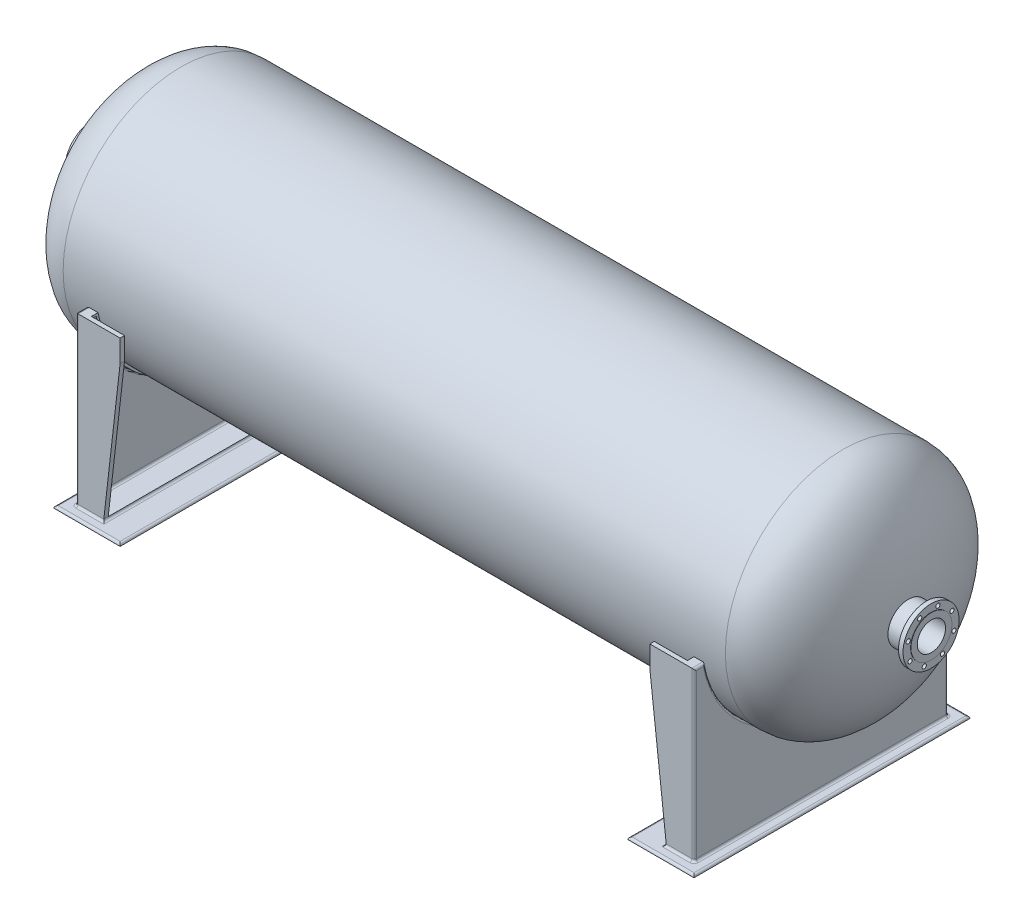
ISO-10303-21;
HEADER;
FILE_DESCRIPTION(('STEP AP214'),'2;1');
FILE_NAME('part.step','',(''),(''),'','','');
FILE_SCHEMA(('AUTOMOTIVE_DESIGN { 1 0 10303 214 1 1 1 1 }'));
ENDSEC;
DATA;
#1=APPLICATION_CONTEXT('core data for automotive mechanical design processes');
#2=APPLICATION_PROTOCOL_DEFINITION('international standard','automotive_design',2000,#1);
#3=PRODUCT_CONTEXT('',#1,'mechanical');
#4=PRODUCT('Part','Part','',(#3));
#5=PRODUCT_RELATED_PRODUCT_CATEGORY('part','',(#4));
#6=PRODUCT_DEFINITION_FORMATION('','',#4);
#7=PRODUCT_DEFINITION_CONTEXT('part definition',#1,'design');
#8=PRODUCT_DEFINITION('design','',#6,#7);
#9=PRODUCT_DEFINITION_SHAPE('','',#8);
#10=(LENGTH_UNIT() NAMED_UNIT(*) SI_UNIT(.MILLI.,.METRE.));
#11=(NAMED_UNIT(*) PLANE_ANGLE_UNIT() SI_UNIT($,.RADIAN.));
#12=(NAMED_UNIT(*) SI_UNIT($,.STERADIAN.) SOLID_ANGLE_UNIT());
#13=UNCERTAINTY_MEASURE_WITH_UNIT(LENGTH_MEASURE(1.E-05),#10,'distance_accuracy_value','');
#14=(GEOMETRIC_REPRESENTATION_CONTEXT(3) GLOBAL_UNCERTAINTY_ASSIGNED_CONTEXT((#13)) GLOBAL_UNIT_ASSIGNED_CONTEXT((#10,
#11,#12)) REPRESENTATION_CONTEXT('',''));
#15=CARTESIAN_POINT('',(0.,0.,0.));
#16=DIRECTION('',(0.,0.,1.));
#17=DIRECTION('',(1.,0.,0.));
#18=AXIS2_PLACEMENT_3D('',#15,#16,#17);
#19=CARTESIAN_POINT('',(1900.,0.,0.));
#20=DIRECTION('',(1.,0.,0.));
#21=DIRECTION('',(0.,-0.776568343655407,0.630033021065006));
#22=AXIS2_PLACEMENT_3D('',#19,#20,#21);
#23=CYLINDRICAL_SURFACE('',#22,64.0969);
#24=CARTESIAN_POINT('',(1900.,0.,0.));
#25=DIRECTION('',(1.,0.,0.));
#26=DIRECTION('',(0.,-0.776568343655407,0.630033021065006));
#27=AXIS2_PLACEMENT_3D('',#24,#25,#26);
#28=CIRCLE('',#27,64.0969);
#29=CARTESIAN_POINT('',(1900.,-49.7756234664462,40.3831635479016));
#30=VERTEX_POINT('',#29);
#31=EDGE_CURVE('E1301',#30,#30,#28,.T.);
#32=ORIENTED_EDGE('',*,*,#31,.T.);
#33=EDGE_LOOP('',(#32));
#34=FACE_BOUND('',#33,.T.);
#35=CARTESIAN_POINT('',(1797.63128214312,-8.49536126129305E-13,0.));
#36=DIRECTION('',(1.,0.,0.));
#37=DIRECTION('',(0.,1.,0.));
#38=AXIS2_PLACEMENT_3D('',#35,#36,#37);
#39=CIRCLE('',#38,64.0969000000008);
#40=CARTESIAN_POINT('',(1797.63128214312,64.0969,0.));
#41=VERTEX_POINT('',#40);
#42=EDGE_CURVE('E1255',#41,#41,#39,.F.);
#43=ORIENTED_EDGE('',*,*,#42,.T.);
#44=EDGE_LOOP('',(#43));
#45=FACE_BOUND('',#44,.T.);
#46=ADVANCED_FACE('F37',(#34,#45),#23,.F.);
#47=CARTESIAN_POINT('',(1900.,0.,0.));
#48=DIRECTION('',(1.,0.,0.));
#49=DIRECTION('',(0.,-0.776568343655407,0.630033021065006));
#50=AXIS2_PLACEMENT_3D('',#47,#48,#49);
#51=CYLINDRICAL_SURFACE('',#50,92.075);
#52=CARTESIAN_POINT('',(1871.425,0.,0.));
#53=DIRECTION('',(-1.,0.,0.));
#54=DIRECTION('',(0.,0.776568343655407,-0.630033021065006));
#55=AXIS2_PLACEMENT_3D('',#52,#53,#54);
#56=CIRCLE('',#55,92.075);
#57=CARTESIAN_POINT('',(1871.425,71.5025302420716,-58.0102904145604));
#58=VERTEX_POINT('',#57);
#59=EDGE_CURVE('E11',#58,#58,#56,.T.);
#60=ORIENTED_EDGE('',*,*,#59,.T.);
#61=EDGE_LOOP('',(#60));
#62=FACE_BOUND('',#61,.T.);
#63=CARTESIAN_POINT('',(1795.13086704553,-8.48523463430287E-13,0.));
#64=DIRECTION('',(1.,0.,0.));
#65=DIRECTION('',(0.,1.,0.));
#66=AXIS2_PLACEMENT_3D('',#63,#64,#65);
#67=CIRCLE('',#66,92.0750000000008);
#68=CARTESIAN_POINT('',(1795.13086704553,92.075,0.));
#69=VERTEX_POINT('',#68);
#70=EDGE_CURVE('E41',#69,#69,#67,.T.);
#71=ORIENTED_EDGE('',*,*,#70,.T.);
#72=EDGE_LOOP('',(#71));
#73=FACE_BOUND('',#72,.T.);
#74=ADVANCED_FACE('F510',(#62,#73),#51,.T.);
#75=CARTESIAN_POINT('',(1877.775,-80.0141936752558,-98.6241796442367));
#76=DIRECTION('',(-1.,0.,0.));
#77=DIRECTION('',(0.,0.776568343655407,-0.630033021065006));
#78=AXIS2_PLACEMENT_3D('',#75,#76,#77);
#79=PLANE('',#78);
#80=CARTESIAN_POINT('',(1877.775,-103.476422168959,30.7543908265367));
#81=DIRECTION('',(-1.,0.,0.));
#82=DIRECTION('',(0.,0.103616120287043,-0.994617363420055));
#83=AXIS2_PLACEMENT_3D('',#80,#81,#82);
#84=CIRCLE('',#83,9.525);
#85=CARTESIAN_POINT('',(1877.775,-94.3461496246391,28.0407681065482));
#86=VERTEX_POINT('',#85);
#87=EDGE_CURVE('E1199',#86,#86,#84,.F.);
#88=ORIENTED_EDGE('',*,*,#87,.T.);
#89=CARTESIAN_POINT('',(1877.775,0.,0.));
#90=DIRECTION('',(-1.,0.,0.));
#91=DIRECTION('',(0.,0.776568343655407,-0.630033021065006));
#92=AXIS2_PLACEMENT_3D('',#89,#90,#91);
#93=CIRCLE('',#92,98.425);
#94=CARTESIAN_POINT('',(1877.775,-86.5406194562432,-46.8849849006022));
#95=VERTEX_POINT('',#94);
#96=EDGE_CURVE('E47',#86,#95,#93,.F.);
#97=ORIENTED_EDGE('',*,*,#96,.T.);
#98=CARTESIAN_POINT('',(1877.775,-94.915518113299,-51.4222415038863));
#99=DIRECTION('',(-1.,0.,0.));
#100=DIRECTION('',(0.,0.776568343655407,-0.630033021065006));
#101=AXIS2_PLACEMENT_3D('',#98,#99,#100);
#102=CIRCLE('',#101,9.525);
#103=EDGE_CURVE('E1297',#95,#95,#102,.F.);
#104=ORIENTED_EDGE('',*,*,#103,.T.);
#105=CARTESIAN_POINT('',(1877.775,0.,0.));
#106=DIRECTION('',(-1.,0.,0.));
#107=DIRECTION('',(0.,0.776568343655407,-0.630033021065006));
#108=AXIS2_PLACEMENT_3D('',#105,#106,#107);
#109=CIRCLE('',#108,98.425);
#110=CARTESIAN_POINT('',(1877.775,-28.0407681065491,-94.3461496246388));
#111=VERTEX_POINT('',#110);
#112=EDGE_CURVE('E55',#95,#111,#109,.F.);
#113=ORIENTED_EDGE('',*,*,#112,.T.);
#114=CARTESIAN_POINT('',(1877.775,-30.7543908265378,-103.476422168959));
#115=DIRECTION('',(-1.,0.,0.));
#116=DIRECTION('',(0.,0.994617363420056,0.103616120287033));
#117=AXIS2_PLACEMENT_3D('',#114,#115,#116);
#118=CIRCLE('',#117,9.525);
#119=EDGE_CURVE('E1292',#111,#111,#118,.F.);
#120=ORIENTED_EDGE('',*,*,#119,.T.);
#121=CARTESIAN_POINT('',(1877.775,0.,0.));
#122=DIRECTION('',(-1.,0.,0.));
#123=DIRECTION('',(0.,0.776568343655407,-0.630033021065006));
#124=AXIS2_PLACEMENT_3D('',#121,#122,#123);
#125=CIRCLE('',#124,98.425);
#126=CARTESIAN_POINT('',(1877.775,46.8849849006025,-86.540619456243));
#127=VERTEX_POINT('',#126);
#128=EDGE_CURVE('E1226',#111,#127,#125,.F.);
#129=ORIENTED_EDGE('',*,*,#128,.T.);
#130=CARTESIAN_POINT('',(1877.775,51.4222415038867,-94.9155181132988));
#131=DIRECTION('',(-1.,0.,0.));
#132=DIRECTION('',(0.,0.630033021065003,0.776568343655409));
#133=AXIS2_PLACEMENT_3D('',#130,#131,#132);
#134=CIRCLE('',#133,9.525);
#135=EDGE_CURVE('E1286',#127,#127,#134,.F.);
#136=ORIENTED_EDGE('',*,*,#135,.T.);
#137=CARTESIAN_POINT('',(1877.775,0.,0.));
#138=DIRECTION('',(-1.,0.,0.));
#139=DIRECTION('',(0.,0.776568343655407,-0.630033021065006));
#140=AXIS2_PLACEMENT_3D('',#137,#138,#139);
#141=CIRCLE('',#140,98.425);
#142=CARTESIAN_POINT('',(1877.775,94.3461496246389,-28.0407681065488));
#143=VERTEX_POINT('',#142);
#144=EDGE_CURVE('E1224',#127,#143,#141,.F.);
#145=ORIENTED_EDGE('',*,*,#144,.T.);
#146=CARTESIAN_POINT('',(1877.775,103.476422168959,-30.7543908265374));
#147=DIRECTION('',(-1.,0.,0.));
#148=DIRECTION('',(0.,-0.103616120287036,0.994617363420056));
#149=AXIS2_PLACEMENT_3D('',#146,#147,#148);
#150=CIRCLE('',#149,9.525);
#151=EDGE_CURVE('E1280',#143,#143,#150,.F.);
#152=ORIENTED_EDGE('',*,*,#151,.T.);
#153=CARTESIAN_POINT('',(1877.775,0.,0.));
#154=DIRECTION('',(-1.,0.,0.));
#155=DIRECTION('',(0.,0.776568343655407,-0.630033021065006));
#156=AXIS2_PLACEMENT_3D('',#153,#154,#155);
#157=CIRCLE('',#156,98.425);
#158=CARTESIAN_POINT('',(1877.775,86.5406194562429,46.8849849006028));
#159=VERTEX_POINT('',#158);
#160=EDGE_CURVE('E1222',#143,#159,#157,.F.);
#161=ORIENTED_EDGE('',*,*,#160,.T.);
#162=CARTESIAN_POINT('',(1877.775,94.9155181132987,51.422241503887));
#163=DIRECTION('',(-1.,0.,0.));
#164=DIRECTION('',(0.,-0.776568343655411,0.630033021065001));
#165=AXIS2_PLACEMENT_3D('',#162,#163,#164);
#166=CIRCLE('',#165,9.525);
#167=EDGE_CURVE('E1274',#159,#159,#166,.F.);
#168=ORIENTED_EDGE('',*,*,#167,.T.);
#169=CARTESIAN_POINT('',(1877.775,0.,0.));
#170=DIRECTION('',(-1.,0.,0.));
#171=DIRECTION('',(0.,0.776568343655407,-0.630033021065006));
#172=AXIS2_PLACEMENT_3D('',#169,#170,#171);
#173=CIRCLE('',#172,98.425);
#174=CARTESIAN_POINT('',(1877.775,28.0407681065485,94.346149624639));
#175=VERTEX_POINT('',#174);
#176=EDGE_CURVE('E1220',#159,#175,#173,.F.);
#177=ORIENTED_EDGE('',*,*,#176,.T.);
#178=CARTESIAN_POINT('',(1877.775,30.7543908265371,103.476422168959));
#179=DIRECTION('',(-1.,0.,0.));
#180=DIRECTION('',(0.,-0.994617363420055,-0.103616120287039));
#181=AXIS2_PLACEMENT_3D('',#178,#179,#180);
#182=CIRCLE('',#181,9.525);
#183=EDGE_CURVE('E1268',#175,#175,#182,.F.);
#184=ORIENTED_EDGE('',*,*,#183,.T.);
#185=CARTESIAN_POINT('',(1877.775,0.,0.));
#186=DIRECTION('',(-1.,0.,0.));
#187=DIRECTION('',(0.,0.776568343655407,-0.630033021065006));
#188=AXIS2_PLACEMENT_3D('',#185,#186,#187);
#189=CIRCLE('',#188,98.425);
#190=CARTESIAN_POINT('',(1877.775,-46.8849849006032,86.5406194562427));
#191=VERTEX_POINT('',#190);
#192=EDGE_CURVE('E1218',#175,#191,#189,.F.);
#193=ORIENTED_EDGE('',*,*,#192,.T.);
#194=CARTESIAN_POINT('',(1877.775,-51.4222415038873,94.9155181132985));
#195=DIRECTION('',(-1.,0.,0.));
#196=DIRECTION('',(0.,-0.630033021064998,-0.776568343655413));
#197=AXIS2_PLACEMENT_3D('',#194,#195,#196);
#198=CIRCLE('',#197,9.525);
#199=EDGE_CURVE('E1262',#191,#191,#198,.F.);
#200=ORIENTED_EDGE('',*,*,#199,.T.);
#201=CARTESIAN_POINT('',(1877.775,0.,0.));
#202=DIRECTION('',(-1.,0.,0.));
#203=DIRECTION('',(0.,0.776568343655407,-0.630033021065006));
#204=AXIS2_PLACEMENT_3D('',#201,#202,#203);
#205=CIRCLE('',#204,98.425);
#206=EDGE_CURVE('E1216',#191,#86,#205,.F.);
#207=ORIENTED_EDGE('',*,*,#206,.T.);
#208=EDGE_LOOP('',(#88,#97,#104,#113,#120,#129,#136,#145,#152,#161,#168,#177,#184,#193,#200,#207));
#209=FACE_BOUND('',#208,.T.);
#210=CARTESIAN_POINT('',(1877.775,0.,0.));
#211=DIRECTION('',(1.,0.,0.));
#212=DIRECTION('',(0.,-0.776568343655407,0.630033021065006));
#213=AXIS2_PLACEMENT_3D('',#210,#211,#212);
#214=CIRCLE('',#213,127.);
#215=CARTESIAN_POINT('',(1877.775,-98.6241796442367,80.0141936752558));
#216=VERTEX_POINT('',#215);
#217=EDGE_CURVE('E1202',#216,#216,#214,.T.);
#218=ORIENTED_EDGE('',*,*,#217,.F.);
#219=EDGE_LOOP('',(#218));
#220=FACE_BOUND('',#219,.T.);
#221=ADVANCED_FACE('F516',(#209,#220),#79,.T.);
#222=CARTESIAN_POINT('',(1900.,0.,0.));
#223=DIRECTION('',(1.,0.,0.));
#224=DIRECTION('',(0.,-0.776568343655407,0.630033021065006));
#225=AXIS2_PLACEMENT_3D('',#222,#223,#224);
#226=CYLINDRICAL_SURFACE('',#225,127.);
#227=ORIENTED_EDGE('',*,*,#217,.T.);
#228=EDGE_LOOP('',(#227));
#229=FACE_BOUND('',#228,.T.);
#230=CARTESIAN_POINT('',(1898.4125,0.,0.));
#231=DIRECTION('',(1.,0.,0.));
#232=DIRECTION('',(0.,-0.776568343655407,0.630033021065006));
#233=AXIS2_PLACEMENT_3D('',#230,#231,#232);
#234=CIRCLE('',#233,127.);
#235=CARTESIAN_POINT('',(1898.4125,-98.6241796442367,80.0141936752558));
#236=VERTEX_POINT('',#235);
#237=EDGE_CURVE('E1204',#236,#236,#234,.T.);
#238=ORIENTED_EDGE('',*,*,#237,.F.);
#239=EDGE_LOOP('',(#238));
#240=FACE_BOUND('',#239,.T.);
#241=ADVANCED_FACE('F1188',(#229,#240),#226,.T.);
#242=CARTESIAN_POINT('',(1898.4125,-58.5103791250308,-72.1189313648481));
#243=DIRECTION('',(1.,0.,0.));
#244=DIRECTION('',(0.,-0.776568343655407,0.630033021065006));
#245=AXIS2_PLACEMENT_3D('',#242,#243,#244);
#246=PLANE('',#245);
#247=CARTESIAN_POINT('',(1898.4125,-103.476422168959,30.7543908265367));
#248=DIRECTION('',(1.,0.,0.));
#249=DIRECTION('',(0.,-0.103616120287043,0.994617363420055));
#250=AXIS2_PLACEMENT_3D('',#247,#248,#249);
#251=CIRCLE('',#250,9.525);
#252=CARTESIAN_POINT('',(1898.4125,-104.463365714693,40.2281212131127));
#253=VERTEX_POINT('',#252);
#254=EDGE_CURVE('E1259',#253,#253,#251,.T.);
#255=ORIENTED_EDGE('',*,*,#254,.F.);
#256=EDGE_LOOP('',(#255));
#257=FACE_BOUND('',#256,.T.);
#258=CARTESIAN_POINT('',(1898.4125,-51.4222415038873,94.9155181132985));
#259=DIRECTION('',(1.,0.,0.));
#260=DIRECTION('',(0.,0.630033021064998,0.776568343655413));
#261=AXIS2_PLACEMENT_3D('',#258,#259,#260);
#262=CIRCLE('',#261,9.525);
#263=CARTESIAN_POINT('',(1898.4125,-45.4211769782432,102.312331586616));
#264=VERTEX_POINT('',#263);
#265=EDGE_CURVE('E1265',#264,#264,#262,.T.);
#266=ORIENTED_EDGE('',*,*,#265,.F.);
#267=EDGE_LOOP('',(#266));
#268=FACE_BOUND('',#267,.T.);
#269=CARTESIAN_POINT('',(1898.4125,30.7543908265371,103.476422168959));
#270=DIRECTION('',(1.,0.,0.));
#271=DIRECTION('',(0.,0.994617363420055,0.103616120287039));
#272=AXIS2_PLACEMENT_3D('',#269,#270,#271);
#273=CIRCLE('',#272,9.525);
#274=CARTESIAN_POINT('',(1898.4125,40.2281212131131,104.463365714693));
#275=VERTEX_POINT('',#274);
#276=EDGE_CURVE('E1271',#275,#275,#273,.T.);
#277=ORIENTED_EDGE('',*,*,#276,.F.);
#278=EDGE_LOOP('',(#277));
#279=FACE_BOUND('',#278,.T.);
#280=CARTESIAN_POINT('',(1898.4125,94.9155181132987,51.422241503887));
#281=DIRECTION('',(1.,0.,0.));
#282=DIRECTION('',(0.,0.776568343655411,-0.630033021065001));
#283=AXIS2_PLACEMENT_3D('',#280,#281,#282);
#284=CIRCLE('',#283,9.525);
#285=CARTESIAN_POINT('',(1898.4125,102.312331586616,45.4211769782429));
#286=VERTEX_POINT('',#285);
#287=EDGE_CURVE('E1277',#286,#286,#284,.T.);
#288=ORIENTED_EDGE('',*,*,#287,.F.);
#289=EDGE_LOOP('',(#288));
#290=FACE_BOUND('',#289,.T.);
#291=CARTESIAN_POINT('',(1898.4125,103.476422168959,-30.7543908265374));
#292=DIRECTION('',(1.,0.,0.));
#293=DIRECTION('',(0.,0.103616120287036,-0.994617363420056));
#294=AXIS2_PLACEMENT_3D('',#291,#292,#293);
#295=CIRCLE('',#294,9.525);
#296=CARTESIAN_POINT('',(1898.4125,104.463365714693,-40.2281212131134));
#297=VERTEX_POINT('',#296);
#298=EDGE_CURVE('E1283',#297,#297,#295,.T.);
#299=ORIENTED_EDGE('',*,*,#298,.F.);
#300=EDGE_LOOP('',(#299));
#301=FACE_BOUND('',#300,.T.);
#302=CARTESIAN_POINT('',(1898.4125,51.4222415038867,-94.9155181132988));
#303=DIRECTION('',(1.,0.,0.));
#304=DIRECTION('',(0.,-0.630033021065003,-0.776568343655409));
#305=AXIS2_PLACEMENT_3D('',#302,#303,#304);
#306=CIRCLE('',#305,9.525);
#307=CARTESIAN_POINT('',(1898.4125,45.4211769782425,-102.312331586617));
#308=VERTEX_POINT('',#307);
#309=EDGE_CURVE('E1289',#308,#308,#306,.T.);
#310=ORIENTED_EDGE('',*,*,#309,.F.);
#311=EDGE_LOOP('',(#310));
#312=FACE_BOUND('',#311,.T.);
#313=CARTESIAN_POINT('',(1898.4125,-30.7543908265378,-103.476422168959));
#314=DIRECTION('',(1.,0.,0.));
#315=DIRECTION('',(0.,-0.994617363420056,-0.103616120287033));
#316=AXIS2_PLACEMENT_3D('',#313,#314,#315);
#317=CIRCLE('',#316,9.525);
#318=CARTESIAN_POINT('',(1898.4125,-40.2281212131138,-104.463365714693));
#319=VERTEX_POINT('',#318);
#320=EDGE_CURVE('E1294',#319,#319,#317,.T.);
#321=ORIENTED_EDGE('',*,*,#320,.F.);
#322=EDGE_LOOP('',(#321));
#323=FACE_BOUND('',#322,.T.);
#324=CARTESIAN_POINT('',(1898.4125,-94.915518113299,-51.4222415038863));
#325=DIRECTION('',(1.,0.,0.));
#326=DIRECTION('',(0.,-0.776568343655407,0.630033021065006));
#327=AXIS2_PLACEMENT_3D('',#324,#325,#326);
#328=CIRCLE('',#327,9.525);
#329=CARTESIAN_POINT('',(1898.4125,-102.312331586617,-45.4211769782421));
#330=VERTEX_POINT('',#329);
#331=EDGE_CURVE('E1298',#330,#330,#328,.T.);
#332=ORIENTED_EDGE('',*,*,#331,.F.);
#333=EDGE_LOOP('',(#332));
#334=FACE_BOUND('',#333,.T.);
#335=ORIENTED_EDGE('',*,*,#237,.T.);
#336=EDGE_LOOP('',(#335));
#337=FACE_BOUND('',#336,.T.);
#338=CARTESIAN_POINT('',(1898.4125,0.,0.));
#339=DIRECTION('',(1.,0.,0.));
#340=DIRECTION('',(0.,-0.776568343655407,0.630033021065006));
#341=AXIS2_PLACEMENT_3D('',#338,#339,#340);
#342=CIRCLE('',#341,92.86875);
#343=CARTESIAN_POINT('',(1898.4125,-72.1189313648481,58.5103791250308));
#344=VERTEX_POINT('',#343);
#345=EDGE_CURVE('E1210',#344,#344,#342,.T.);
#346=ORIENTED_EDGE('',*,*,#345,.F.);
#347=EDGE_LOOP('',(#346));
#348=FACE_BOUND('',#347,.T.);
#349=ADVANCED_FACE('F1184',(#257,#268,#279,#290,#301,#312,#323,#334,#337,#348),#246,.T.);
#350=CARTESIAN_POINT('',(1900.,0.,0.));
#351=DIRECTION('',(1.,0.,0.));
#352=DIRECTION('',(0.,-0.776568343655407,0.630033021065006));
#353=AXIS2_PLACEMENT_3D('',#350,#351,#352);
#354=CYLINDRICAL_SURFACE('',#353,92.86875);
#355=ORIENTED_EDGE('',*,*,#345,.T.);
#356=EDGE_LOOP('',(#355));
#357=FACE_BOUND('',#356,.T.);
#358=CARTESIAN_POINT('',(1900.,0.,0.));
#359=DIRECTION('',(1.,0.,0.));
#360=DIRECTION('',(0.,-0.776568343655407,0.630033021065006));
#361=AXIS2_PLACEMENT_3D('',#358,#359,#360);
#362=CIRCLE('',#361,92.86875);
#363=CARTESIAN_POINT('',(1900.,-72.1189313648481,58.5103791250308));
#364=VERTEX_POINT('',#363);
#365=EDGE_CURVE('E1304',#364,#364,#362,.T.);
#366=ORIENTED_EDGE('',*,*,#365,.F.);
#367=EDGE_LOOP('',(#366));
#368=FACE_BOUND('',#367,.T.);
#369=ADVANCED_FACE('F1180',(#357,#368),#354,.T.);
#370=CARTESIAN_POINT('',(1900.,-40.3831635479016,-49.7756234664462));
#371=DIRECTION('',(1.,0.,0.));
#372=DIRECTION('',(0.,-0.776568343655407,0.630033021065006));
#373=AXIS2_PLACEMENT_3D('',#370,#371,#372);
#374=PLANE('',#373);
#375=ORIENTED_EDGE('',*,*,#365,.T.);
#376=EDGE_LOOP('',(#375));
#377=FACE_BOUND('',#376,.T.);
#378=ORIENTED_EDGE('',*,*,#31,.F.);
#379=EDGE_LOOP('',(#378));
#380=FACE_BOUND('',#379,.T.);
#381=ADVANCED_FACE('F1176',(#377,#380),#374,.T.);
#382=CARTESIAN_POINT('',(1671.399,-94.915518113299,-51.4222415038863));
#383=DIRECTION('',(1.,0.,0.));
#384=DIRECTION('',(0.,-0.776568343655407,0.630033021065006));
#385=AXIS2_PLACEMENT_3D('',#382,#383,#384);
#386=CYLINDRICAL_SURFACE('',#385,9.525);
#387=ORIENTED_EDGE('',*,*,#103,.F.);
#388=EDGE_LOOP('',(#387));
#389=FACE_BOUND('',#388,.T.);
#390=ORIENTED_EDGE('',*,*,#331,.T.);
#391=EDGE_LOOP('',(#390));
#392=FACE_BOUND('',#391,.T.);
#393=ADVANCED_FACE('F1172',(#389,#392),#386,.F.);
#394=CARTESIAN_POINT('',(1671.399,-30.7543908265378,-103.476422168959));
#395=DIRECTION('',(1.,0.,0.));
#396=DIRECTION('',(0.,-0.994617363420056,-0.103616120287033));
#397=AXIS2_PLACEMENT_3D('',#394,#395,#396);
#398=CYLINDRICAL_SURFACE('',#397,9.525);
#399=ORIENTED_EDGE('',*,*,#119,.F.);
#400=EDGE_LOOP('',(#399));
#401=FACE_BOUND('',#400,.T.);
#402=ORIENTED_EDGE('',*,*,#320,.T.);
#403=EDGE_LOOP('',(#402));
#404=FACE_BOUND('',#403,.T.);
#405=ADVANCED_FACE('F1168',(#401,#404),#398,.F.);
#406=CARTESIAN_POINT('',(1671.399,51.4222415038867,-94.9155181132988));
#407=DIRECTION('',(1.,0.,0.));
#408=DIRECTION('',(0.,-0.630033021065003,-0.776568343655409));
#409=AXIS2_PLACEMENT_3D('',#406,#407,#408);
#410=CYLINDRICAL_SURFACE('',#409,9.525);
#411=ORIENTED_EDGE('',*,*,#135,.F.);
#412=EDGE_LOOP('',(#411));
#413=FACE_BOUND('',#412,.T.);
#414=ORIENTED_EDGE('',*,*,#309,.T.);
#415=EDGE_LOOP('',(#414));
#416=FACE_BOUND('',#415,.T.);
#417=ADVANCED_FACE('F1164',(#413,#416),#410,.F.);
#418=CARTESIAN_POINT('',(1671.399,103.476422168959,-30.7543908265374));
#419=DIRECTION('',(1.,0.,0.));
#420=DIRECTION('',(0.,0.103616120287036,-0.994617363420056));
#421=AXIS2_PLACEMENT_3D('',#418,#419,#420);
#422=CYLINDRICAL_SURFACE('',#421,9.525);
#423=ORIENTED_EDGE('',*,*,#151,.F.);
#424=EDGE_LOOP('',(#423));
#425=FACE_BOUND('',#424,.T.);
#426=ORIENTED_EDGE('',*,*,#298,.T.);
#427=EDGE_LOOP('',(#426));
#428=FACE_BOUND('',#427,.T.);
#429=ADVANCED_FACE('F1160',(#425,#428),#422,.F.);
#430=CARTESIAN_POINT('',(1671.399,94.9155181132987,51.422241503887));
#431=DIRECTION('',(1.,0.,0.));
#432=DIRECTION('',(0.,0.776568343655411,-0.630033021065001));
#433=AXIS2_PLACEMENT_3D('',#430,#431,#432);
#434=CYLINDRICAL_SURFACE('',#433,9.525);
#435=ORIENTED_EDGE('',*,*,#167,.F.);
#436=EDGE_LOOP('',(#435));
#437=FACE_BOUND('',#436,.T.);
#438=ORIENTED_EDGE('',*,*,#287,.T.);
#439=EDGE_LOOP('',(#438));
#440=FACE_BOUND('',#439,.T.);
#441=ADVANCED_FACE('F1156',(#437,#440),#434,.F.);
#442=CARTESIAN_POINT('',(1671.399,30.7543908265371,103.476422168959));
#443=DIRECTION('',(1.,0.,0.));
#444=DIRECTION('',(0.,0.994617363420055,0.103616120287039));
#445=AXIS2_PLACEMENT_3D('',#442,#443,#444);
#446=CYLINDRICAL_SURFACE('',#445,9.525);
#447=ORIENTED_EDGE('',*,*,#183,.F.);
#448=EDGE_LOOP('',(#447));
#449=FACE_BOUND('',#448,.T.);
#450=ORIENTED_EDGE('',*,*,#276,.T.);
#451=EDGE_LOOP('',(#450));
#452=FACE_BOUND('',#451,.T.);
#453=ADVANCED_FACE('F1152',(#449,#452),#446,.F.);
#454=CARTESIAN_POINT('',(1671.399,-51.4222415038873,94.9155181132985));
#455=DIRECTION('',(1.,0.,0.));
#456=DIRECTION('',(0.,0.630033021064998,0.776568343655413));
#457=AXIS2_PLACEMENT_3D('',#454,#455,#456);
#458=CYLINDRICAL_SURFACE('',#457,9.525);
#459=ORIENTED_EDGE('',*,*,#199,.F.);
#460=EDGE_LOOP('',(#459));
#461=FACE_BOUND('',#460,.T.);
#462=ORIENTED_EDGE('',*,*,#265,.T.);
#463=EDGE_LOOP('',(#462));
#464=FACE_BOUND('',#463,.T.);
#465=ADVANCED_FACE('F1148',(#461,#464),#458,.F.);
#466=CARTESIAN_POINT('',(1671.399,-103.476422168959,30.7543908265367));
#467=DIRECTION('',(1.,0.,0.));
#468=DIRECTION('',(0.,-0.103616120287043,0.994617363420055));
#469=AXIS2_PLACEMENT_3D('',#466,#467,#468);
#470=CYLINDRICAL_SURFACE('',#469,9.525);
#471=ORIENTED_EDGE('',*,*,#87,.F.);
#472=EDGE_LOOP('',(#471));
#473=FACE_BOUND('',#472,.T.);
#474=ORIENTED_EDGE('',*,*,#254,.T.);
#475=EDGE_LOOP('',(#474));
#476=FACE_BOUND('',#475,.T.);
#477=ADVANCED_FACE('F1145',(#473,#476),#470,.F.);
#478=CARTESIAN_POINT('',(1871.425,0.,0.));
#479=DIRECTION('',(-1.,0.,0.));
#480=DIRECTION('',(0.,0.776568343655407,-0.630033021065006));
#481=AXIS2_PLACEMENT_3D('',#478,#479,#480);
#482=TOROIDAL_SURFACE('',#481,98.425,6.35);
#483=ORIENTED_EDGE('',*,*,#59,.F.);
#484=EDGE_LOOP('',(#483));
#485=FACE_BOUND('',#484,.T.);
#486=ORIENTED_EDGE('',*,*,#112,.F.);
#487=ORIENTED_EDGE('',*,*,#96,.F.);
#488=ORIENTED_EDGE('',*,*,#206,.F.);
#489=ORIENTED_EDGE('',*,*,#192,.F.);
#490=ORIENTED_EDGE('',*,*,#176,.F.);
#491=ORIENTED_EDGE('',*,*,#160,.F.);
#492=ORIENTED_EDGE('',*,*,#144,.F.);
#493=ORIENTED_EDGE('',*,*,#128,.F.);
#494=EDGE_LOOP('',(#486,#487,#488,#489,#490,#491,#492,#493));
#495=FACE_BOUND('',#494,.T.);
#496=ADVANCED_FACE('F39',(#485,#495),#482,.F.);
#497=CARTESIAN_POINT('',(-1500.,533.4,0.));
#498=CARTESIAN_POINT('',(-1679.98017704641,533.4,0.));
#499=CARTESIAN_POINT('',(-1800.,261.377129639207,0.));
#500=CARTESIAN_POINT('',(-1800.,-8.50495451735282E-13,0.));
#501=B_SPLINE_CURVE_WITH_KNOTS('',3,(#497,#498,#499,#500),.UNSPECIFIED.,.F.,.F.,(4,4),(0.,1.),.UNSPECIFIED.);
#502=CARTESIAN_POINT('',(-1800.,-8.50495451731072E-13,0.));
#503=DIRECTION('',(-1.,0.,0.));
#504=AXIS1_PLACEMENT('',#502,#503);
#505=SURFACE_OF_REVOLUTION('',#501,#504);
#506=CARTESIAN_POINT('',(-1797.63128214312,-8.49536126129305E-13,0.));
#507=DIRECTION('',(-1.,0.,0.));
#508=DIRECTION('',(0.,-1.,0.));
#509=AXIS2_PLACEMENT_3D('',#506,#507,#508);
#510=CIRCLE('',#509,64.0969000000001);
#511=CARTESIAN_POINT('',(-1797.63128214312,-64.096900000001,0.));
#512=VERTEX_POINT('',#511);
#513=EDGE_CURVE('E1253',#512,#512,#510,.F.);
#514=ORIENTED_EDGE('',*,*,#513,.F.);
#515=EDGE_LOOP('',(#514));
#516=FACE_BOUND('',#515,.T.);
#517=CARTESIAN_POINT('',(-1800.,-8.50495451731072E-13,0.));
#518=VERTEX_POINT('',#517);
#519=VERTEX_LOOP('',#518);
#520=FACE_BOUND('',#519,.T.);
#521=ADVANCED_FACE('F1350',(#516,#520),#505,.T.);
#522=CARTESIAN_POINT('',(-1311.89336745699,-1173.37088818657,-625.296455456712));
#523=DIRECTION('',(-0.99355459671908,0.113354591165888,0.));
#524=DIRECTION('',(-0.113354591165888,-0.99355459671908,0.));
#525=AXIS2_PLACEMENT_3D('',#522,#523,#524);
#526=PLANE('',#525);
#527=DIRECTION('',(0.113354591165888,0.99355459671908,0.));
#528=VECTOR('',#527,1.);
#529=CARTESIAN_POINT('',(-1196.1343016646,-158.741037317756,575.296455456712));
#530=LINE('',#529,#528);
#531=CARTESIAN_POINT('',(-1273.72977433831,-838.866454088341,575.296455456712));
#532=VERTEX_POINT('',#531);
#533=CARTESIAN_POINT('',(-1200.,-192.623937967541,575.296455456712));
#534=VERTEX_POINT('',#533);
#535=EDGE_CURVE('E2422',#532,#534,#530,.T.);
#536=ORIENTED_EDGE('',*,*,#535,.F.);
#537=DIRECTION('',(0.,0.,1.));
#538=VECTOR('',#537,1.);
#539=CARTESIAN_POINT('',(-1273.72977433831,-838.866454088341,-575.296455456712));
#540=LINE('',#539,#538);
#541=CARTESIAN_POINT('',(-1273.72977433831,-838.866454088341,555.296455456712));
#542=VERTEX_POINT('',#541);
#543=EDGE_CURVE('E2510',#532,#542,#540,.F.);
#544=ORIENTED_EDGE('',*,*,#543,.T.);
#545=DIRECTION('',(0.113354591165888,0.99355459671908,0.));
#546=VECTOR('',#545,1.);
#547=CARTESIAN_POINT('',(-1196.1343016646,-158.741037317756,555.296455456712));
#548=LINE('',#547,#546);
#549=CARTESIAN_POINT('',(-1200.,-192.623937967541,555.296455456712));
#550=VERTEX_POINT('',#549);
#551=EDGE_CURVE('E2396',#542,#550,#548,.T.);
#552=ORIENTED_EDGE('',*,*,#551,.T.);
#553=DIRECTION('',(0.,0.,1.));
#554=VECTOR('',#553,1.);
#555=CARTESIAN_POINT('',(-1200.,-192.623937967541,-625.296455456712));
#556=LINE('',#555,#554);
#557=EDGE_CURVE('E2415',#550,#534,#556,.T.);
#558=ORIENTED_EDGE('',*,*,#557,.T.);
#559=EDGE_LOOP('',(#536,#544,#552,#558));
#560=FACE_BOUND('',#559,.T.);
#561=ADVANCED_FACE('F928',(#560),#526,.F.);
#562=CARTESIAN_POINT('',(-1200.,-92.6239379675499,-1399.70709041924));
#563=DIRECTION('',(0.,-1.,0.));
#564=DIRECTION('',(0.,0.,-1.));
#565=AXIS2_PLACEMENT_3D('',#562,#563,#564);
#566=PLANE('',#565);
#567=DIRECTION('',(-1.,0.,0.));
#568=VECTOR('',#567,1.);
#569=CARTESIAN_POINT('',(-1200.,-92.6239379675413,525.296455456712));
#570=LINE('',#569,#568);
#571=CARTESIAN_POINT('',(-1350.,-92.6239379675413,525.296455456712));
#572=VERTEX_POINT('',#571);
#573=CARTESIAN_POINT('',(-1390.,-92.6239379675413,525.296455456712));
#574=VERTEX_POINT('',#573);
#575=EDGE_CURVE('E2452',#572,#574,#570,.T.);
#576=ORIENTED_EDGE('',*,*,#575,.T.);
#577=DIRECTION('',(0.,0.,1.));
#578=VECTOR('',#577,1.);
#579=CARTESIAN_POINT('',(-1390.,-92.6239379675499,-1399.70709041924));
#580=LINE('',#579,#578);
#581=CARTESIAN_POINT('',(-1390.,-92.6239379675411,575.296455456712));
#582=VERTEX_POINT('',#581);
#583=EDGE_CURVE('E2455',#574,#582,#580,.T.);
#584=ORIENTED_EDGE('',*,*,#583,.T.);
#585=DIRECTION('',(-1.,0.,0.));
#586=VECTOR('',#585,1.);
#587=CARTESIAN_POINT('',(-1200.,-92.6239379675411,575.296455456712));
#588=LINE('',#587,#586);
#589=CARTESIAN_POINT('',(-1200.,-92.6239379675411,575.296455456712));
#590=VERTEX_POINT('',#589);
#591=EDGE_CURVE('E2449',#590,#582,#588,.T.);
#592=ORIENTED_EDGE('',*,*,#591,.F.);
#593=DIRECTION('',(0.,0.,1.));
#594=VECTOR('',#593,1.);
#595=CARTESIAN_POINT('',(-1200.,-92.6239379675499,-1399.70709041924));
#596=LINE('',#595,#594);
#597=CARTESIAN_POINT('',(-1200.,-92.6239379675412,555.296455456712));
#598=VERTEX_POINT('',#597);
#599=EDGE_CURVE('E2433',#598,#590,#596,.T.);
#600=ORIENTED_EDGE('',*,*,#599,.F.);
#601=DIRECTION('',(-1.,0.,0.));
#602=VECTOR('',#601,1.);
#603=CARTESIAN_POINT('',(-1200.,-92.6239379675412,555.296455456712));
#604=LINE('',#603,#602);
#605=CARTESIAN_POINT('',(-1350.,-92.6239379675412,555.296455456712));
#606=VERTEX_POINT('',#605);
#607=EDGE_CURVE('E2405',#598,#606,#604,.T.);
#608=ORIENTED_EDGE('',*,*,#607,.T.);
#609=DIRECTION('',(0.,0.,1.));
#610=VECTOR('',#609,1.);
#611=CARTESIAN_POINT('',(-1350.,-92.6239379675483,-1041.36785834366));
#612=LINE('',#611,#610);
#613=EDGE_CURVE('E2377',#572,#606,#612,.T.);
#614=ORIENTED_EDGE('',*,*,#613,.F.);
#615=EDGE_LOOP('',(#576,#584,#592,#600,#608,#614));
#616=FACE_BOUND('',#615,.T.);
#617=ADVANCED_FACE('F949',(#616),#566,.F.);
#618=CARTESIAN_POINT('',(-1200.,-92.6239379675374,-1399.70709041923));
#619=DIRECTION('',(0.,-1.,0.));
#620=DIRECTION('',(0.,0.,-1.));
#621=AXIS2_PLACEMENT_3D('',#618,#619,#620);
#622=PLANE('',#621);
#623=DIRECTION('',(-1.,0.,0.));
#624=VECTOR('',#623,1.);
#625=CARTESIAN_POINT('',(-1200.,-92.6239379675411,-575.296455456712));
#626=LINE('',#625,#624);
#627=CARTESIAN_POINT('',(-1200.,-92.6239379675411,-575.296455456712));
#628=VERTEX_POINT('',#627);
#629=CARTESIAN_POINT('',(-1390.,-92.6239379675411,-575.296455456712));
#630=VERTEX_POINT('',#629);
#631=EDGE_CURVE('E2446',#628,#630,#626,.T.);
#632=ORIENTED_EDGE('',*,*,#631,.T.);
#633=DIRECTION('',(0.,0.,1.));
#634=VECTOR('',#633,1.);
#635=CARTESIAN_POINT('',(-1390.,-92.6239379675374,-1399.70709041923));
#636=LINE('',#635,#634);
#637=CARTESIAN_POINT('',(-1390.,-92.6239379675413,-525.296455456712));
#638=VERTEX_POINT('',#637);
#639=EDGE_CURVE('E2479',#630,#638,#636,.T.);
#640=ORIENTED_EDGE('',*,*,#639,.T.);
#641=DIRECTION('',(-1.,0.,0.));
#642=VECTOR('',#641,1.);
#643=CARTESIAN_POINT('',(-1200.,-92.6239379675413,-525.296455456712));
#644=LINE('',#643,#642);
#645=CARTESIAN_POINT('',(-1350.,-92.6239379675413,-525.296455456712));
#646=VERTEX_POINT('',#645);
#647=EDGE_CURVE('E2443',#646,#638,#644,.T.);
#648=ORIENTED_EDGE('',*,*,#647,.F.);
#649=DIRECTION('',(0.,0.,1.));
#650=VECTOR('',#649,1.);
#651=CARTESIAN_POINT('',(-1350.,-92.623937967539,-1041.36785834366));
#652=LINE('',#651,#650);
#653=CARTESIAN_POINT('',(-1350.,-92.6239379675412,-555.296455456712));
#654=VERTEX_POINT('',#653);
#655=EDGE_CURVE('E2372',#654,#646,#652,.T.);
#656=ORIENTED_EDGE('',*,*,#655,.F.);
#657=DIRECTION('',(-1.,0.,0.));
#658=VECTOR('',#657,1.);
#659=CARTESIAN_POINT('',(-1200.,-92.6239379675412,-555.296455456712));
#660=LINE('',#659,#658);
#661=CARTESIAN_POINT('',(-1200.,-92.6239379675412,-555.296455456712));
#662=VERTEX_POINT('',#661);
#663=EDGE_CURVE('E2403',#662,#654,#660,.T.);
#664=ORIENTED_EDGE('',*,*,#663,.F.);
#665=DIRECTION('',(0.,0.,1.));
#666=VECTOR('',#665,1.);
#667=CARTESIAN_POINT('',(-1200.,-92.6239379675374,-1399.70709041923));
#668=LINE('',#667,#666);
#669=EDGE_CURVE('E2440',#628,#662,#668,.T.);
#670=ORIENTED_EDGE('',*,*,#669,.F.);
#671=EDGE_LOOP('',(#632,#640,#648,#656,#664,#670));
#672=FACE_BOUND('',#671,.T.);
#673=ADVANCED_FACE('F946',(#672),#622,.F.);
#674=CARTESIAN_POINT('',(-1200.,-158.3,-1399.70709041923));
#675=DIRECTION('',(1.,0.,0.));
#676=DIRECTION('',(0.,0.,-1.));
#677=AXIS2_PLACEMENT_3D('',#674,#675,#676);
#678=PLANE('',#677);
#679=DIRECTION('',(0.,1.,0.));
#680=VECTOR('',#679,1.);
#681=CARTESIAN_POINT('',(-1200.,-158.3,-555.296455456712));
#682=LINE('',#681,#680);
#683=CARTESIAN_POINT('',(-1200.,-192.623937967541,-555.296455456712));
#684=VERTEX_POINT('',#683);
#685=EDGE_CURVE('E2401',#684,#662,#682,.T.);
#686=ORIENTED_EDGE('',*,*,#685,.F.);
#687=CARTESIAN_POINT('',(-1200.,-192.623937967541,-575.296455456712));
#688=VERTEX_POINT('',#687);
#689=EDGE_CURVE('E2418',#688,#684,#556,.T.);
#690=ORIENTED_EDGE('',*,*,#689,.F.);
#691=DIRECTION('',(0.,1.,0.));
#692=VECTOR('',#691,1.);
#693=CARTESIAN_POINT('',(-1200.,-158.3,-575.296455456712));
#694=LINE('',#693,#692);
#695=EDGE_CURVE('E2438',#688,#628,#694,.T.);
#696=ORIENTED_EDGE('',*,*,#695,.T.);
#697=ORIENTED_EDGE('',*,*,#669,.T.);
#698=EDGE_LOOP('',(#686,#690,#696,#697));
#699=FACE_BOUND('',#698,.T.);
#700=ADVANCED_FACE('F942',(#699),#678,.T.);
#701=CARTESIAN_POINT('',(-1200.,-158.3,575.296455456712));
#702=DIRECTION('',(0.,0.,-1.));
#703=DIRECTION('',(0.,1.,0.));
#704=AXIS2_PLACEMENT_3D('',#701,#702,#703);
#705=PLANE('',#704);
#706=ORIENTED_EDGE('',*,*,#591,.T.);
#707=DIRECTION('',(0.,-1.,0.));
#708=VECTOR('',#707,1.);
#709=CARTESIAN_POINT('',(-1390.,-158.3,575.296455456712));
#710=LINE('',#709,#708);
#711=CARTESIAN_POINT('',(-1390.,-840.,575.296455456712));
#712=VERTEX_POINT('',#711);
#713=EDGE_CURVE('E2473',#582,#712,#710,.T.);
#714=ORIENTED_EDGE('',*,*,#713,.T.);
#715=DIRECTION('',(-1.,0.,0.));
#716=VECTOR('',#715,1.);
#717=CARTESIAN_POINT('',(-1275.,-840.,575.296455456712));
#718=LINE('',#717,#716);
#719=CARTESIAN_POINT('',(-1273.79422837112,-840.,575.296455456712));
#720=VERTEX_POINT('',#719);
#721=EDGE_CURVE('E2471',#712,#720,#718,.F.);
#722=ORIENTED_EDGE('',*,*,#721,.T.);
#723=CARTESIAN_POINT('',(-1263.79422837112,-840.,575.296455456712));
#724=DIRECTION('',(0.,0.,-1.));
#725=DIRECTION('',(0.,1.,0.));
#726=AXIS2_PLACEMENT_3D('',#723,#724,#725);
#727=CIRCLE('',#726,10.);
#728=EDGE_CURVE('E2538',#720,#532,#727,.T.);
#729=ORIENTED_EDGE('',*,*,#728,.T.);
#730=ORIENTED_EDGE('',*,*,#535,.T.);
#731=DIRECTION('',(0.,-1.,0.));
#732=VECTOR('',#731,1.);
#733=CARTESIAN_POINT('',(-1200.,-158.3,575.296455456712));
#734=LINE('',#733,#732);
#735=EDGE_CURVE('E2435',#590,#534,#734,.T.);
#736=ORIENTED_EDGE('',*,*,#735,.F.);
#737=EDGE_LOOP('',(#706,#714,#722,#729,#730,#736));
#738=FACE_BOUND('',#737,.T.);
#739=ADVANCED_FACE('F953',(#738),#705,.F.);
#740=CARTESIAN_POINT('',(-1200.,-158.3,-575.296455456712));
#741=DIRECTION('',(0.,0.,1.));
#742=DIRECTION('',(0.,-1.,0.));
#743=AXIS2_PLACEMENT_3D('',#740,#741,#742);
#744=PLANE('',#743);
#745=DIRECTION('',(-1.,0.,0.));
#746=VECTOR('',#745,1.);
#747=CARTESIAN_POINT('',(-1400.,-840.,-575.296455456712));
#748=LINE('',#747,#746);
#749=CARTESIAN_POINT('',(-1273.79422837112,-840.,-575.296455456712));
#750=VERTEX_POINT('',#749);
#751=CARTESIAN_POINT('',(-1390.,-840.,-575.296455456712));
#752=VERTEX_POINT('',#751);
#753=EDGE_CURVE('E2475',#750,#752,#748,.T.);
#754=ORIENTED_EDGE('',*,*,#753,.T.);
#755=DIRECTION('',(0.,1.,0.));
#756=VECTOR('',#755,1.);
#757=CARTESIAN_POINT('',(-1390.,-158.3,-575.296455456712));
#758=LINE('',#757,#756);
#759=EDGE_CURVE('E2477',#752,#630,#758,.T.);
#760=ORIENTED_EDGE('',*,*,#759,.T.);
#761=ORIENTED_EDGE('',*,*,#631,.F.);
#762=ORIENTED_EDGE('',*,*,#695,.F.);
#763=DIRECTION('',(-0.113354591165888,-0.99355459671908,0.));
#764=VECTOR('',#763,1.);
#765=CARTESIAN_POINT('',(-1196.13430166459,-158.741037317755,-575.296455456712));
#766=LINE('',#765,#764);
#767=CARTESIAN_POINT('',(-1273.72977433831,-838.866454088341,-575.296455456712));
#768=VERTEX_POINT('',#767);
#769=EDGE_CURVE('E2419',#688,#768,#766,.T.);
#770=ORIENTED_EDGE('',*,*,#769,.T.);
#771=CARTESIAN_POINT('',(-1263.79422837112,-840.,-575.296455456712));
#772=DIRECTION('',(0.,0.,1.));
#773=DIRECTION('',(0.,-1.,0.));
#774=AXIS2_PLACEMENT_3D('',#771,#772,#773);
#775=CIRCLE('',#774,10.);
#776=EDGE_CURVE('E1250',#768,#750,#775,.T.);
#777=ORIENTED_EDGE('',*,*,#776,.T.);
#778=EDGE_LOOP('',(#754,#760,#761,#762,#770,#777));
#779=FACE_BOUND('',#778,.T.);
#780=ADVANCED_FACE('F940',(#779),#744,.F.);
#781=DIRECTION('',(0.,-1.,0.));
#782=VECTOR('',#781,1.);
#783=CARTESIAN_POINT('',(-1200.,-158.3,555.296455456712));
#784=LINE('',#783,#782);
#785=EDGE_CURVE('E2398',#598,#550,#784,.T.);
#786=ORIENTED_EDGE('',*,*,#785,.F.);
#787=ORIENTED_EDGE('',*,*,#599,.T.);
#788=ORIENTED_EDGE('',*,*,#735,.T.);
#789=ORIENTED_EDGE('',*,*,#557,.F.);
#790=EDGE_LOOP('',(#786,#787,#788,#789));
#791=FACE_BOUND('',#790,.T.);
#792=ADVANCED_FACE('F937',(#791),#678,.T.);
#793=CARTESIAN_POINT('',(-1400.,-158.3,-1399.70709041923));
#794=DIRECTION('',(1.,0.,0.));
#795=DIRECTION('',(0.,0.,-1.));
#796=AXIS2_PLACEMENT_3D('',#793,#794,#795);
#797=PLANE('',#796);
#798=CARTESIAN_POINT('',(-1400.,0.,0.));
#799=DIRECTION('',(1.,0.,0.));
#800=DIRECTION('',(0.,0.,-1.));
#801=AXIS2_PLACEMENT_3D('',#798,#799,#800);
#802=CIRCLE('',#801,543.4);
#803=CARTESIAN_POINT('',(-1400.,-102.623937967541,533.621483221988));
#804=VERTEX_POINT('',#803);
#805=CARTESIAN_POINT('',(-1400.,-102.623937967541,-533.621483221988));
#806=VERTEX_POINT('',#805);
#807=EDGE_CURVE('E2467',#804,#806,#802,.T.);
#808=ORIENTED_EDGE('',*,*,#807,.T.);
#809=DIRECTION('',(0.,0.,1.));
#810=VECTOR('',#809,1.);
#811=CARTESIAN_POINT('',(-1400.,-102.623937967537,-1399.70709041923));
#812=LINE('',#811,#810);
#813=CARTESIAN_POINT('',(-1400.,-102.623937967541,-565.296455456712));
#814=VERTEX_POINT('',#813);
#815=EDGE_CURVE('E2469',#806,#814,#812,.F.);
#816=ORIENTED_EDGE('',*,*,#815,.T.);
#817=DIRECTION('',(0.,1.,0.));
#818=VECTOR('',#817,1.);
#819=CARTESIAN_POINT('',(-1400.,-158.3,-565.296455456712));
#820=LINE('',#819,#818);
#821=CARTESIAN_POINT('',(-1400.,-840.,-565.296455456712));
#822=VERTEX_POINT('',#821);
#823=EDGE_CURVE('E2460',#814,#822,#820,.F.);
#824=ORIENTED_EDGE('',*,*,#823,.T.);
#825=DIRECTION('',(0.,0.,-1.));
#826=VECTOR('',#825,1.);
#827=CARTESIAN_POINT('',(-1400.,-840.,575.296455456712));
#828=LINE('',#827,#826);
#829=CARTESIAN_POINT('',(-1400.,-840.,565.296455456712));
#830=VERTEX_POINT('',#829);
#831=EDGE_CURVE('E2458',#822,#830,#828,.F.);
#832=ORIENTED_EDGE('',*,*,#831,.T.);
#833=DIRECTION('',(0.,-1.,0.));
#834=VECTOR('',#833,1.);
#835=CARTESIAN_POINT('',(-1400.,-158.3,565.296455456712));
#836=LINE('',#835,#834);
#837=CARTESIAN_POINT('',(-1400.,-102.623937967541,565.296455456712));
#838=VERTEX_POINT('',#837);
#839=EDGE_CURVE('E2462',#830,#838,#836,.F.);
#840=ORIENTED_EDGE('',*,*,#839,.T.);
#841=DIRECTION('',(0.,0.,1.));
#842=VECTOR('',#841,1.);
#843=CARTESIAN_POINT('',(-1400.,-102.62393796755,-1399.70709041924));
#844=LINE('',#843,#842);
#845=EDGE_CURVE('E2464',#838,#804,#844,.F.);
#846=ORIENTED_EDGE('',*,*,#845,.T.);
#847=EDGE_LOOP('',(#808,#816,#824,#832,#840,#846));
#848=FACE_BOUND('',#847,.T.);
#849=ADVANCED_FACE('F932',(#848),#797,.F.);
#850=CARTESIAN_POINT('',(-1450.,-860.,625.296455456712));
#851=DIRECTION('',(0.,-1.,0.));
#852=DIRECTION('',(0.,0.,-1.));
#853=AXIS2_PLACEMENT_3D('',#850,#851,#852);
#854=PLANE('',#853);
#855=DIRECTION('',(-1.,0.,0.));
#856=VECTOR('',#855,1.);
#857=CARTESIAN_POINT('',(-1150.,-860.,625.296455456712));
#858=LINE('',#857,#856);
#859=CARTESIAN_POINT('',(-1150.,-860.,625.296455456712));
#860=VERTEX_POINT('',#859);
#861=CARTESIAN_POINT('',(-1450.,-860.,625.296455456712));
#862=VERTEX_POINT('',#861);
#863=EDGE_CURVE('E2424',#860,#862,#858,.T.);
#864=ORIENTED_EDGE('',*,*,#863,.T.);
#865=DIRECTION('',(0.,0.,-1.));
#866=VECTOR('',#865,1.);
#867=CARTESIAN_POINT('',(-1450.,-860.,625.296455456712));
#868=LINE('',#867,#866);
#869=CARTESIAN_POINT('',(-1450.,-860.,-625.296455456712));
#870=VERTEX_POINT('',#869);
#871=EDGE_CURVE('E2426',#862,#870,#868,.T.);
#872=ORIENTED_EDGE('',*,*,#871,.T.);
#873=DIRECTION('',(1.,0.,0.));
#874=VECTOR('',#873,1.);
#875=CARTESIAN_POINT('',(-1450.,-860.,-625.296455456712));
#876=LINE('',#875,#874);
#877=CARTESIAN_POINT('',(-1150.,-860.,-625.296455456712));
#878=VERTEX_POINT('',#877);
#879=EDGE_CURVE('E2428',#870,#878,#876,.T.);
#880=ORIENTED_EDGE('',*,*,#879,.T.);
#881=DIRECTION('',(0.,0.,1.));
#882=VECTOR('',#881,1.);
#883=CARTESIAN_POINT('',(-1150.,-860.,-625.296455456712));
#884=LINE('',#883,#882);
#885=EDGE_CURVE('E2431',#878,#860,#884,.T.);
#886=ORIENTED_EDGE('',*,*,#885,.T.);
#887=EDGE_LOOP('',(#864,#872,#880,#886));
#888=FACE_BOUND('',#887,.T.);
#889=ADVANCED_FACE('F929',(#888),#854,.T.);
#890=CARTESIAN_POINT('',(-1450.,-850.,625.296455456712));
#891=DIRECTION('',(0.,-1.,0.));
#892=DIRECTION('',(0.,0.,-1.));
#893=AXIS2_PLACEMENT_3D('',#890,#891,#892);
#894=PLANE('',#893);
#895=DIRECTION('',(0.,0.,1.));
#896=VECTOR('',#895,1.);
#897=CARTESIAN_POINT('',(-1160.,-850.,625.296455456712));
#898=LINE('',#897,#896);
#899=CARTESIAN_POINT('',(-1160.,-850.,615.296455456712));
#900=VERTEX_POINT('',#899);
#901=CARTESIAN_POINT('',(-1160.,-850.,-615.296455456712));
#902=VERTEX_POINT('',#901);
#903=EDGE_CURVE('E2503',#900,#902,#898,.F.);
#904=ORIENTED_EDGE('',*,*,#903,.T.);
#905=DIRECTION('',(1.,0.,0.));
#906=VECTOR('',#905,1.);
#907=CARTESIAN_POINT('',(-1450.,-850.,-615.296455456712));
#908=LINE('',#907,#906);
#909=CARTESIAN_POINT('',(-1440.,-850.,-615.296455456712));
#910=VERTEX_POINT('',#909);
#911=EDGE_CURVE('E2505',#902,#910,#908,.F.);
#912=ORIENTED_EDGE('',*,*,#911,.T.);
#913=DIRECTION('',(0.,0.,-1.));
#914=VECTOR('',#913,1.);
#915=CARTESIAN_POINT('',(-1440.,-850.,625.296455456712));
#916=LINE('',#915,#914);
#917=CARTESIAN_POINT('',(-1440.,-850.,615.296455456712));
#918=VERTEX_POINT('',#917);
#919=EDGE_CURVE('E2499',#910,#918,#916,.F.);
#920=ORIENTED_EDGE('',*,*,#919,.T.);
#921=DIRECTION('',(-1.,0.,0.));
#922=VECTOR('',#921,1.);
#923=CARTESIAN_POINT('',(-1450.,-850.,615.296455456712));
#924=LINE('',#923,#922);
#925=EDGE_CURVE('E2501',#918,#900,#924,.F.);
#926=ORIENTED_EDGE('',*,*,#925,.T.);
#927=EDGE_LOOP('',(#904,#912,#920,#926));
#928=FACE_BOUND('',#927,.T.);
#929=CARTESIAN_POINT('',(-1390.,-850.,565.296455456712));
#930=DIRECTION('',(0.,-1.,0.));
#931=DIRECTION('',(0.,0.,-1.));
#932=AXIS2_PLACEMENT_3D('',#929,#930,#931);
#933=CIRCLE('',#932,20.);
#934=CARTESIAN_POINT('',(-1410.,-850.,565.296455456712));
#935=VERTEX_POINT('',#934);
#936=CARTESIAN_POINT('',(-1390.,-850.,585.296455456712));
#937=VERTEX_POINT('',#936);
#938=EDGE_CURVE('E2491',#935,#937,#933,.F.);
#939=ORIENTED_EDGE('',*,*,#938,.F.);
#940=DIRECTION('',(0.,0.,-1.));
#941=VECTOR('',#940,1.);
#942=CARTESIAN_POINT('',(-1410.,-850.,-575.296455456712));
#943=LINE('',#942,#941);
#944=CARTESIAN_POINT('',(-1410.,-850.,-565.296455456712));
#945=VERTEX_POINT('',#944);
#946=EDGE_CURVE('E2497',#935,#945,#943,.T.);
#947=ORIENTED_EDGE('',*,*,#946,.T.);
#948=CARTESIAN_POINT('',(-1390.,-850.,-565.296455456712));
#949=DIRECTION('',(0.,-1.,0.));
#950=DIRECTION('',(0.,0.,-1.));
#951=AXIS2_PLACEMENT_3D('',#948,#949,#950);
#952=CIRCLE('',#951,20.);
#953=CARTESIAN_POINT('',(-1390.,-850.,-585.296455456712));
#954=VERTEX_POINT('',#953);
#955=EDGE_CURVE('E2494',#954,#945,#952,.F.);
#956=ORIENTED_EDGE('',*,*,#955,.F.);
#957=DIRECTION('',(-1.,0.,0.));
#958=VECTOR('',#957,1.);
#959=CARTESIAN_POINT('',(-1275.,-850.,-585.296455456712));
#960=LINE('',#959,#958);
#961=CARTESIAN_POINT('',(-1263.79422837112,-850.,-585.296455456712));
#962=VERTEX_POINT('',#961);
#963=EDGE_CURVE('E2488',#954,#962,#960,.F.);
#964=ORIENTED_EDGE('',*,*,#963,.T.);
#965=DIRECTION('',(0.,0.,1.));
#966=VECTOR('',#965,1.);
#967=CARTESIAN_POINT('',(-1263.79422837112,-850.,575.296455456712));
#968=LINE('',#967,#966);
#969=CARTESIAN_POINT('',(-1263.79422837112,-850.,585.296455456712));
#970=VERTEX_POINT('',#969);
#971=EDGE_CURVE('E2484',#962,#970,#968,.T.);
#972=ORIENTED_EDGE('',*,*,#971,.T.);
#973=DIRECTION('',(-1.,0.,0.));
#974=VECTOR('',#973,1.);
#975=CARTESIAN_POINT('',(-1400.,-850.,585.296455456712));
#976=LINE('',#975,#974);
#977=EDGE_CURVE('E2486',#970,#937,#976,.T.);
#978=ORIENTED_EDGE('',*,*,#977,.T.);
#979=EDGE_LOOP('',(#939,#947,#956,#964,#972,#978));
#980=FACE_BOUND('',#979,.T.);
#981=ADVANCED_FACE('F926',(#928,#980),#894,.F.);
#982=DIRECTION('',(-0.113354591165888,-0.99355459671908,0.));
#983=VECTOR('',#982,1.);
#984=CARTESIAN_POINT('',(-1196.13430166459,-158.741037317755,-555.296455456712));
#985=LINE('',#984,#983);
#986=CARTESIAN_POINT('',(-1273.72977433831,-838.866454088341,-555.296455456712));
#987=VERTEX_POINT('',#986);
#988=EDGE_CURVE('E2395',#684,#987,#985,.T.);
#989=ORIENTED_EDGE('',*,*,#988,.T.);
#990=DIRECTION('',(0.,0.,1.));
#991=VECTOR('',#990,1.);
#992=CARTESIAN_POINT('',(-1273.72977433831,-838.866454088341,-575.296455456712));
#993=LINE('',#992,#991);
#994=EDGE_CURVE('E2508',#987,#768,#993,.F.);
#995=ORIENTED_EDGE('',*,*,#994,.T.);
#996=ORIENTED_EDGE('',*,*,#769,.F.);
#997=ORIENTED_EDGE('',*,*,#689,.T.);
#998=EDGE_LOOP('',(#989,#995,#996,#997));
#999=FACE_BOUND('',#998,.T.);
#1000=ADVANCED_FACE('F916',(#999),#526,.F.);
#1001=CARTESIAN_POINT('',(-1200.,-158.3,-555.296455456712));
#1002=DIRECTION('',(0.,0.,1.));
#1003=DIRECTION('',(0.,-1.,0.));
#1004=AXIS2_PLACEMENT_3D('',#1001,#1002,#1003);
#1005=PLANE('',#1004);
#1006=DIRECTION('',(-1.,0.,0.));
#1007=VECTOR('',#1006,1.);
#1008=CARTESIAN_POINT('',(-1350.,-102.623937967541,-555.296455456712));
#1009=LINE('',#1008,#1007);
#1010=CARTESIAN_POINT('',(-1350.,-102.623937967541,-555.296455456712));
#1011=VERTEX_POINT('',#1010);
#1012=CARTESIAN_POINT('',(-1370.,-102.623937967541,-555.296455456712));
#1013=VERTEX_POINT('',#1012);
#1014=EDGE_CURVE('E2386',#1011,#1013,#1009,.T.);
#1015=ORIENTED_EDGE('',*,*,#1014,.T.);
#1016=DIRECTION('',(0.,1.,0.));
#1017=VECTOR('',#1016,1.);
#1018=CARTESIAN_POINT('',(-1370.,-840.,-555.296455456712));
#1019=LINE('',#1018,#1017);
#1020=CARTESIAN_POINT('',(-1370.,-840.,-555.296455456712));
#1021=VERTEX_POINT('',#1020);
#1022=EDGE_CURVE('E2530',#1013,#1021,#1019,.F.);
#1023=ORIENTED_EDGE('',*,*,#1022,.T.);
#1024=DIRECTION('',(-1.,0.,0.));
#1025=VECTOR('',#1024,1.);
#1026=CARTESIAN_POINT('',(-1450.,-840.,-555.296455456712));
#1027=LINE('',#1026,#1025);
#1028=CARTESIAN_POINT('',(-1273.79422837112,-840.,-555.296455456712));
#1029=VERTEX_POINT('',#1028);
#1030=EDGE_CURVE('E2412',#1029,#1021,#1027,.T.);
#1031=ORIENTED_EDGE('',*,*,#1030,.F.);
#1032=CARTESIAN_POINT('',(-1263.79422837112,-840.,-555.296455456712));
#1033=DIRECTION('',(0.,0.,1.));
#1034=DIRECTION('',(0.,-1.,0.));
#1035=AXIS2_PLACEMENT_3D('',#1032,#1033,#1034);
#1036=CIRCLE('',#1035,10.);
#1037=EDGE_CURVE('E2546',#1029,#987,#1036,.F.);
#1038=ORIENTED_EDGE('',*,*,#1037,.T.);
#1039=ORIENTED_EDGE('',*,*,#988,.F.);
#1040=ORIENTED_EDGE('',*,*,#685,.T.);
#1041=ORIENTED_EDGE('',*,*,#663,.T.);
#1042=DIRECTION('',(0.,1.,0.));
#1043=VECTOR('',#1042,1.);
#1044=CARTESIAN_POINT('',(-1350.,-466.311968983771,-555.296455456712));
#1045=LINE('',#1044,#1043);
#1046=EDGE_CURVE('E2369',#1011,#654,#1045,.T.);
#1047=ORIENTED_EDGE('',*,*,#1046,.F.);
#1048=EDGE_LOOP('',(#1015,#1023,#1031,#1038,#1039,#1040,#1041,#1047));
#1049=FACE_BOUND('',#1048,.T.);
#1050=ADVANCED_FACE('F913',(#1049),#1005,.T.);
#1051=CARTESIAN_POINT('',(-1380.,-158.3,-1399.70709041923));
#1052=DIRECTION('',(1.,0.,0.));
#1053=DIRECTION('',(0.,0.,-1.));
#1054=AXIS2_PLACEMENT_3D('',#1051,#1052,#1053);
#1055=PLANE('',#1054);
#1056=DIRECTION('',(0.,0.,1.));
#1057=VECTOR('',#1056,1.);
#1058=CARTESIAN_POINT('',(-1380.,-112.623937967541,-533.621483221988));
#1059=LINE('',#1058,#1057);
#1060=CARTESIAN_POINT('',(-1380.,-112.623937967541,-545.296455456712));
#1061=VERTEX_POINT('',#1060);
#1062=CARTESIAN_POINT('',(-1380.,-112.623937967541,-541.81861226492));
#1063=VERTEX_POINT('',#1062);
#1064=EDGE_CURVE('E2523',#1061,#1063,#1059,.T.);
#1065=ORIENTED_EDGE('',*,*,#1064,.T.);
#1066=CARTESIAN_POINT('',(-1380.,0.,0.));
#1067=DIRECTION('',(1.,0.,0.));
#1068=DIRECTION('',(0.,0.,-1.));
#1069=AXIS2_PLACEMENT_3D('',#1066,#1067,#1068);
#1070=CIRCLE('',#1069,553.4);
#1071=CARTESIAN_POINT('',(-1380.,-112.623937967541,541.81861226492));
#1072=VERTEX_POINT('',#1071);
#1073=EDGE_CURVE('E2525',#1063,#1072,#1070,.F.);
#1074=ORIENTED_EDGE('',*,*,#1073,.T.);
#1075=DIRECTION('',(0.,0.,1.));
#1076=VECTOR('',#1075,1.);
#1077=CARTESIAN_POINT('',(-1380.,-112.623937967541,555.296455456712));
#1078=LINE('',#1077,#1076);
#1079=CARTESIAN_POINT('',(-1380.,-112.623937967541,545.296455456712));
#1080=VERTEX_POINT('',#1079);
#1081=EDGE_CURVE('E2515',#1072,#1080,#1078,.T.);
#1082=ORIENTED_EDGE('',*,*,#1081,.T.);
#1083=DIRECTION('',(0.,-1.,0.));
#1084=VECTOR('',#1083,1.);
#1085=CARTESIAN_POINT('',(-1380.,-840.,545.296455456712));
#1086=LINE('',#1085,#1084);
#1087=CARTESIAN_POINT('',(-1380.,-830.,545.296455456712));
#1088=VERTEX_POINT('',#1087);
#1089=EDGE_CURVE('E2517',#1080,#1088,#1086,.T.);
#1090=ORIENTED_EDGE('',*,*,#1089,.T.);
#1091=DIRECTION('',(0.,0.,1.));
#1092=VECTOR('',#1091,1.);
#1093=CARTESIAN_POINT('',(-1380.,-830.,-1399.70709041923));
#1094=LINE('',#1093,#1092);
#1095=CARTESIAN_POINT('',(-1380.,-830.,-545.296455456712));
#1096=VERTEX_POINT('',#1095);
#1097=EDGE_CURVE('E2519',#1088,#1096,#1094,.F.);
#1098=ORIENTED_EDGE('',*,*,#1097,.T.);
#1099=DIRECTION('',(0.,1.,0.));
#1100=VECTOR('',#1099,1.);
#1101=CARTESIAN_POINT('',(-1380.,-102.623937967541,-545.296455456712));
#1102=LINE('',#1101,#1100);
#1103=EDGE_CURVE('E2521',#1096,#1061,#1102,.T.);
#1104=ORIENTED_EDGE('',*,*,#1103,.T.);
#1105=EDGE_LOOP('',(#1065,#1074,#1082,#1090,#1098,#1104));
#1106=FACE_BOUND('',#1105,.T.);
#1107=ADVANCED_FACE('F911',(#1106),#1055,.T.);
#1108=CARTESIAN_POINT('',(-1200.,-158.3,555.296455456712));
#1109=DIRECTION('',(0.,0.,-1.));
#1110=DIRECTION('',(0.,1.,0.));
#1111=AXIS2_PLACEMENT_3D('',#1108,#1109,#1110);
#1112=PLANE('',#1111);
#1113=DIRECTION('',(1.,0.,0.));
#1114=VECTOR('',#1113,1.);
#1115=CARTESIAN_POINT('',(-1450.,-840.,555.296455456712));
#1116=LINE('',#1115,#1114);
#1117=CARTESIAN_POINT('',(-1370.,-840.,555.296455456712));
#1118=VERTEX_POINT('',#1117);
#1119=CARTESIAN_POINT('',(-1273.79422837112,-840.,555.296455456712));
#1120=VERTEX_POINT('',#1119);
#1121=EDGE_CURVE('E2408',#1118,#1120,#1116,.T.);
#1122=ORIENTED_EDGE('',*,*,#1121,.F.);
#1123=DIRECTION('',(0.,-1.,0.));
#1124=VECTOR('',#1123,1.);
#1125=CARTESIAN_POINT('',(-1370.,-102.623937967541,555.296455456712));
#1126=LINE('',#1125,#1124);
#1127=CARTESIAN_POINT('',(-1370.,-102.623937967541,555.296455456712));
#1128=VERTEX_POINT('',#1127);
#1129=EDGE_CURVE('E2534',#1118,#1128,#1126,.F.);
#1130=ORIENTED_EDGE('',*,*,#1129,.T.);
#1131=DIRECTION('',(-1.,0.,0.));
#1132=VECTOR('',#1131,1.);
#1133=CARTESIAN_POINT('',(-1350.,-102.623937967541,555.296455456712));
#1134=LINE('',#1133,#1132);
#1135=CARTESIAN_POINT('',(-1350.,-102.623937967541,555.296455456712));
#1136=VERTEX_POINT('',#1135);
#1137=EDGE_CURVE('E2383',#1136,#1128,#1134,.T.);
#1138=ORIENTED_EDGE('',*,*,#1137,.F.);
#1139=DIRECTION('',(0.,-1.,0.));
#1140=VECTOR('',#1139,1.);
#1141=CARTESIAN_POINT('',(-1350.,-466.311968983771,555.296455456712));
#1142=LINE('',#1141,#1140);
#1143=EDGE_CURVE('E2380',#606,#1136,#1142,.T.);
#1144=ORIENTED_EDGE('',*,*,#1143,.F.);
#1145=ORIENTED_EDGE('',*,*,#607,.F.);
#1146=ORIENTED_EDGE('',*,*,#785,.T.);
#1147=ORIENTED_EDGE('',*,*,#551,.F.);
#1148=CARTESIAN_POINT('',(-1263.79422837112,-840.,555.296455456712));
#1149=DIRECTION('',(0.,0.,-1.));
#1150=DIRECTION('',(0.,1.,0.));
#1151=AXIS2_PLACEMENT_3D('',#1148,#1149,#1150);
#1152=CIRCLE('',#1151,10.);
#1153=EDGE_CURVE('E2540',#542,#1120,#1152,.F.);
#1154=ORIENTED_EDGE('',*,*,#1153,.T.);
#1155=EDGE_LOOP('',(#1122,#1130,#1138,#1144,#1145,#1146,#1147,#1154));
#1156=FACE_BOUND('',#1155,.T.);
#1157=ADVANCED_FACE('F908',(#1156),#1112,.T.);
#1158=CARTESIAN_POINT('',(-1450.,-840.,625.296455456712));
#1159=DIRECTION('',(0.,-1.,0.));
#1160=DIRECTION('',(0.,0.,-1.));
#1161=AXIS2_PLACEMENT_3D('',#1158,#1159,#1160);
#1162=PLANE('',#1161);
#1163=ORIENTED_EDGE('',*,*,#1030,.T.);
#1164=DIRECTION('',(0.,0.,1.));
#1165=VECTOR('',#1164,1.);
#1166=CARTESIAN_POINT('',(-1370.,-840.,625.296455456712));
#1167=LINE('',#1166,#1165);
#1168=EDGE_CURVE('E2532',#1021,#1118,#1167,.T.);
#1169=ORIENTED_EDGE('',*,*,#1168,.T.);
#1170=ORIENTED_EDGE('',*,*,#1121,.T.);
#1171=DIRECTION('',(0.,0.,-1.));
#1172=VECTOR('',#1171,1.);
#1173=CARTESIAN_POINT('',(-1273.79422837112,-840.,555.296455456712));
#1174=LINE('',#1173,#1172);
#1175=EDGE_CURVE('E2543',#1120,#1029,#1174,.T.);
#1176=ORIENTED_EDGE('',*,*,#1175,.T.);
#1177=EDGE_LOOP('',(#1163,#1169,#1170,#1176));
#1178=FACE_BOUND('',#1177,.T.);
#1179=ADVANCED_FACE('F906',(#1178),#1162,.F.);
#1180=CARTESIAN_POINT('',(-1350.,-102.623937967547,-1041.36785834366));
#1181=DIRECTION('',(0.,-1.,0.));
#1182=DIRECTION('',(0.,0.,-1.));
#1183=AXIS2_PLACEMENT_3D('',#1180,#1181,#1182);
#1184=PLANE('',#1183);
#1185=ORIENTED_EDGE('',*,*,#1137,.T.);
#1186=DIRECTION('',(0.,0.,1.));
#1187=VECTOR('',#1186,1.);
#1188=CARTESIAN_POINT('',(-1370.,-102.623937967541,533.621483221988));
#1189=LINE('',#1188,#1187);
#1190=CARTESIAN_POINT('',(-1370.,-102.623937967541,533.621483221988));
#1191=VERTEX_POINT('',#1190);
#1192=EDGE_CURVE('E2536',#1128,#1191,#1189,.F.);
#1193=ORIENTED_EDGE('',*,*,#1192,.T.);
#1194=DIRECTION('',(-1.,0.,0.));
#1195=VECTOR('',#1194,1.);
#1196=CARTESIAN_POINT('',(-1350.,-102.623937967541,533.621483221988));
#1197=LINE('',#1196,#1195);
#1198=CARTESIAN_POINT('',(-1350.,-102.623937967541,533.621483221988));
#1199=VERTEX_POINT('',#1198);
#1200=EDGE_CURVE('E2392',#1199,#1191,#1197,.T.);
#1201=ORIENTED_EDGE('',*,*,#1200,.F.);
#1202=DIRECTION('',(0.,0.,1.));
#1203=VECTOR('',#1202,1.);
#1204=CARTESIAN_POINT('',(-1350.,-102.623937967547,-1041.36785834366));
#1205=LINE('',#1204,#1203);
#1206=EDGE_CURVE('E2360',#1199,#1136,#1205,.T.);
#1207=ORIENTED_EDGE('',*,*,#1206,.T.);
#1208=EDGE_LOOP('',(#1185,#1193,#1201,#1207));
#1209=FACE_BOUND('',#1208,.T.);
#1210=ADVANCED_FACE('F902',(#1209),#1184,.T.);
#1211=CARTESIAN_POINT('',(-1350.,0.,0.));
#1212=DIRECTION('',(-1.,0.,0.));
#1213=DIRECTION('',(0.,0.,1.));
#1214=AXIS2_PLACEMENT_3D('',#1211,#1212,#1213);
#1215=CYLINDRICAL_SURFACE('',#1214,543.4);
#1216=ORIENTED_EDGE('',*,*,#1200,.T.);
#1217=CARTESIAN_POINT('',(-1370.,0.,0.));
#1218=DIRECTION('',(1.,0.,0.));
#1219=DIRECTION('',(0.,0.,-1.));
#1220=AXIS2_PLACEMENT_3D('',#1217,#1218,#1219);
#1221=CIRCLE('',#1220,543.4);
#1222=CARTESIAN_POINT('',(-1370.,-102.623937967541,-533.621483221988));
#1223=VERTEX_POINT('',#1222);
#1224=EDGE_CURVE('E2512',#1191,#1223,#1221,.T.);
#1225=ORIENTED_EDGE('',*,*,#1224,.T.);
#1226=DIRECTION('',(-1.,0.,0.));
#1227=VECTOR('',#1226,1.);
#1228=CARTESIAN_POINT('',(-1350.,-102.623937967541,-533.621483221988));
#1229=LINE('',#1228,#1227);
#1230=CARTESIAN_POINT('',(-1350.,-102.623937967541,-533.621483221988));
#1231=VERTEX_POINT('',#1230);
#1232=EDGE_CURVE('E2389',#1231,#1223,#1229,.T.);
#1233=ORIENTED_EDGE('',*,*,#1232,.F.);
#1234=CARTESIAN_POINT('',(-1350.,0.,0.));
#1235=DIRECTION('',(1.,0.,0.));
#1236=DIRECTION('',(0.,0.,-1.));
#1237=AXIS2_PLACEMENT_3D('',#1234,#1235,#1236);
#1238=CIRCLE('',#1237,543.4);
#1239=EDGE_CURVE('E2363',#1199,#1231,#1238,.T.);
#1240=ORIENTED_EDGE('',*,*,#1239,.F.);
#1241=EDGE_LOOP('',(#1216,#1225,#1233,#1240));
#1242=FACE_BOUND('',#1241,.T.);
#1243=ADVANCED_FACE('F898',(#1242),#1215,.T.);
#1244=CARTESIAN_POINT('',(-1350.,-102.623937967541,-1041.36785834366));
#1245=DIRECTION('',(0.,-1.,0.));
#1246=DIRECTION('',(0.,0.,-1.));
#1247=AXIS2_PLACEMENT_3D('',#1244,#1245,#1246);
#1248=PLANE('',#1247);
#1249=ORIENTED_EDGE('',*,*,#1232,.T.);
#1250=DIRECTION('',(0.,0.,1.));
#1251=VECTOR('',#1250,1.);
#1252=CARTESIAN_POINT('',(-1370.,-102.623937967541,-555.296455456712));
#1253=LINE('',#1252,#1251);
#1254=EDGE_CURVE('E2528',#1223,#1013,#1253,.F.);
#1255=ORIENTED_EDGE('',*,*,#1254,.T.);
#1256=ORIENTED_EDGE('',*,*,#1014,.F.);
#1257=DIRECTION('',(0.,0.,1.));
#1258=VECTOR('',#1257,1.);
#1259=CARTESIAN_POINT('',(-1350.,-102.623937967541,-1041.36785834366));
#1260=LINE('',#1259,#1258);
#1261=EDGE_CURVE('E2366',#1011,#1231,#1260,.T.);
#1262=ORIENTED_EDGE('',*,*,#1261,.T.);
#1263=EDGE_LOOP('',(#1249,#1255,#1256,#1262));
#1264=FACE_BOUND('',#1263,.T.);
#1265=ADVANCED_FACE('F894',(#1264),#1248,.T.);
#1266=CARTESIAN_POINT('',(-1350.,-466.311968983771,-1041.36785834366));
#1267=DIRECTION('',(1.,0.,0.));
#1268=DIRECTION('',(0.,0.,-1.));
#1269=AXIS2_PLACEMENT_3D('',#1266,#1267,#1268);
#1270=PLANE('',#1269);
#1271=ORIENTED_EDGE('',*,*,#1206,.F.);
#1272=ORIENTED_EDGE('',*,*,#1239,.T.);
#1273=ORIENTED_EDGE('',*,*,#1261,.F.);
#1274=ORIENTED_EDGE('',*,*,#1046,.T.);
#1275=ORIENTED_EDGE('',*,*,#655,.T.);
#1276=CARTESIAN_POINT('',(-1350.,0.,0.));
#1277=DIRECTION('',(1.,0.,0.));
#1278=DIRECTION('',(0.,0.,-1.));
#1279=AXIS2_PLACEMENT_3D('',#1276,#1277,#1278);
#1280=CIRCLE('',#1279,533.4);
#1281=EDGE_CURVE('E2375',#646,#572,#1280,.F.);
#1282=ORIENTED_EDGE('',*,*,#1281,.T.);
#1283=ORIENTED_EDGE('',*,*,#613,.T.);
#1284=ORIENTED_EDGE('',*,*,#1143,.T.);
#1285=EDGE_LOOP('',(#1271,#1272,#1273,#1274,#1275,#1282,#1283,#1284));
#1286=FACE_BOUND('',#1285,.T.);
#1287=ADVANCED_FACE('F890',(#1286),#1270,.T.);
#1288=CARTESIAN_POINT('',(-1200.,-840.,-585.296455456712));
#1289=DIRECTION('',(1.,0.,0.));
#1290=DIRECTION('',(0.,0.,-1.));
#1291=AXIS2_PLACEMENT_3D('',#1288,#1289,#1290);
#1292=CYLINDRICAL_SURFACE('',#1291,10.);
#1293=ORIENTED_EDGE('',*,*,#753,.F.);
#1294=CARTESIAN_POINT('',(-1263.79422837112,-840.,-585.296455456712));
#1295=DIRECTION('',(-0.707106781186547,0.,-0.707106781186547));
#1296=DIRECTION('',(0.707106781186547,0.,-0.707106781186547));
#1297=AXIS2_PLACEMENT_3D('',#1294,#1295,#1296);
#1298=ELLIPSE('',#1297,14.1421356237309,10.);
#1299=EDGE_CURVE('E2364',#962,#750,#1298,.T.);
#1300=ORIENTED_EDGE('',*,*,#1299,.F.);
#1301=ORIENTED_EDGE('',*,*,#963,.F.);
#1302=CARTESIAN_POINT('',(-1390.,-840.,-585.296455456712));
#1303=DIRECTION('',(1.,0.,0.));
#1304=DIRECTION('',(0.,0.,-1.));
#1305=AXIS2_PLACEMENT_3D('',#1302,#1303,#1304);
#1306=CIRCLE('',#1305,10.);
#1307=EDGE_CURVE('E2557',#752,#954,#1306,.T.);
#1308=ORIENTED_EDGE('',*,*,#1307,.F.);
#1309=EDGE_LOOP('',(#1293,#1300,#1301,#1308));
#1310=FACE_BOUND('',#1309,.T.);
#1311=ADVANCED_FACE('F893',(#1310),#1292,.F.);
#1312=CARTESIAN_POINT('',(-1263.79422837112,-840.,625.296455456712));
#1313=DIRECTION('',(0.,0.,-1.));
#1314=DIRECTION('',(-1.,0.,0.));
#1315=AXIS2_PLACEMENT_3D('',#1312,#1313,#1314);
#1316=CYLINDRICAL_SURFACE('',#1315,10.);
#1317=ORIENTED_EDGE('',*,*,#543,.F.);
#1318=ORIENTED_EDGE('',*,*,#728,.F.);
#1319=CARTESIAN_POINT('',(-1263.79422837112,-840.,585.296455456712));
#1320=DIRECTION('',(0.707106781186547,0.,-0.707106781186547));
#1321=DIRECTION('',(-0.707106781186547,0.,-0.707106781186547));
#1322=AXIS2_PLACEMENT_3D('',#1319,#1320,#1321);
#1323=ELLIPSE('',#1322,14.1421356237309,10.);
#1324=EDGE_CURVE('E2616',#970,#720,#1323,.T.);
#1325=ORIENTED_EDGE('',*,*,#1324,.F.);
#1326=ORIENTED_EDGE('',*,*,#971,.F.);
#1327=ORIENTED_EDGE('',*,*,#1299,.T.);
#1328=ORIENTED_EDGE('',*,*,#776,.F.);
#1329=ORIENTED_EDGE('',*,*,#994,.F.);
#1330=ORIENTED_EDGE('',*,*,#1037,.F.);
#1331=ORIENTED_EDGE('',*,*,#1175,.F.);
#1332=ORIENTED_EDGE('',*,*,#1153,.F.);
#1333=EDGE_LOOP('',(#1317,#1318,#1325,#1326,#1327,#1328,#1329,#1330,#1331,#1332));
#1334=FACE_BOUND('',#1333,.T.);
#1335=ADVANCED_FACE('F1018',(#1334),#1316,.F.);
#1336=CARTESIAN_POINT('',(-1390.,-840.,-565.296455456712));
#1337=DIRECTION('',(0.,-1.,0.));
#1338=DIRECTION('',(0.,0.,-1.));
#1339=AXIS2_PLACEMENT_3D('',#1336,#1337,#1338);
#1340=TOROIDAL_SURFACE('',#1339,20.,10.);
#1341=CARTESIAN_POINT('',(-1410.,-840.,-565.296455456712));
#1342=DIRECTION('',(0.,0.,1.));
#1343=DIRECTION('',(1.,0.,0.));
#1344=AXIS2_PLACEMENT_3D('',#1341,#1342,#1343);
#1345=CIRCLE('',#1344,10.);
#1346=EDGE_CURVE('E2612',#822,#945,#1345,.F.);
#1347=ORIENTED_EDGE('',*,*,#1346,.F.);
#1348=CARTESIAN_POINT('',(-1390.,-840.,-565.296455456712));
#1349=DIRECTION('',(0.,-1.,0.));
#1350=DIRECTION('',(0.,0.,-1.));
#1351=AXIS2_PLACEMENT_3D('',#1348,#1349,#1350);
#1352=CIRCLE('',#1351,10.);
#1353=EDGE_CURVE('E2560',#752,#822,#1352,.F.);
#1354=ORIENTED_EDGE('',*,*,#1353,.F.);
#1355=ORIENTED_EDGE('',*,*,#1307,.T.);
#1356=ORIENTED_EDGE('',*,*,#955,.T.);
#1357=EDGE_LOOP('',(#1347,#1354,#1355,#1356));
#1358=FACE_BOUND('',#1357,.T.);
#1359=ADVANCED_FACE('F1014',(#1358),#1340,.F.);
#1360=CARTESIAN_POINT('',(-1390.,-158.3,-565.296455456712));
#1361=DIRECTION('',(0.,1.,0.));
#1362=DIRECTION('',(0.,0.,1.));
#1363=AXIS2_PLACEMENT_3D('',#1360,#1361,#1362);
#1364=CYLINDRICAL_SURFACE('',#1363,10.);
#1365=ORIENTED_EDGE('',*,*,#1353,.T.);
#1366=ORIENTED_EDGE('',*,*,#823,.F.);
#1367=CARTESIAN_POINT('',(-1390.,-102.623937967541,-565.296455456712));
#1368=DIRECTION('',(0.,0.707106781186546,0.707106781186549));
#1369=DIRECTION('',(0.,-0.707106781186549,0.707106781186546));
#1370=AXIS2_PLACEMENT_3D('',#1367,#1368,#1369);
#1371=ELLIPSE('',#1370,14.142135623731,10.);
#1372=EDGE_CURVE('E2610',#630,#814,#1371,.T.);
#1373=ORIENTED_EDGE('',*,*,#1372,.F.);
#1374=ORIENTED_EDGE('',*,*,#759,.F.);
#1375=EDGE_LOOP('',(#1365,#1366,#1373,#1374));
#1376=FACE_BOUND('',#1375,.T.);
#1377=ADVANCED_FACE('F1010',(#1376),#1364,.T.);
#1378=CARTESIAN_POINT('',(-1450.,-840.,585.296455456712));
#1379=DIRECTION('',(1.,0.,0.));
#1380=DIRECTION('',(0.,0.,-1.));
#1381=AXIS2_PLACEMENT_3D('',#1378,#1379,#1380);
#1382=CYLINDRICAL_SURFACE('',#1381,10.);
#1383=ORIENTED_EDGE('',*,*,#1324,.T.);
#1384=ORIENTED_EDGE('',*,*,#721,.F.);
#1385=CARTESIAN_POINT('',(-1390.,-840.,585.296455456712));
#1386=DIRECTION('',(1.,0.,0.));
#1387=DIRECTION('',(0.,0.,-1.));
#1388=AXIS2_PLACEMENT_3D('',#1385,#1386,#1387);
#1389=CIRCLE('',#1388,10.);
#1390=EDGE_CURVE('E2606',#937,#712,#1389,.T.);
#1391=ORIENTED_EDGE('',*,*,#1390,.F.);
#1392=ORIENTED_EDGE('',*,*,#977,.F.);
#1393=EDGE_LOOP('',(#1383,#1384,#1391,#1392));
#1394=FACE_BOUND('',#1393,.T.);
#1395=ADVANCED_FACE('F1006',(#1394),#1382,.F.);
#1396=CARTESIAN_POINT('',(-1410.,-840.,625.296455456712));
#1397=DIRECTION('',(0.,0.,1.));
#1398=DIRECTION('',(1.,0.,0.));
#1399=AXIS2_PLACEMENT_3D('',#1396,#1397,#1398);
#1400=CYLINDRICAL_SURFACE('',#1399,10.);
#1401=ORIENTED_EDGE('',*,*,#1346,.T.);
#1402=ORIENTED_EDGE('',*,*,#946,.F.);
#1403=CARTESIAN_POINT('',(-1410.,-840.,565.296455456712));
#1404=DIRECTION('',(0.,0.,-1.));
#1405=DIRECTION('',(-1.,0.,0.));
#1406=AXIS2_PLACEMENT_3D('',#1403,#1404,#1405);
#1407=CIRCLE('',#1406,10.);
#1408=EDGE_CURVE('E992',#830,#935,#1407,.T.);
#1409=ORIENTED_EDGE('',*,*,#1408,.F.);
#1410=ORIENTED_EDGE('',*,*,#831,.F.);
#1411=EDGE_LOOP('',(#1401,#1402,#1409,#1410));
#1412=FACE_BOUND('',#1411,.T.);
#1413=ADVANCED_FACE('F999',(#1412),#1400,.F.);
#1414=CARTESIAN_POINT('',(-1390.,-102.623937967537,-1399.70709041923));
#1415=DIRECTION('',(0.,0.,1.));
#1416=DIRECTION('',(0.,-1.,0.));
#1417=AXIS2_PLACEMENT_3D('',#1414,#1415,#1416);
#1418=CYLINDRICAL_SURFACE('',#1417,10.);
#1419=ORIENTED_EDGE('',*,*,#1372,.T.);
#1420=ORIENTED_EDGE('',*,*,#815,.F.);
#1421=CARTESIAN_POINT('',(-1390.,-92.6239379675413,-525.296455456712));
#1422=CARTESIAN_POINT('',(-1390.11764494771,-92.6239366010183,-525.296454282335));
#1423=CARTESIAN_POINT('',(-1390.23527275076,-92.6260145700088,-525.298197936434));
#1424=CARTESIAN_POINT('',(-1390.47027365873,-92.6343101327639,-525.305158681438));
#1425=CARTESIAN_POINT('',(-1390.58764677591,-92.6405275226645,-525.310375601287));
#1426=CARTESIAN_POINT('',(-1390.93887437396,-92.6653466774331,-525.331200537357));
#1427=CARTESIAN_POINT('',(-1391.17203519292,-92.6901154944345,-525.351982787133));
#1428=CARTESIAN_POINT('',(-1391.63283474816,-92.7554194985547,-525.406770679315));
#1429=CARTESIAN_POINT('',(-1391.86050061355,-92.7958438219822,-525.440683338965));
#1430=CARTESIAN_POINT('',(-1392.31037400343,-92.891771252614,-525.521147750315));
#1431=CARTESIAN_POINT('',(-1392.53258095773,-92.947275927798,-525.567700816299));
#1432=CARTESIAN_POINT('',(-1392.96953475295,-93.0723207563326,-525.672561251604));
#1433=CARTESIAN_POINT('',(-1393.18429820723,-93.1418269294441,-525.730840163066));
#1434=CARTESIAN_POINT('',(-1393.60584511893,-93.2939796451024,-525.858390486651));
#1435=CARTESIAN_POINT('',(-1393.81262503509,-93.3766319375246,-525.927666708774));
#1436=CARTESIAN_POINT('',(-1394.2174618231,-93.5541016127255,-526.076381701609));
#1437=CARTESIAN_POINT('',(-1394.41550647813,-93.6489353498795,-526.155834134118));
#1438=CARTESIAN_POINT('',(-1394.80191386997,-93.8495980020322,-526.323908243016));
#1439=CARTESIAN_POINT('',(-1394.9902746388,-93.9554291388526,-526.412531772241));
#1440=CARTESIAN_POINT('',(-1395.4172830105,-94.2135791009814,-526.628647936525));
#1441=CARTESIAN_POINT('',(-1395.65202597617,-94.3697180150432,-526.759319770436));
#1442=CARTESIAN_POINT('',(-1396.10281008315,-94.6971867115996,-527.033264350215));
#1443=CARTESIAN_POINT('',(-1396.31884620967,-94.8685205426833,-527.17654045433));
#1444=CARTESIAN_POINT('',(-1396.73217436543,-95.2244597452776,-527.474059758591));
#1445=CARTESIAN_POINT('',(-1396.9294420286,-95.4090818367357,-527.628316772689));
#1446=CARTESIAN_POINT('',(-1397.30483657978,-95.78940576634,-527.945940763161));
#1447=CARTESIAN_POINT('',(-1397.48296289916,-95.9851079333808,-528.109308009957));
#1448=CARTESIAN_POINT('',(-1398.08415667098,-96.6996376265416,-528.705485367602));
#1449=CARTESIAN_POINT('',(-1398.45494126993,-97.2454446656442,-529.160357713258));
#1450=CARTESIAN_POINT('',(-1398.92028583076,-98.0926236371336,-529.865411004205));
#1451=CARTESIAN_POINT('',(-1399.06033711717,-98.3800012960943,-530.104418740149));
#1452=CARTESIAN_POINT('',(-1399.31095660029,-98.9624608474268,-530.58850609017));
#1453=CARTESIAN_POINT('',(-1399.4215304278,-99.2575412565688,-530.833584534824));
#1454=CARTESIAN_POINT('',(-1399.67836933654,-100.054133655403,-531.49472429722));
#1455=CARTESIAN_POINT('',(-1399.79852693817,-100.560846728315,-531.914789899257));
#1456=CARTESIAN_POINT('',(-1399.95885400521,-101.581244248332,-532.759679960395));
#1457=CARTESIAN_POINT('',(-1399.9991890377,-102.094912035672,-533.184492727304));
#1458=CARTESIAN_POINT('',(-1399.99999596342,-102.613564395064,-533.61291450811));
#1459=CARTESIAN_POINT('',(-1399.99999999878,-102.618751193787,-533.617198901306));
#1460=CARTESIAN_POINT('',(-1400.,-102.623937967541,-533.621483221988));
#1461=B_SPLINE_CURVE_WITH_KNOTS('',3,(#1421,#1422,#1423,#1424,#1425,#1426,#1427,#1428,#1429,
#1430,#1431,#1432,#1433,#1434,#1435,#1436,#1437,#1438,#1439,#1440,#1441,#1442,#1443,#1444,#1445,
#1446,#1447,#1448,#1449,#1450,#1451,#1452,#1453,#1454,#1455,#1456,#1457,#1458,#1459,#1460),
.UNSPECIFIED.,.F.,.F.,(4,2,2,2,2,2,2,2,2,2,2,2,2,2,2,2,2,2,2,4),(0.,0.352869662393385,
0.705721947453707,1.41083451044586,2.11104255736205,2.81132343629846,3.50992484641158,
4.20883265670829,4.90868879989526,5.60868661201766,6.53955887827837,7.47067991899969,
8.40299374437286,9.33533525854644,11.7248331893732,12.9214872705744,14.1179126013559,
16.120014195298,18.1179586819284,18.138141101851),.UNSPECIFIED.);
#1462=EDGE_CURVE('E984',#638,#806,#1461,.T.);
#1463=ORIENTED_EDGE('',*,*,#1462,.F.);
#1464=ORIENTED_EDGE('',*,*,#639,.F.);
#1465=EDGE_LOOP('',(#1419,#1420,#1463,#1464));
#1466=FACE_BOUND('',#1465,.T.);
#1467=ADVANCED_FACE('F994',(#1466),#1418,.T.);
#1468=CARTESIAN_POINT('',(-1390.,-840.,565.296455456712));
#1469=DIRECTION('',(0.,-1.,0.));
#1470=DIRECTION('',(0.,0.,-1.));
#1471=AXIS2_PLACEMENT_3D('',#1468,#1469,#1470);
#1472=TOROIDAL_SURFACE('',#1471,20.,10.);
#1473=ORIENTED_EDGE('',*,*,#938,.T.);
#1474=ORIENTED_EDGE('',*,*,#1390,.T.);
#1475=CARTESIAN_POINT('',(-1390.,-840.,565.296455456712));
#1476=DIRECTION('',(0.,-1.,0.));
#1477=DIRECTION('',(0.,0.,-1.));
#1478=AXIS2_PLACEMENT_3D('',#1475,#1476,#1477);
#1479=CIRCLE('',#1478,10.);
#1480=EDGE_CURVE('E979',#830,#712,#1479,.F.);
#1481=ORIENTED_EDGE('',*,*,#1480,.F.);
#1482=ORIENTED_EDGE('',*,*,#1408,.T.);
#1483=EDGE_LOOP('',(#1473,#1474,#1481,#1482));
#1484=FACE_BOUND('',#1483,.T.);
#1485=ADVANCED_FACE('F998',(#1484),#1472,.F.);
#1486=CARTESIAN_POINT('',(-1390.,0.,0.));
#1487=DIRECTION('',(1.,0.,0.));
#1488=DIRECTION('',(0.,0.,-1.));
#1489=AXIS2_PLACEMENT_3D('',#1486,#1487,#1488);
#1490=TOROIDAL_SURFACE('',#1489,543.4,10.);
#1491=ORIENTED_EDGE('',*,*,#1462,.T.);
#1492=ORIENTED_EDGE('',*,*,#807,.F.);
#1493=CARTESIAN_POINT('',(-1390.,-92.6239379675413,525.296455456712));
#1494=CARTESIAN_POINT('',(-1390.11764494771,-92.6239366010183,525.296454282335));
#1495=CARTESIAN_POINT('',(-1390.23527275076,-92.6260145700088,525.298197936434));
#1496=CARTESIAN_POINT('',(-1390.47027365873,-92.6343101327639,525.305158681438));
#1497=CARTESIAN_POINT('',(-1390.58764677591,-92.6405275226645,525.310375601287));
#1498=CARTESIAN_POINT('',(-1390.93887437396,-92.6653466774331,525.331200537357));
#1499=CARTESIAN_POINT('',(-1391.17203519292,-92.6901154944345,525.351982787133));
#1500=CARTESIAN_POINT('',(-1391.63283474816,-92.7554194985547,525.406770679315));
#1501=CARTESIAN_POINT('',(-1391.86050061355,-92.7958438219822,525.440683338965));
#1502=CARTESIAN_POINT('',(-1392.31037400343,-92.891771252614,525.521147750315));
#1503=CARTESIAN_POINT('',(-1392.53258095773,-92.947275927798,525.567700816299));
#1504=CARTESIAN_POINT('',(-1392.96953475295,-93.0723207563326,525.672561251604));
#1505=CARTESIAN_POINT('',(-1393.18429820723,-93.1418269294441,525.730840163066));
#1506=CARTESIAN_POINT('',(-1393.60584511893,-93.2939796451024,525.858390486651));
#1507=CARTESIAN_POINT('',(-1393.81262503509,-93.3766319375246,525.927666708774));
#1508=CARTESIAN_POINT('',(-1394.2174618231,-93.5541016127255,526.076381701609));
#1509=CARTESIAN_POINT('',(-1394.41550647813,-93.6489353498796,526.155834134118));
#1510=CARTESIAN_POINT('',(-1394.80191386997,-93.8495980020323,526.323908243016));
#1511=CARTESIAN_POINT('',(-1394.9902746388,-93.9554291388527,526.412531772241));
#1512=CARTESIAN_POINT('',(-1395.4172830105,-94.2135791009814,526.628647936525));
#1513=CARTESIAN_POINT('',(-1395.65202597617,-94.3697180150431,526.759319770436));
#1514=CARTESIAN_POINT('',(-1396.10281008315,-94.6971867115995,527.033264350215));
#1515=CARTESIAN_POINT('',(-1396.31884620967,-94.8685205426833,527.17654045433));
#1516=CARTESIAN_POINT('',(-1396.73217436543,-95.2244597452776,527.474059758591));
#1517=CARTESIAN_POINT('',(-1396.9294420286,-95.4090818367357,527.628316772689));
#1518=CARTESIAN_POINT('',(-1397.30483657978,-95.78940576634,527.945940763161));
#1519=CARTESIAN_POINT('',(-1397.48296289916,-95.9851079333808,528.109308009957));
#1520=CARTESIAN_POINT('',(-1398.08415667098,-96.6996376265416,528.705485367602));
#1521=CARTESIAN_POINT('',(-1398.45494126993,-97.2454446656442,529.160357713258));
#1522=CARTESIAN_POINT('',(-1398.92028583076,-98.0926236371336,529.865411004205));
#1523=CARTESIAN_POINT('',(-1399.06033711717,-98.3800012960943,530.104418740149));
#1524=CARTESIAN_POINT('',(-1399.31095660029,-98.9624608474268,530.58850609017));
#1525=CARTESIAN_POINT('',(-1399.4215304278,-99.2575412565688,530.833584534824));
#1526=CARTESIAN_POINT('',(-1399.67836933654,-100.054133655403,531.49472429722));
#1527=CARTESIAN_POINT('',(-1399.79852693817,-100.560846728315,531.914789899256));
#1528=CARTESIAN_POINT('',(-1399.95885400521,-101.581244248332,532.759679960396));
#1529=CARTESIAN_POINT('',(-1399.9991890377,-102.09491203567,533.184492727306));
#1530=CARTESIAN_POINT('',(-1399.99999596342,-102.613564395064,533.61291450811));
#1531=CARTESIAN_POINT('',(-1399.99999999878,-102.618751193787,533.617198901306));
#1532=CARTESIAN_POINT('',(-1400.,-102.623937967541,533.621483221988));
#1533=B_SPLINE_CURVE_WITH_KNOTS('',3,(#1493,#1494,#1495,#1496,#1497,#1498,#1499,#1500,#1501,
#1502,#1503,#1504,#1505,#1506,#1507,#1508,#1509,#1510,#1511,#1512,#1513,#1514,#1515,#1516,#1517,
#1518,#1519,#1520,#1521,#1522,#1523,#1524,#1525,#1526,#1527,#1528,#1529,#1530,#1531,#1532),
.UNSPECIFIED.,.F.,.F.,(4,2,2,2,2,2,2,2,2,2,2,2,2,2,2,2,2,2,2,4),(0.,0.352869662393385,
0.705721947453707,1.41083451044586,2.11104255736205,2.81132343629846,3.50992484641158,
4.20883265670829,4.90868879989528,5.60868661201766,6.53955887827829,7.47067991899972,
8.40299374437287,9.33533525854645,11.7248331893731,12.9214872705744,14.1179126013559,
16.120014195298,18.1179586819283,18.138141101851),.UNSPECIFIED.);
#1534=EDGE_CURVE('E972',#574,#804,#1533,.T.);
#1535=ORIENTED_EDGE('',*,*,#1534,.F.);
#1536=CARTESIAN_POINT('',(-1390.,0.,0.));
#1537=DIRECTION('',(1.,0.,0.));
#1538=DIRECTION('',(0.,0.,-1.));
#1539=AXIS2_PLACEMENT_3D('',#1536,#1537,#1538);
#1540=CIRCLE('',#1539,533.4);
#1541=EDGE_CURVE('E2481',#638,#574,#1540,.F.);
#1542=ORIENTED_EDGE('',*,*,#1541,.F.);
#1543=EDGE_LOOP('',(#1491,#1492,#1535,#1542));
#1544=FACE_BOUND('',#1543,.T.);
#1545=ADVANCED_FACE('F968',(#1544),#1490,.T.);
#1546=CARTESIAN_POINT('',(-1390.,-158.3,565.296455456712));
#1547=DIRECTION('',(0.,-1.,0.));
#1548=DIRECTION('',(0.,0.,-1.));
#1549=AXIS2_PLACEMENT_3D('',#1546,#1547,#1548);
#1550=CYLINDRICAL_SURFACE('',#1549,10.);
#1551=ORIENTED_EDGE('',*,*,#1480,.T.);
#1552=ORIENTED_EDGE('',*,*,#713,.F.);
#1553=CARTESIAN_POINT('',(-1390.,-102.623937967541,565.296455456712));
#1554=DIRECTION('',(0.,-0.707106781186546,0.707106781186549));
#1555=DIRECTION('',(0.,-0.707106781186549,-0.707106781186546));
#1556=AXIS2_PLACEMENT_3D('',#1553,#1554,#1555);
#1557=ELLIPSE('',#1556,14.142135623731,10.);
#1558=EDGE_CURVE('E980',#838,#582,#1557,.F.);
#1559=ORIENTED_EDGE('',*,*,#1558,.F.);
#1560=ORIENTED_EDGE('',*,*,#839,.F.);
#1561=EDGE_LOOP('',(#1551,#1552,#1559,#1560));
#1562=FACE_BOUND('',#1561,.T.);
#1563=ADVANCED_FACE('F966',(#1562),#1550,.T.);
#1564=CARTESIAN_POINT('',(-1390.,-102.62393796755,-1399.70709041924));
#1565=DIRECTION('',(0.,0.,1.));
#1566=DIRECTION('',(0.,-1.,0.));
#1567=AXIS2_PLACEMENT_3D('',#1564,#1565,#1566);
#1568=CYLINDRICAL_SURFACE('',#1567,10.);
#1569=ORIENTED_EDGE('',*,*,#1534,.T.);
#1570=ORIENTED_EDGE('',*,*,#845,.F.);
#1571=ORIENTED_EDGE('',*,*,#1558,.T.);
#1572=ORIENTED_EDGE('',*,*,#583,.F.);
#1573=EDGE_LOOP('',(#1569,#1570,#1571,#1572));
#1574=FACE_BOUND('',#1573,.T.);
#1575=ADVANCED_FACE('F961',(#1574),#1568,.T.);
#1576=CARTESIAN_POINT('',(-1150.,-860.,615.296455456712));
#1577=DIRECTION('',(-1.,0.,0.));
#1578=DIRECTION('',(0.,0.,1.));
#1579=AXIS2_PLACEMENT_3D('',#1576,#1577,#1578);
#1580=CYLINDRICAL_SURFACE('',#1579,10.);
#1581=CARTESIAN_POINT('',(-1160.,-860.,615.296455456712));
#1582=DIRECTION('',(-0.707106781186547,0.,0.707106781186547));
#1583=DIRECTION('',(-0.707106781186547,0.,-0.707106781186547));
#1584=AXIS2_PLACEMENT_3D('',#1581,#1582,#1583);
#1585=ELLIPSE('',#1584,14.1421356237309,10.);
#1586=EDGE_CURVE('E2569',#900,#860,#1585,.F.);
#1587=ORIENTED_EDGE('',*,*,#1586,.F.);
#1588=ORIENTED_EDGE('',*,*,#925,.F.);
#1589=CARTESIAN_POINT('',(-1440.,-860.,615.296455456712));
#1590=DIRECTION('',(-0.707106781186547,0.,-0.707106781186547));
#1591=DIRECTION('',(0.707106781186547,0.,-0.707106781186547));
#1592=AXIS2_PLACEMENT_3D('',#1589,#1590,#1591);
#1593=ELLIPSE('',#1592,14.1421356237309,10.);
#1594=EDGE_CURVE('E2571',#862,#918,#1593,.T.);
#1595=ORIENTED_EDGE('',*,*,#1594,.F.);
#1596=ORIENTED_EDGE('',*,*,#863,.F.);
#1597=EDGE_LOOP('',(#1587,#1588,#1595,#1596));
#1598=FACE_BOUND('',#1597,.T.);
#1599=ADVANCED_FACE('F965',(#1598),#1580,.T.);
#1600=CARTESIAN_POINT('',(-1440.,-860.,625.296455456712));
#1601=DIRECTION('',(0.,0.,-1.));
#1602=DIRECTION('',(-1.,0.,0.));
#1603=AXIS2_PLACEMENT_3D('',#1600,#1601,#1602);
#1604=CYLINDRICAL_SURFACE('',#1603,10.);
#1605=ORIENTED_EDGE('',*,*,#1594,.T.);
#1606=ORIENTED_EDGE('',*,*,#919,.F.);
#1607=CARTESIAN_POINT('',(-1440.,-860.,-615.296455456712));
#1608=DIRECTION('',(0.707106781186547,0.,-0.707106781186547));
#1609=DIRECTION('',(-0.707106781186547,0.,-0.707106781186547));
#1610=AXIS2_PLACEMENT_3D('',#1607,#1608,#1609);
#1611=ELLIPSE('',#1610,14.1421356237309,10.);
#1612=EDGE_CURVE('E2566',#870,#910,#1611,.T.);
#1613=ORIENTED_EDGE('',*,*,#1612,.F.);
#1614=ORIENTED_EDGE('',*,*,#871,.F.);
#1615=EDGE_LOOP('',(#1605,#1606,#1613,#1614));
#1616=FACE_BOUND('',#1615,.T.);
#1617=ADVANCED_FACE('F1034',(#1616),#1604,.T.);
#1618=CARTESIAN_POINT('',(-1160.,-860.,-625.296455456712));
#1619=DIRECTION('',(0.,0.,1.));
#1620=DIRECTION('',(1.,0.,0.));
#1621=AXIS2_PLACEMENT_3D('',#1618,#1619,#1620);
#1622=CYLINDRICAL_SURFACE('',#1621,10.);
#1623=ORIENTED_EDGE('',*,*,#1586,.T.);
#1624=ORIENTED_EDGE('',*,*,#885,.F.);
#1625=CARTESIAN_POINT('',(-1160.,-860.,-615.296455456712));
#1626=DIRECTION('',(0.707106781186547,0.,0.707106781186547));
#1627=DIRECTION('',(-0.707106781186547,0.,0.707106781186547));
#1628=AXIS2_PLACEMENT_3D('',#1625,#1626,#1627);
#1629=ELLIPSE('',#1628,14.1421356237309,10.);
#1630=EDGE_CURVE('E2564',#902,#878,#1629,.F.);
#1631=ORIENTED_EDGE('',*,*,#1630,.F.);
#1632=ORIENTED_EDGE('',*,*,#903,.F.);
#1633=EDGE_LOOP('',(#1623,#1624,#1631,#1632));
#1634=FACE_BOUND('',#1633,.T.);
#1635=ADVANCED_FACE('F1030',(#1634),#1622,.T.);
#1636=CARTESIAN_POINT('',(-1450.,-860.,-615.296455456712));
#1637=DIRECTION('',(1.,0.,0.));
#1638=DIRECTION('',(0.,0.,-1.));
#1639=AXIS2_PLACEMENT_3D('',#1636,#1637,#1638);
#1640=CYLINDRICAL_SURFACE('',#1639,10.);
#1641=ORIENTED_EDGE('',*,*,#1612,.T.);
#1642=ORIENTED_EDGE('',*,*,#911,.F.);
#1643=ORIENTED_EDGE('',*,*,#1630,.T.);
#1644=ORIENTED_EDGE('',*,*,#879,.F.);
#1645=EDGE_LOOP('',(#1641,#1642,#1643,#1644));
#1646=FACE_BOUND('',#1645,.T.);
#1647=ADVANCED_FACE('F1026',(#1646),#1640,.T.);
#1648=CARTESIAN_POINT('',(-1370.,-830.,625.296455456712));
#1649=DIRECTION('',(0.,0.,1.));
#1650=DIRECTION('',(1.,0.,0.));
#1651=AXIS2_PLACEMENT_3D('',#1648,#1649,#1650);
#1652=CYLINDRICAL_SURFACE('',#1651,10.);
#1653=CARTESIAN_POINT('',(-1370.,-830.,-545.296455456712));
#1654=DIRECTION('',(0.,-0.707106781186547,0.707106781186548));
#1655=DIRECTION('',(0.,-0.707106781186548,-0.707106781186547));
#1656=AXIS2_PLACEMENT_3D('',#1653,#1654,#1655);
#1657=ELLIPSE('',#1656,14.1421356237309,10.);
#1658=EDGE_CURVE('E2636',#1096,#1021,#1657,.T.);
#1659=ORIENTED_EDGE('',*,*,#1658,.F.);
#1660=ORIENTED_EDGE('',*,*,#1097,.F.);
#1661=CARTESIAN_POINT('',(-1370.,-830.,545.296455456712));
#1662=DIRECTION('',(0.,0.707106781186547,0.707106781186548));
#1663=DIRECTION('',(0.,-0.707106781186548,0.707106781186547));
#1664=AXIS2_PLACEMENT_3D('',#1661,#1662,#1663);
#1665=ELLIPSE('',#1664,14.1421356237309,10.);
#1666=EDGE_CURVE('E2567',#1118,#1088,#1665,.F.);
#1667=ORIENTED_EDGE('',*,*,#1666,.F.);
#1668=ORIENTED_EDGE('',*,*,#1168,.F.);
#1669=EDGE_LOOP('',(#1659,#1660,#1667,#1668));
#1670=FACE_BOUND('',#1669,.T.);
#1671=ADVANCED_FACE('F1029',(#1670),#1652,.F.);
#1672=CARTESIAN_POINT('',(-1370.,-158.3,545.296455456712));
#1673=DIRECTION('',(0.,1.,0.));
#1674=DIRECTION('',(0.,0.,1.));
#1675=AXIS2_PLACEMENT_3D('',#1672,#1673,#1674);
#1676=CYLINDRICAL_SURFACE('',#1675,10.);
#1677=ORIENTED_EDGE('',*,*,#1666,.T.);
#1678=ORIENTED_EDGE('',*,*,#1089,.F.);
#1679=CARTESIAN_POINT('',(-1370.,-112.623937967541,545.296455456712));
#1680=DIRECTION('',(0.,0.707106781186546,-0.707106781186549));
#1681=DIRECTION('',(0.,0.707106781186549,0.707106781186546));
#1682=AXIS2_PLACEMENT_3D('',#1679,#1680,#1681);
#1683=ELLIPSE('',#1682,14.142135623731,10.);
#1684=EDGE_CURVE('E2640',#1128,#1080,#1683,.F.);
#1685=ORIENTED_EDGE('',*,*,#1684,.F.);
#1686=ORIENTED_EDGE('',*,*,#1129,.F.);
#1687=EDGE_LOOP('',(#1677,#1678,#1685,#1686));
#1688=FACE_BOUND('',#1687,.T.);
#1689=ADVANCED_FACE('F1075',(#1688),#1676,.F.);
#1690=CARTESIAN_POINT('',(-1370.,-158.3,-545.296455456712));
#1691=DIRECTION('',(0.,-1.,0.));
#1692=DIRECTION('',(0.,0.,-1.));
#1693=AXIS2_PLACEMENT_3D('',#1690,#1691,#1692);
#1694=CYLINDRICAL_SURFACE('',#1693,10.);
#1695=ORIENTED_EDGE('',*,*,#1658,.T.);
#1696=ORIENTED_EDGE('',*,*,#1022,.F.);
#1697=CARTESIAN_POINT('',(-1370.,-112.623937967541,-545.296455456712));
#1698=DIRECTION('',(0.,-0.707106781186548,-0.707106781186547));
#1699=DIRECTION('',(0.,0.707106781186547,-0.707106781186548));
#1700=AXIS2_PLACEMENT_3D('',#1697,#1698,#1699);
#1701=ELLIPSE('',#1700,14.142135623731,10.);
#1702=EDGE_CURVE('E1065',#1061,#1013,#1701,.T.);
#1703=ORIENTED_EDGE('',*,*,#1702,.F.);
#1704=ORIENTED_EDGE('',*,*,#1103,.F.);
#1705=EDGE_LOOP('',(#1695,#1696,#1703,#1704));
#1706=FACE_BOUND('',#1705,.T.);
#1707=ADVANCED_FACE('F1071',(#1706),#1694,.F.);
#1708=CARTESIAN_POINT('',(-1370.,-112.623937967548,-1399.70709041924));
#1709=DIRECTION('',(0.,0.,-1.));
#1710=DIRECTION('',(0.,1.,0.));
#1711=AXIS2_PLACEMENT_3D('',#1708,#1709,#1710);
#1712=CYLINDRICAL_SURFACE('',#1711,10.);
#1713=ORIENTED_EDGE('',*,*,#1684,.T.);
#1714=ORIENTED_EDGE('',*,*,#1081,.F.);
#1715=CARTESIAN_POINT('',(-1370.,-102.623937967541,533.621483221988));
#1716=CARTESIAN_POINT('',(-1370.11810734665,-102.623936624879,533.621482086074));
#1717=CARTESIAN_POINT('',(-1370.23619756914,-102.626030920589,533.623212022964));
#1718=CARTESIAN_POINT('',(-1370.47212366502,-102.634391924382,533.630118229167));
#1719=CARTESIAN_POINT('',(-1370.58995955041,-102.640658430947,533.63529433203));
#1720=CARTESIAN_POINT('',(-1370.94257900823,-102.665674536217,533.65595707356));
#1721=CARTESIAN_POINT('',(-1371.17666960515,-102.690640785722,533.676578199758));
#1722=CARTESIAN_POINT('',(-1371.6393541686,-102.756477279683,533.730951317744));
#1723=CARTESIAN_POINT('',(-1371.86797474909,-102.797237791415,533.764612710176));
#1724=CARTESIAN_POINT('',(-1372.3197535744,-102.893978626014,533.844494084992));
#1725=CARTESIAN_POINT('',(-1372.54291126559,-102.949960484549,533.890715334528));
#1726=CARTESIAN_POINT('',(-1372.98176715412,-103.076106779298,533.994850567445));
#1727=CARTESIAN_POINT('',(-1373.19748154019,-103.146237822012,534.052737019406));
#1728=CARTESIAN_POINT('',(-1373.62090648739,-103.299787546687,534.179452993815));
#1729=CARTESIAN_POINT('',(-1373.82861350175,-103.383212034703,534.248287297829));
#1730=CARTESIAN_POINT('',(-1374.23526019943,-103.562370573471,534.396079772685));
#1731=CARTESIAN_POINT('',(-1374.43418792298,-103.658120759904,534.475051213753));
#1732=CARTESIAN_POINT('',(-1374.82230724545,-103.860759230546,534.642138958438));
#1733=CARTESIAN_POINT('',(-1375.01149690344,-103.967649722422,534.730257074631));
#1734=CARTESIAN_POINT('',(-1375.43909921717,-104.227664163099,534.944548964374));
#1735=CARTESIAN_POINT('',(-1375.67367259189,-104.384569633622,535.073821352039));
#1736=CARTESIAN_POINT('',(-1376.12415494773,-104.713654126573,535.344841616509));
#1737=CARTESIAN_POINT('',(-1376.3400590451,-104.885837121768,535.486592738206));
#1738=CARTESIAN_POINT('',(-1376.75311372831,-105.243545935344,535.780953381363));
#1739=CARTESIAN_POINT('',(-1376.95024027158,-105.429088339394,535.933576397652));
#1740=CARTESIAN_POINT('',(-1377.32536680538,-105.811395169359,536.247910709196));
#1741=CARTESIAN_POINT('',(-1377.50336621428,-106.008159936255,536.409622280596));
#1742=CARTESIAN_POINT('',(-1377.88668665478,-106.466639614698,536.78624576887));
#1743=CARTESIAN_POINT('',(-1378.08607715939,-106.731346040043,537.003567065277));
#1744=CARTESIAN_POINT('',(-1378.45445015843,-107.273267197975,537.448195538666));
#1745=CARTESIAN_POINT('',(-1378.62342349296,-107.550485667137,537.675505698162));
#1746=CARTESIAN_POINT('',(-1378.93153934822,-108.114943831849,538.138038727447));
#1747=CARTESIAN_POINT('',(-1379.07066789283,-108.402188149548,538.373265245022));
#1748=CARTESIAN_POINT('',(-1379.31948433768,-108.984243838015,538.849594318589));
#1749=CARTESIAN_POINT('',(-1379.42917788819,-109.279053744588,539.090695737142));
#1750=CARTESIAN_POINT('',(-1379.68285345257,-110.071931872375,539.738682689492));
#1751=CARTESIAN_POINT('',(-1379.80132486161,-110.57512721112,540.149466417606));
#1752=CARTESIAN_POINT('',(-1379.95941094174,-111.588381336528,540.975675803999));
#1753=CARTESIAN_POINT('',(-1379.99918843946,-112.098423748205,541.391090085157));
#1754=CARTESIAN_POINT('',(-1379.99999590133,-112.613485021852,541.810108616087));
#1755=CARTESIAN_POINT('',(-1379.99999999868,-112.618711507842,541.81436047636));
#1756=CARTESIAN_POINT('',(-1380.,-112.623937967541,541.81861226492));
#1757=B_SPLINE_CURVE_WITH_KNOTS('',3,(#1715,#1716,#1717,#1718,#1719,#1720,#1721,#1722,#1723,
#1724,#1725,#1726,#1727,#1728,#1729,#1730,#1731,#1732,#1733,#1734,#1735,#1736,#1737,#1738,#1739,
#1740,#1741,#1742,#1743,#1744,#1745,#1746,#1747,#1748,#1749,#1750,#1751,#1752,#1753,#1754,#1755,
#1756),.UNSPECIFIED.,.F.,.F.,(4,2,2,2,2,2,2,2,2,2,2,2,2,2,2,2,2,2,2,2,4),(0.,0.354256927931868,
0.708496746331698,1.41639293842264,2.11945664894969,2.82259131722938,3.52408553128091,
4.22588697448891,4.9286166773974,5.63148590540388,6.56138518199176,7.49152698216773,
8.42284415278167,9.35418963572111,10.5414275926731,11.7290224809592,12.9171723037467,
14.1050938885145,16.0808849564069,18.0525835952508,18.0727962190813),.UNSPECIFIED.);
#1758=EDGE_CURVE('E1059',#1191,#1072,#1757,.T.);
#1759=ORIENTED_EDGE('',*,*,#1758,.F.);
#1760=ORIENTED_EDGE('',*,*,#1192,.F.);
#1761=EDGE_LOOP('',(#1713,#1714,#1759,#1760));
#1762=FACE_BOUND('',#1761,.T.);
#1763=ADVANCED_FACE('F1067',(#1762),#1712,.F.);
#1764=CARTESIAN_POINT('',(-1370.,-112.623937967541,-1399.70709041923));
#1765=DIRECTION('',(0.,0.,-1.));
#1766=DIRECTION('',(-1.,0.,0.));
#1767=AXIS2_PLACEMENT_3D('',#1764,#1765,#1766);
#1768=CYLINDRICAL_SURFACE('',#1767,10.);
#1769=ORIENTED_EDGE('',*,*,#1702,.T.);
#1770=ORIENTED_EDGE('',*,*,#1254,.F.);
#1771=CARTESIAN_POINT('',(-1370.,-102.623937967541,-533.621483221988));
#1772=CARTESIAN_POINT('',(-1370.11810734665,-102.623936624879,-533.621482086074));
#1773=CARTESIAN_POINT('',(-1370.23619756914,-102.626030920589,-533.623212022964));
#1774=CARTESIAN_POINT('',(-1370.47212366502,-102.634391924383,-533.630118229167));
#1775=CARTESIAN_POINT('',(-1370.58995955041,-102.640658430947,-533.63529433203));
#1776=CARTESIAN_POINT('',(-1370.94257900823,-102.665674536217,-533.65595707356));
#1777=CARTESIAN_POINT('',(-1371.17666960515,-102.690640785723,-533.676578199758));
#1778=CARTESIAN_POINT('',(-1371.6393541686,-102.756477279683,-533.730951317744));
#1779=CARTESIAN_POINT('',(-1371.86797474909,-102.797237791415,-533.764612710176));
#1780=CARTESIAN_POINT('',(-1372.3197535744,-102.893978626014,-533.844494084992));
#1781=CARTESIAN_POINT('',(-1372.54291126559,-102.949960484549,-533.890715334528));
#1782=CARTESIAN_POINT('',(-1372.98176715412,-103.076106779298,-533.994850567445));
#1783=CARTESIAN_POINT('',(-1373.19748154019,-103.146237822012,-534.052737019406));
#1784=CARTESIAN_POINT('',(-1373.62090648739,-103.299787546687,-534.179452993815));
#1785=CARTESIAN_POINT('',(-1373.82861350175,-103.383212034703,-534.248287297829));
#1786=CARTESIAN_POINT('',(-1374.23526019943,-103.562370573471,-534.396079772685));
#1787=CARTESIAN_POINT('',(-1374.43418792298,-103.658120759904,-534.475051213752));
#1788=CARTESIAN_POINT('',(-1374.82230724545,-103.860759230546,-534.642138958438));
#1789=CARTESIAN_POINT('',(-1375.01149690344,-103.967649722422,-534.730257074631));
#1790=CARTESIAN_POINT('',(-1375.43909921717,-104.227664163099,-534.944548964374));
#1791=CARTESIAN_POINT('',(-1375.67367259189,-104.384569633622,-535.073821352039));
#1792=CARTESIAN_POINT('',(-1376.12415494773,-104.713654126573,-535.344841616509));
#1793=CARTESIAN_POINT('',(-1376.3400590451,-104.885837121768,-535.486592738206));
#1794=CARTESIAN_POINT('',(-1376.75311372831,-105.243545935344,-535.780953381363));
#1795=CARTESIAN_POINT('',(-1376.95024027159,-105.429088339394,-535.933576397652));
#1796=CARTESIAN_POINT('',(-1377.32536680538,-105.811395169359,-536.247910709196));
#1797=CARTESIAN_POINT('',(-1377.50336621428,-106.008159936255,-536.409622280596));
#1798=CARTESIAN_POINT('',(-1377.88668665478,-106.466639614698,-536.78624576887));
#1799=CARTESIAN_POINT('',(-1378.08607715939,-106.731346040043,-537.003567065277));
#1800=CARTESIAN_POINT('',(-1378.45445015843,-107.273267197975,-537.448195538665));
#1801=CARTESIAN_POINT('',(-1378.62342349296,-107.550485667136,-537.675505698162));
#1802=CARTESIAN_POINT('',(-1378.93153934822,-108.114943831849,-538.138038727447));
#1803=CARTESIAN_POINT('',(-1379.07066789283,-108.402188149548,-538.373265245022));
#1804=CARTESIAN_POINT('',(-1379.31948433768,-108.984243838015,-538.849594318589));
#1805=CARTESIAN_POINT('',(-1379.42917788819,-109.279053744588,-539.090695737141));
#1806=CARTESIAN_POINT('',(-1379.68285345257,-110.071931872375,-539.738682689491));
#1807=CARTESIAN_POINT('',(-1379.80132486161,-110.57512721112,-540.149466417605));
#1808=CARTESIAN_POINT('',(-1379.95941094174,-111.588381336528,-540.975675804));
#1809=CARTESIAN_POINT('',(-1379.99918843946,-112.098423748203,-541.391090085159));
#1810=CARTESIAN_POINT('',(-1379.99999590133,-112.613485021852,-541.810108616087));
#1811=CARTESIAN_POINT('',(-1379.99999999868,-112.618711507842,-541.814360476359));
#1812=CARTESIAN_POINT('',(-1380.,-112.623937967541,-541.81861226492));
#1813=B_SPLINE_CURVE_WITH_KNOTS('',3,(#1771,#1772,#1773,#1774,#1775,#1776,#1777,#1778,#1779,
#1780,#1781,#1782,#1783,#1784,#1785,#1786,#1787,#1788,#1789,#1790,#1791,#1792,#1793,#1794,#1795,
#1796,#1797,#1798,#1799,#1800,#1801,#1802,#1803,#1804,#1805,#1806,#1807,#1808,#1809,#1810,#1811,
#1812),.UNSPECIFIED.,.F.,.F.,(4,2,2,2,2,2,2,2,2,2,2,2,2,2,2,2,2,2,2,2,4),(0.,0.354256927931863,
0.708496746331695,1.41639293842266,2.11945664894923,2.82259131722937,3.52408553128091,
4.22588697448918,4.92861667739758,5.63148590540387,6.56138518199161,7.49152698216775,
8.42284415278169,9.35418963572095,10.541427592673,11.7290224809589,12.9171723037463,
14.1050938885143,16.0808849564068,18.0525835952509,18.0727962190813),.UNSPECIFIED.);
#1814=EDGE_CURVE('E764',#1063,#1223,#1813,.F.);
#1815=ORIENTED_EDGE('',*,*,#1814,.F.);
#1816=ORIENTED_EDGE('',*,*,#1064,.F.);
#1817=EDGE_LOOP('',(#1769,#1770,#1815,#1816));
#1818=FACE_BOUND('',#1817,.T.);
#1819=ADVANCED_FACE('F1047',(#1818),#1768,.F.);
#1820=CARTESIAN_POINT('',(-1370.,0.,0.));
#1821=DIRECTION('',(1.,0.,0.));
#1822=DIRECTION('',(0.,0.,-1.));
#1823=AXIS2_PLACEMENT_3D('',#1820,#1821,#1822);
#1824=TOROIDAL_SURFACE('',#1823,553.4,10.);
#1825=ORIENTED_EDGE('',*,*,#1758,.T.);
#1826=ORIENTED_EDGE('',*,*,#1073,.F.);
#1827=ORIENTED_EDGE('',*,*,#1814,.T.);
#1828=ORIENTED_EDGE('',*,*,#1224,.F.);
#1829=EDGE_LOOP('',(#1825,#1826,#1827,#1828));
#1830=FACE_BOUND('',#1829,.T.);
#1831=ADVANCED_FACE('F1042',(#1830),#1824,.F.);
#1832=CARTESIAN_POINT('',(1311.89336745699,-1173.37088818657,625.296455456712));
#1833=DIRECTION('',(0.99355459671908,0.113354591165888,0.));
#1834=DIRECTION('',(0.113354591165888,-0.99355459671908,0.));
#1835=AXIS2_PLACEMENT_3D('',#1832,#1833,#1834);
#1836=PLANE('',#1835);
#1837=DIRECTION('',(-0.113354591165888,0.99355459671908,0.));
#1838=VECTOR('',#1837,1.);
#1839=CARTESIAN_POINT('',(1196.1343016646,-158.741037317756,-575.296455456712));
#1840=LINE('',#1839,#1838);
#1841=CARTESIAN_POINT('',(1273.72977433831,-838.866454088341,-575.296455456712));
#1842=VERTEX_POINT('',#1841);
#1843=CARTESIAN_POINT('',(1200.,-192.623937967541,-575.296455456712));
#1844=VERTEX_POINT('',#1843);
#1845=EDGE_CURVE('E635',#1842,#1844,#1840,.T.);
#1846=ORIENTED_EDGE('',*,*,#1845,.F.);
#1847=DIRECTION('',(0.,0.,-1.));
#1848=VECTOR('',#1847,1.);
#1849=CARTESIAN_POINT('',(1273.72977433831,-838.866454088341,575.296455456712));
#1850=LINE('',#1849,#1848);
#1851=CARTESIAN_POINT('',(1273.72977433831,-838.866454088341,-555.296455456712));
#1852=VERTEX_POINT('',#1851);
#1853=EDGE_CURVE('E723',#1842,#1852,#1850,.F.);
#1854=ORIENTED_EDGE('',*,*,#1853,.T.);
#1855=DIRECTION('',(-0.113354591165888,0.99355459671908,0.));
#1856=VECTOR('',#1855,1.);
#1857=CARTESIAN_POINT('',(1196.1343016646,-158.741037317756,-555.296455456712));
#1858=LINE('',#1857,#1856);
#1859=CARTESIAN_POINT('',(1200.,-192.623937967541,-555.296455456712));
#1860=VERTEX_POINT('',#1859);
#1861=EDGE_CURVE('E609',#1852,#1860,#1858,.T.);
#1862=ORIENTED_EDGE('',*,*,#1861,.T.);
#1863=DIRECTION('',(0.,0.,-1.));
#1864=VECTOR('',#1863,1.);
#1865=CARTESIAN_POINT('',(1200.,-192.623937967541,625.296455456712));
#1866=LINE('',#1865,#1864);
#1867=EDGE_CURVE('E628',#1860,#1844,#1866,.T.);
#1868=ORIENTED_EDGE('',*,*,#1867,.T.);
#1869=EDGE_LOOP('',(#1846,#1854,#1862,#1868));
#1870=FACE_BOUND('',#1869,.T.);
#1871=ADVANCED_FACE('F1046',(#1870),#1836,.F.);
#1872=CARTESIAN_POINT('',(1200.,-92.6239379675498,1399.70709041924));
#1873=DIRECTION('',(0.,-1.,0.));
#1874=DIRECTION('',(0.,0.,1.));
#1875=AXIS2_PLACEMENT_3D('',#1872,#1873,#1874);
#1876=PLANE('',#1875);
#1877=DIRECTION('',(1.,0.,0.));
#1878=VECTOR('',#1877,1.);
#1879=CARTESIAN_POINT('',(1200.,-92.6239379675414,-525.296455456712));
#1880=LINE('',#1879,#1878);
#1881=CARTESIAN_POINT('',(1350.,-92.6239379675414,-525.296455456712));
#1882=VERTEX_POINT('',#1881);
#1883=CARTESIAN_POINT('',(1390.,-92.6239379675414,-525.296455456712));
#1884=VERTEX_POINT('',#1883);
#1885=EDGE_CURVE('E665',#1882,#1884,#1880,.T.);
#1886=ORIENTED_EDGE('',*,*,#1885,.T.);
#1887=DIRECTION('',(0.,0.,-1.));
#1888=VECTOR('',#1887,1.);
#1889=CARTESIAN_POINT('',(1390.,-92.6239379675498,1399.70709041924));
#1890=LINE('',#1889,#1888);
#1891=CARTESIAN_POINT('',(1390.,-92.6239379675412,-575.296455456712));
#1892=VERTEX_POINT('',#1891);
#1893=EDGE_CURVE('E668',#1884,#1892,#1890,.T.);
#1894=ORIENTED_EDGE('',*,*,#1893,.T.);
#1895=DIRECTION('',(1.,0.,0.));
#1896=VECTOR('',#1895,1.);
#1897=CARTESIAN_POINT('',(1200.,-92.6239379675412,-575.296455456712));
#1898=LINE('',#1897,#1896);
#1899=CARTESIAN_POINT('',(1200.,-92.6239379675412,-575.296455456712));
#1900=VERTEX_POINT('',#1899);
#1901=EDGE_CURVE('E662',#1900,#1892,#1898,.T.);
#1902=ORIENTED_EDGE('',*,*,#1901,.F.);
#1903=DIRECTION('',(0.,0.,-1.));
#1904=VECTOR('',#1903,1.);
#1905=CARTESIAN_POINT('',(1200.,-92.6239379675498,1399.70709041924));
#1906=LINE('',#1905,#1904);
#1907=CARTESIAN_POINT('',(1200.,-92.6239379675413,-555.296455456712));
#1908=VERTEX_POINT('',#1907);
#1909=EDGE_CURVE('E646',#1908,#1900,#1906,.T.);
#1910=ORIENTED_EDGE('',*,*,#1909,.F.);
#1911=DIRECTION('',(1.,0.,0.));
#1912=VECTOR('',#1911,1.);
#1913=CARTESIAN_POINT('',(1200.,-92.6239379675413,-555.296455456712));
#1914=LINE('',#1913,#1912);
#1915=CARTESIAN_POINT('',(1350.,-92.6239379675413,-555.296455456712));
#1916=VERTEX_POINT('',#1915);
#1917=EDGE_CURVE('E618',#1908,#1916,#1914,.T.);
#1918=ORIENTED_EDGE('',*,*,#1917,.T.);
#1919=DIRECTION('',(0.,0.,-1.));
#1920=VECTOR('',#1919,1.);
#1921=CARTESIAN_POINT('',(1350.,-92.6239379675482,1041.36785834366));
#1922=LINE('',#1921,#1920);
#1923=EDGE_CURVE('E590',#1882,#1916,#1922,.T.);
#1924=ORIENTED_EDGE('',*,*,#1923,.F.);
#1925=EDGE_LOOP('',(#1886,#1894,#1902,#1910,#1918,#1924));
#1926=FACE_BOUND('',#1925,.T.);
#1927=ADVANCED_FACE('F1770',(#1926),#1876,.F.);
#1928=CARTESIAN_POINT('',(1200.,-92.6239379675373,1399.70709041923));
#1929=DIRECTION('',(0.,-1.,0.));
#1930=DIRECTION('',(0.,0.,1.));
#1931=AXIS2_PLACEMENT_3D('',#1928,#1929,#1930);
#1932=PLANE('',#1931);
#1933=DIRECTION('',(1.,0.,0.));
#1934=VECTOR('',#1933,1.);
#1935=CARTESIAN_POINT('',(1200.,-92.623937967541,575.296455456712));
#1936=LINE('',#1935,#1934);
#1937=CARTESIAN_POINT('',(1200.,-92.623937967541,575.296455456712));
#1938=VERTEX_POINT('',#1937);
#1939=CARTESIAN_POINT('',(1390.,-92.623937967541,575.296455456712));
#1940=VERTEX_POINT('',#1939);
#1941=EDGE_CURVE('E659',#1938,#1940,#1936,.T.);
#1942=ORIENTED_EDGE('',*,*,#1941,.T.);
#1943=DIRECTION('',(0.,0.,-1.));
#1944=VECTOR('',#1943,1.);
#1945=CARTESIAN_POINT('',(1390.,-92.6239379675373,1399.70709041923));
#1946=LINE('',#1945,#1944);
#1947=CARTESIAN_POINT('',(1390.,-92.6239379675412,525.296455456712));
#1948=VERTEX_POINT('',#1947);
#1949=EDGE_CURVE('E692',#1940,#1948,#1946,.T.);
#1950=ORIENTED_EDGE('',*,*,#1949,.T.);
#1951=DIRECTION('',(1.,0.,0.));
#1952=VECTOR('',#1951,1.);
#1953=CARTESIAN_POINT('',(1200.,-92.6239379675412,525.296455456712));
#1954=LINE('',#1953,#1952);
#1955=CARTESIAN_POINT('',(1350.,-92.6239379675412,525.296455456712));
#1956=VERTEX_POINT('',#1955);
#1957=EDGE_CURVE('E656',#1956,#1948,#1954,.T.);
#1958=ORIENTED_EDGE('',*,*,#1957,.F.);
#1959=DIRECTION('',(0.,0.,-1.));
#1960=VECTOR('',#1959,1.);
#1961=CARTESIAN_POINT('',(1350.,-92.6239379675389,1041.36785834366));
#1962=LINE('',#1961,#1960);
#1963=CARTESIAN_POINT('',(1350.,-92.6239379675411,555.296455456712));
#1964=VERTEX_POINT('',#1963);
#1965=EDGE_CURVE('E585',#1964,#1956,#1962,.T.);
#1966=ORIENTED_EDGE('',*,*,#1965,.F.);
#1967=DIRECTION('',(1.,0.,0.));
#1968=VECTOR('',#1967,1.);
#1969=CARTESIAN_POINT('',(1200.,-92.6239379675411,555.296455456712));
#1970=LINE('',#1969,#1968);
#1971=CARTESIAN_POINT('',(1200.,-92.6239379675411,555.296455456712));
#1972=VERTEX_POINT('',#1971);
#1973=EDGE_CURVE('E616',#1972,#1964,#1970,.T.);
#1974=ORIENTED_EDGE('',*,*,#1973,.F.);
#1975=DIRECTION('',(0.,0.,-1.));
#1976=VECTOR('',#1975,1.);
#1977=CARTESIAN_POINT('',(1200.,-92.6239379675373,1399.70709041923));
#1978=LINE('',#1977,#1976);
#1979=EDGE_CURVE('E653',#1938,#1972,#1978,.T.);
#1980=ORIENTED_EDGE('',*,*,#1979,.F.);
#1981=EDGE_LOOP('',(#1942,#1950,#1958,#1966,#1974,#1980));
#1982=FACE_BOUND('',#1981,.T.);
#1983=ADVANCED_FACE('F1781',(#1982),#1932,.F.);
#1984=CARTESIAN_POINT('',(1200.,-158.3,1399.70709041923));
#1985=DIRECTION('',(-1.,0.,0.));
#1986=DIRECTION('',(0.,0.,1.));
#1987=AXIS2_PLACEMENT_3D('',#1984,#1985,#1986);
#1988=PLANE('',#1987);
#1989=DIRECTION('',(0.,1.,0.));
#1990=VECTOR('',#1989,1.);
#1991=CARTESIAN_POINT('',(1200.,-158.3,555.296455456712));
#1992=LINE('',#1991,#1990);
#1993=CARTESIAN_POINT('',(1200.,-192.623937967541,555.296455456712));
#1994=VERTEX_POINT('',#1993);
#1995=EDGE_CURVE('E614',#1994,#1972,#1992,.T.);
#1996=ORIENTED_EDGE('',*,*,#1995,.F.);
#1997=CARTESIAN_POINT('',(1200.,-192.623937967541,575.296455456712));
#1998=VERTEX_POINT('',#1997);
#1999=EDGE_CURVE('E631',#1998,#1994,#1866,.T.);
#2000=ORIENTED_EDGE('',*,*,#1999,.F.);
#2001=DIRECTION('',(0.,1.,0.));
#2002=VECTOR('',#2001,1.);
#2003=CARTESIAN_POINT('',(1200.,-158.3,575.296455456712));
#2004=LINE('',#2003,#2002);
#2005=EDGE_CURVE('E651',#1998,#1938,#2004,.T.);
#2006=ORIENTED_EDGE('',*,*,#2005,.T.);
#2007=ORIENTED_EDGE('',*,*,#1979,.T.);
#2008=EDGE_LOOP('',(#1996,#2000,#2006,#2007));
#2009=FACE_BOUND('',#2008,.T.);
#2010=ADVANCED_FACE('F1790',(#2009),#1988,.T.);
#2011=CARTESIAN_POINT('',(1200.,-158.3,-575.296455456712));
#2012=DIRECTION('',(0.,0.,1.));
#2013=DIRECTION('',(0.,1.,0.));
#2014=AXIS2_PLACEMENT_3D('',#2011,#2012,#2013);
#2015=PLANE('',#2014);
#2016=ORIENTED_EDGE('',*,*,#1901,.T.);
#2017=DIRECTION('',(0.,-1.,0.));
#2018=VECTOR('',#2017,1.);
#2019=CARTESIAN_POINT('',(1390.,-158.3,-575.296455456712));
#2020=LINE('',#2019,#2018);
#2021=CARTESIAN_POINT('',(1390.,-840.,-575.296455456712));
#2022=VERTEX_POINT('',#2021);
#2023=EDGE_CURVE('E686',#1892,#2022,#2020,.T.);
#2024=ORIENTED_EDGE('',*,*,#2023,.T.);
#2025=DIRECTION('',(1.,0.,0.));
#2026=VECTOR('',#2025,1.);
#2027=CARTESIAN_POINT('',(1275.,-840.,-575.296455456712));
#2028=LINE('',#2027,#2026);
#2029=CARTESIAN_POINT('',(1273.79422837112,-840.,-575.296455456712));
#2030=VERTEX_POINT('',#2029);
#2031=EDGE_CURVE('E684',#2022,#2030,#2028,.F.);
#2032=ORIENTED_EDGE('',*,*,#2031,.T.);
#2033=CARTESIAN_POINT('',(1263.79422837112,-840.,-575.296455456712));
#2034=DIRECTION('',(0.,0.,1.));
#2035=DIRECTION('',(0.,1.,0.));
#2036=AXIS2_PLACEMENT_3D('',#2033,#2034,#2035);
#2037=CIRCLE('',#2036,10.);
#2038=EDGE_CURVE('E751',#2030,#1842,#2037,.T.);
#2039=ORIENTED_EDGE('',*,*,#2038,.T.);
#2040=ORIENTED_EDGE('',*,*,#1845,.T.);
#2041=DIRECTION('',(0.,-1.,0.));
#2042=VECTOR('',#2041,1.);
#2043=CARTESIAN_POINT('',(1200.,-158.3,-575.296455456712));
#2044=LINE('',#2043,#2042);
#2045=EDGE_CURVE('E648',#1900,#1844,#2044,.T.);
#2046=ORIENTED_EDGE('',*,*,#2045,.F.);
#2047=EDGE_LOOP('',(#2016,#2024,#2032,#2039,#2040,#2046));
#2048=FACE_BOUND('',#2047,.T.);
#2049=ADVANCED_FACE('F1800',(#2048),#2015,.F.);
#2050=CARTESIAN_POINT('',(1200.,-158.3,575.296455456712));
#2051=DIRECTION('',(0.,0.,-1.));
#2052=DIRECTION('',(0.,-1.,0.));
#2053=AXIS2_PLACEMENT_3D('',#2050,#2051,#2052);
#2054=PLANE('',#2053);
#2055=DIRECTION('',(1.,0.,0.));
#2056=VECTOR('',#2055,1.);
#2057=CARTESIAN_POINT('',(1400.,-840.,575.296455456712));
#2058=LINE('',#2057,#2056);
#2059=CARTESIAN_POINT('',(1273.79422837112,-840.,575.296455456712));
#2060=VERTEX_POINT('',#2059);
#2061=CARTESIAN_POINT('',(1390.,-840.,575.296455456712));
#2062=VERTEX_POINT('',#2061);
#2063=EDGE_CURVE('E688',#2060,#2062,#2058,.T.);
#2064=ORIENTED_EDGE('',*,*,#2063,.T.);
#2065=DIRECTION('',(0.,1.,0.));
#2066=VECTOR('',#2065,1.);
#2067=CARTESIAN_POINT('',(1390.,-158.3,575.296455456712));
#2068=LINE('',#2067,#2066);
#2069=EDGE_CURVE('E690',#2062,#1940,#2068,.T.);
#2070=ORIENTED_EDGE('',*,*,#2069,.T.);
#2071=ORIENTED_EDGE('',*,*,#1941,.F.);
#2072=ORIENTED_EDGE('',*,*,#2005,.F.);
#2073=DIRECTION('',(0.113354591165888,-0.99355459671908,0.));
#2074=VECTOR('',#2073,1.);
#2075=CARTESIAN_POINT('',(1196.13430166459,-158.741037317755,575.296455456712));
#2076=LINE('',#2075,#2074);
#2077=CARTESIAN_POINT('',(1273.72977433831,-838.866454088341,575.296455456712));
#2078=VERTEX_POINT('',#2077);
#2079=EDGE_CURVE('E632',#1998,#2078,#2076,.T.);
#2080=ORIENTED_EDGE('',*,*,#2079,.T.);
#2081=CARTESIAN_POINT('',(1263.79422837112,-840.,575.296455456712));
#2082=DIRECTION('',(0.,0.,-1.));
#2083=DIRECTION('',(0.,-1.,0.));
#2084=AXIS2_PLACEMENT_3D('',#2081,#2082,#2083);
#2085=CIRCLE('',#2084,10.);
#2086=EDGE_CURVE('E761',#2078,#2060,#2085,.T.);
#2087=ORIENTED_EDGE('',*,*,#2086,.T.);
#2088=EDGE_LOOP('',(#2064,#2070,#2071,#2072,#2080,#2087));
#2089=FACE_BOUND('',#2088,.T.);
#2090=ADVANCED_FACE('F1811',(#2089),#2054,.F.);
#2091=DIRECTION('',(0.,-1.,0.));
#2092=VECTOR('',#2091,1.);
#2093=CARTESIAN_POINT('',(1200.,-158.3,-555.296455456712));
#2094=LINE('',#2093,#2092);
#2095=EDGE_CURVE('E611',#1908,#1860,#2094,.T.);
#2096=ORIENTED_EDGE('',*,*,#2095,.F.);
#2097=ORIENTED_EDGE('',*,*,#1909,.T.);
#2098=ORIENTED_EDGE('',*,*,#2045,.T.);
#2099=ORIENTED_EDGE('',*,*,#1867,.F.);
#2100=EDGE_LOOP('',(#2096,#2097,#2098,#2099));
#2101=FACE_BOUND('',#2100,.T.);
#2102=ADVANCED_FACE('F1803',(#2101),#1988,.T.);
#2103=CARTESIAN_POINT('',(1400.,-158.3,1399.70709041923));
#2104=DIRECTION('',(-1.,0.,0.));
#2105=DIRECTION('',(0.,0.,1.));
#2106=AXIS2_PLACEMENT_3D('',#2103,#2104,#2105);
#2107=PLANE('',#2106);
#2108=CARTESIAN_POINT('',(1400.,0.,0.));
#2109=DIRECTION('',(-1.,0.,0.));
#2110=DIRECTION('',(0.,0.,1.));
#2111=AXIS2_PLACEMENT_3D('',#2108,#2109,#2110);
#2112=CIRCLE('',#2111,543.4);
#2113=CARTESIAN_POINT('',(1400.,-102.623937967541,-533.621483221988));
#2114=VERTEX_POINT('',#2113);
#2115=CARTESIAN_POINT('',(1400.,-102.623937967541,533.621483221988));
#2116=VERTEX_POINT('',#2115);
#2117=EDGE_CURVE('E680',#2114,#2116,#2112,.T.);
#2118=ORIENTED_EDGE('',*,*,#2117,.T.);
#2119=DIRECTION('',(0.,0.,-1.));
#2120=VECTOR('',#2119,1.);
#2121=CARTESIAN_POINT('',(1400.,-102.623937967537,1399.70709041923));
#2122=LINE('',#2121,#2120);
#2123=CARTESIAN_POINT('',(1400.,-102.623937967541,565.296455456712));
#2124=VERTEX_POINT('',#2123);
#2125=EDGE_CURVE('E682',#2116,#2124,#2122,.F.);
#2126=ORIENTED_EDGE('',*,*,#2125,.T.);
#2127=DIRECTION('',(0.,1.,0.));
#2128=VECTOR('',#2127,1.);
#2129=CARTESIAN_POINT('',(1400.,-158.3,565.296455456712));
#2130=LINE('',#2129,#2128);
#2131=CARTESIAN_POINT('',(1400.,-840.,565.296455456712));
#2132=VERTEX_POINT('',#2131);
#2133=EDGE_CURVE('E673',#2124,#2132,#2130,.F.);
#2134=ORIENTED_EDGE('',*,*,#2133,.T.);
#2135=DIRECTION('',(0.,0.,1.));
#2136=VECTOR('',#2135,1.);
#2137=CARTESIAN_POINT('',(1400.,-840.,-575.296455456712));
#2138=LINE('',#2137,#2136);
#2139=CARTESIAN_POINT('',(1400.,-840.,-565.296455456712));
#2140=VERTEX_POINT('',#2139);
#2141=EDGE_CURVE('E671',#2132,#2140,#2138,.F.);
#2142=ORIENTED_EDGE('',*,*,#2141,.T.);
#2143=DIRECTION('',(0.,-1.,0.));
#2144=VECTOR('',#2143,1.);
#2145=CARTESIAN_POINT('',(1400.,-158.3,-565.296455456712));
#2146=LINE('',#2145,#2144);
#2147=CARTESIAN_POINT('',(1400.,-102.623937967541,-565.296455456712));
#2148=VERTEX_POINT('',#2147);
#2149=EDGE_CURVE('E675',#2140,#2148,#2146,.F.);
#2150=ORIENTED_EDGE('',*,*,#2149,.T.);
#2151=DIRECTION('',(0.,0.,-1.));
#2152=VECTOR('',#2151,1.);
#2153=CARTESIAN_POINT('',(1400.,-102.62393796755,1399.70709041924));
#2154=LINE('',#2153,#2152);
#2155=EDGE_CURVE('E677',#2148,#2114,#2154,.F.);
#2156=ORIENTED_EDGE('',*,*,#2155,.T.);
#2157=EDGE_LOOP('',(#2118,#2126,#2134,#2142,#2150,#2156));
#2158=FACE_BOUND('',#2157,.T.);
#2159=ADVANCED_FACE('F1830',(#2158),#2107,.F.);
#2160=CARTESIAN_POINT('',(1450.,-860.,-625.296455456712));
#2161=DIRECTION('',(0.,-1.,0.));
#2162=DIRECTION('',(0.,0.,1.));
#2163=AXIS2_PLACEMENT_3D('',#2160,#2161,#2162);
#2164=PLANE('',#2163);
#2165=DIRECTION('',(1.,0.,0.));
#2166=VECTOR('',#2165,1.);
#2167=CARTESIAN_POINT('',(1150.,-860.,-625.296455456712));
#2168=LINE('',#2167,#2166);
#2169=CARTESIAN_POINT('',(1150.,-860.,-625.296455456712));
#2170=VERTEX_POINT('',#2169);
#2171=CARTESIAN_POINT('',(1450.,-860.,-625.296455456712));
#2172=VERTEX_POINT('',#2171);
#2173=EDGE_CURVE('E637',#2170,#2172,#2168,.T.);
#2174=ORIENTED_EDGE('',*,*,#2173,.T.);
#2175=DIRECTION('',(0.,0.,1.));
#2176=VECTOR('',#2175,1.);
#2177=CARTESIAN_POINT('',(1450.,-860.,-625.296455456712));
#2178=LINE('',#2177,#2176);
#2179=CARTESIAN_POINT('',(1450.,-860.,625.296455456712));
#2180=VERTEX_POINT('',#2179);
#2181=EDGE_CURVE('E639',#2172,#2180,#2178,.T.);
#2182=ORIENTED_EDGE('',*,*,#2181,.T.);
#2183=DIRECTION('',(-1.,0.,0.));
#2184=VECTOR('',#2183,1.);
#2185=CARTESIAN_POINT('',(1450.,-860.,625.296455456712));
#2186=LINE('',#2185,#2184);
#2187=CARTESIAN_POINT('',(1150.,-860.,625.296455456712));
#2188=VERTEX_POINT('',#2187);
#2189=EDGE_CURVE('E641',#2180,#2188,#2186,.T.);
#2190=ORIENTED_EDGE('',*,*,#2189,.T.);
#2191=DIRECTION('',(0.,0.,-1.));
#2192=VECTOR('',#2191,1.);
#2193=CARTESIAN_POINT('',(1150.,-860.,625.296455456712));
#2194=LINE('',#2193,#2192);
#2195=EDGE_CURVE('E644',#2188,#2170,#2194,.T.);
#2196=ORIENTED_EDGE('',*,*,#2195,.T.);
#2197=EDGE_LOOP('',(#2174,#2182,#2190,#2196));
#2198=FACE_BOUND('',#2197,.T.);
#2199=ADVANCED_FACE('F1839',(#2198),#2164,.T.);
#2200=CARTESIAN_POINT('',(1450.,-850.,-625.296455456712));
#2201=DIRECTION('',(0.,-1.,0.));
#2202=DIRECTION('',(0.,0.,1.));
#2203=AXIS2_PLACEMENT_3D('',#2200,#2201,#2202);
#2204=PLANE('',#2203);
#2205=DIRECTION('',(0.,0.,-1.));
#2206=VECTOR('',#2205,1.);
#2207=CARTESIAN_POINT('',(1160.,-850.,-625.296455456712));
#2208=LINE('',#2207,#2206);
#2209=CARTESIAN_POINT('',(1160.,-850.,-615.296455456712));
#2210=VERTEX_POINT('',#2209);
#2211=CARTESIAN_POINT('',(1160.,-850.,615.296455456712));
#2212=VERTEX_POINT('',#2211);
#2213=EDGE_CURVE('E716',#2210,#2212,#2208,.F.);
#2214=ORIENTED_EDGE('',*,*,#2213,.T.);
#2215=DIRECTION('',(-1.,0.,0.));
#2216=VECTOR('',#2215,1.);
#2217=CARTESIAN_POINT('',(1450.,-850.,615.296455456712));
#2218=LINE('',#2217,#2216);
#2219=CARTESIAN_POINT('',(1440.,-850.,615.296455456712));
#2220=VERTEX_POINT('',#2219);
#2221=EDGE_CURVE('E718',#2212,#2220,#2218,.F.);
#2222=ORIENTED_EDGE('',*,*,#2221,.T.);
#2223=DIRECTION('',(0.,0.,1.));
#2224=VECTOR('',#2223,1.);
#2225=CARTESIAN_POINT('',(1440.,-850.,-625.296455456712));
#2226=LINE('',#2225,#2224);
#2227=CARTESIAN_POINT('',(1440.,-850.,-615.296455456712));
#2228=VERTEX_POINT('',#2227);
#2229=EDGE_CURVE('E712',#2220,#2228,#2226,.F.);
#2230=ORIENTED_EDGE('',*,*,#2229,.T.);
#2231=DIRECTION('',(1.,0.,0.));
#2232=VECTOR('',#2231,1.);
#2233=CARTESIAN_POINT('',(1450.,-850.,-615.296455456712));
#2234=LINE('',#2233,#2232);
#2235=EDGE_CURVE('E714',#2228,#2210,#2234,.F.);
#2236=ORIENTED_EDGE('',*,*,#2235,.T.);
#2237=EDGE_LOOP('',(#2214,#2222,#2230,#2236));
#2238=FACE_BOUND('',#2237,.T.);
#2239=CARTESIAN_POINT('',(1390.,-850.,-565.296455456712));
#2240=DIRECTION('',(0.,-1.,0.));
#2241=DIRECTION('',(0.,0.,1.));
#2242=AXIS2_PLACEMENT_3D('',#2239,#2240,#2241);
#2243=CIRCLE('',#2242,20.);
#2244=CARTESIAN_POINT('',(1410.,-850.,-565.296455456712));
#2245=VERTEX_POINT('',#2244);
#2246=CARTESIAN_POINT('',(1390.,-850.,-585.296455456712));
#2247=VERTEX_POINT('',#2246);
#2248=EDGE_CURVE('E704',#2245,#2247,#2243,.F.);
#2249=ORIENTED_EDGE('',*,*,#2248,.F.);
#2250=DIRECTION('',(0.,0.,1.));
#2251=VECTOR('',#2250,1.);
#2252=CARTESIAN_POINT('',(1410.,-850.,575.296455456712));
#2253=LINE('',#2252,#2251);
#2254=CARTESIAN_POINT('',(1410.,-850.,565.296455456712));
#2255=VERTEX_POINT('',#2254);
#2256=EDGE_CURVE('E710',#2245,#2255,#2253,.T.);
#2257=ORIENTED_EDGE('',*,*,#2256,.T.);
#2258=CARTESIAN_POINT('',(1390.,-850.,565.296455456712));
#2259=DIRECTION('',(0.,-1.,0.));
#2260=DIRECTION('',(0.,0.,1.));
#2261=AXIS2_PLACEMENT_3D('',#2258,#2259,#2260);
#2262=CIRCLE('',#2261,20.);
#2263=CARTESIAN_POINT('',(1390.,-850.,585.296455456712));
#2264=VERTEX_POINT('',#2263);
#2265=EDGE_CURVE('E707',#2264,#2255,#2262,.F.);
#2266=ORIENTED_EDGE('',*,*,#2265,.F.);
#2267=DIRECTION('',(1.,0.,0.));
#2268=VECTOR('',#2267,1.);
#2269=CARTESIAN_POINT('',(1275.,-850.,585.296455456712));
#2270=LINE('',#2269,#2268);
#2271=CARTESIAN_POINT('',(1263.79422837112,-850.,585.296455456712));
#2272=VERTEX_POINT('',#2271);
#2273=EDGE_CURVE('E701',#2264,#2272,#2270,.F.);
#2274=ORIENTED_EDGE('',*,*,#2273,.T.);
#2275=DIRECTION('',(0.,0.,-1.));
#2276=VECTOR('',#2275,1.);
#2277=CARTESIAN_POINT('',(1263.79422837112,-850.,-575.296455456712));
#2278=LINE('',#2277,#2276);
#2279=CARTESIAN_POINT('',(1263.79422837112,-850.,-585.296455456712));
#2280=VERTEX_POINT('',#2279);
#2281=EDGE_CURVE('E697',#2272,#2280,#2278,.T.);
#2282=ORIENTED_EDGE('',*,*,#2281,.T.);
#2283=DIRECTION('',(1.,0.,0.));
#2284=VECTOR('',#2283,1.);
#2285=CARTESIAN_POINT('',(1400.,-850.,-585.296455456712));
#2286=LINE('',#2285,#2284);
#2287=EDGE_CURVE('E699',#2280,#2247,#2286,.T.);
#2288=ORIENTED_EDGE('',*,*,#2287,.T.);
#2289=EDGE_LOOP('',(#2249,#2257,#2266,#2274,#2282,#2288));
#2290=FACE_BOUND('',#2289,.T.);
#2291=ADVANCED_FACE('F1849',(#2238,#2290),#2204,.F.);
#2292=DIRECTION('',(0.113354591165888,-0.99355459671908,0.));
#2293=VECTOR('',#2292,1.);
#2294=CARTESIAN_POINT('',(1196.13430166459,-158.741037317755,555.296455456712));
#2295=LINE('',#2294,#2293);
#2296=CARTESIAN_POINT('',(1273.72977433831,-838.866454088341,555.296455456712));
#2297=VERTEX_POINT('',#2296);
#2298=EDGE_CURVE('E608',#1994,#2297,#2295,.T.);
#2299=ORIENTED_EDGE('',*,*,#2298,.T.);
#2300=DIRECTION('',(0.,0.,-1.));
#2301=VECTOR('',#2300,1.);
#2302=CARTESIAN_POINT('',(1273.72977433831,-838.866454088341,575.296455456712));
#2303=LINE('',#2302,#2301);
#2304=EDGE_CURVE('E721',#2297,#2078,#2303,.F.);
#2305=ORIENTED_EDGE('',*,*,#2304,.T.);
#2306=ORIENTED_EDGE('',*,*,#2079,.F.);
#2307=ORIENTED_EDGE('',*,*,#1999,.T.);
#2308=EDGE_LOOP('',(#2299,#2305,#2306,#2307));
#2309=FACE_BOUND('',#2308,.T.);
#2310=ADVANCED_FACE('F1773',(#2309),#1836,.F.);
#2311=CARTESIAN_POINT('',(1200.,-158.3,555.296455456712));
#2312=DIRECTION('',(0.,0.,-1.));
#2313=DIRECTION('',(0.,-1.,0.));
#2314=AXIS2_PLACEMENT_3D('',#2311,#2312,#2313);
#2315=PLANE('',#2314);
#2316=DIRECTION('',(1.,0.,0.));
#2317=VECTOR('',#2316,1.);
#2318=CARTESIAN_POINT('',(1350.,-102.623937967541,555.296455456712));
#2319=LINE('',#2318,#2317);
#2320=CARTESIAN_POINT('',(1350.,-102.623937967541,555.296455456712));
#2321=VERTEX_POINT('',#2320);
#2322=CARTESIAN_POINT('',(1370.,-102.623937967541,555.296455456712));
#2323=VERTEX_POINT('',#2322);
#2324=EDGE_CURVE('E599',#2321,#2323,#2319,.T.);
#2325=ORIENTED_EDGE('',*,*,#2324,.T.);
#2326=DIRECTION('',(0.,1.,0.));
#2327=VECTOR('',#2326,1.);
#2328=CARTESIAN_POINT('',(1370.,-840.,555.296455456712));
#2329=LINE('',#2328,#2327);
#2330=CARTESIAN_POINT('',(1370.,-840.,555.296455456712));
#2331=VERTEX_POINT('',#2330);
#2332=EDGE_CURVE('E743',#2323,#2331,#2329,.F.);
#2333=ORIENTED_EDGE('',*,*,#2332,.T.);
#2334=DIRECTION('',(1.,0.,0.));
#2335=VECTOR('',#2334,1.);
#2336=CARTESIAN_POINT('',(1450.,-840.,555.296455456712));
#2337=LINE('',#2336,#2335);
#2338=CARTESIAN_POINT('',(1273.79422837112,-840.,555.296455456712));
#2339=VERTEX_POINT('',#2338);
#2340=EDGE_CURVE('E625',#2339,#2331,#2337,.T.);
#2341=ORIENTED_EDGE('',*,*,#2340,.F.);
#2342=CARTESIAN_POINT('',(1263.79422837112,-840.,555.296455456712));
#2343=DIRECTION('',(0.,0.,-1.));
#2344=DIRECTION('',(0.,-1.,0.));
#2345=AXIS2_PLACEMENT_3D('',#2342,#2343,#2344);
#2346=CIRCLE('',#2345,10.);
#2347=EDGE_CURVE('E759',#2339,#2297,#2346,.F.);
#2348=ORIENTED_EDGE('',*,*,#2347,.T.);
#2349=ORIENTED_EDGE('',*,*,#2298,.F.);
#2350=ORIENTED_EDGE('',*,*,#1995,.T.);
#2351=ORIENTED_EDGE('',*,*,#1973,.T.);
#2352=DIRECTION('',(0.,1.,0.));
#2353=VECTOR('',#2352,1.);
#2354=CARTESIAN_POINT('',(1350.,-466.31196898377,555.296455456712));
#2355=LINE('',#2354,#2353);
#2356=EDGE_CURVE('E582',#2321,#1964,#2355,.T.);
#2357=ORIENTED_EDGE('',*,*,#2356,.F.);
#2358=EDGE_LOOP('',(#2325,#2333,#2341,#2348,#2349,#2350,#2351,#2357));
#2359=FACE_BOUND('',#2358,.T.);
#2360=ADVANCED_FACE('F1868',(#2359),#2315,.T.);
#2361=CARTESIAN_POINT('',(1380.,-158.3,1399.70709041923));
#2362=DIRECTION('',(-1.,0.,0.));
#2363=DIRECTION('',(0.,0.,1.));
#2364=AXIS2_PLACEMENT_3D('',#2361,#2362,#2363);
#2365=PLANE('',#2364);
#2366=DIRECTION('',(0.,0.,-1.));
#2367=VECTOR('',#2366,1.);
#2368=CARTESIAN_POINT('',(1380.,-112.623937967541,533.621483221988));
#2369=LINE('',#2368,#2367);
#2370=CARTESIAN_POINT('',(1380.,-112.623937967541,545.296455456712));
#2371=VERTEX_POINT('',#2370);
#2372=CARTESIAN_POINT('',(1380.,-112.623937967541,541.81861226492));
#2373=VERTEX_POINT('',#2372);
#2374=EDGE_CURVE('E736',#2371,#2373,#2369,.T.);
#2375=ORIENTED_EDGE('',*,*,#2374,.T.);
#2376=CARTESIAN_POINT('',(1380.,0.,0.));
#2377=DIRECTION('',(-1.,0.,0.));
#2378=DIRECTION('',(0.,0.,1.));
#2379=AXIS2_PLACEMENT_3D('',#2376,#2377,#2378);
#2380=CIRCLE('',#2379,553.4);
#2381=CARTESIAN_POINT('',(1380.,-112.623937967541,-541.81861226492));
#2382=VERTEX_POINT('',#2381);
#2383=EDGE_CURVE('E738',#2373,#2382,#2380,.F.);
#2384=ORIENTED_EDGE('',*,*,#2383,.T.);
#2385=DIRECTION('',(0.,0.,-1.));
#2386=VECTOR('',#2385,1.);
#2387=CARTESIAN_POINT('',(1380.,-112.623937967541,-555.296455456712));
#2388=LINE('',#2387,#2386);
#2389=CARTESIAN_POINT('',(1380.,-112.623937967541,-545.296455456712));
#2390=VERTEX_POINT('',#2389);
#2391=EDGE_CURVE('E728',#2382,#2390,#2388,.T.);
#2392=ORIENTED_EDGE('',*,*,#2391,.T.);
#2393=DIRECTION('',(0.,-1.,0.));
#2394=VECTOR('',#2393,1.);
#2395=CARTESIAN_POINT('',(1380.,-840.,-545.296455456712));
#2396=LINE('',#2395,#2394);
#2397=CARTESIAN_POINT('',(1380.,-830.,-545.296455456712));
#2398=VERTEX_POINT('',#2397);
#2399=EDGE_CURVE('E730',#2390,#2398,#2396,.T.);
#2400=ORIENTED_EDGE('',*,*,#2399,.T.);
#2401=DIRECTION('',(0.,0.,-1.));
#2402=VECTOR('',#2401,1.);
#2403=CARTESIAN_POINT('',(1380.,-830.,1399.70709041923));
#2404=LINE('',#2403,#2402);
#2405=CARTESIAN_POINT('',(1380.,-830.,545.296455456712));
#2406=VERTEX_POINT('',#2405);
#2407=EDGE_CURVE('E732',#2398,#2406,#2404,.F.);
#2408=ORIENTED_EDGE('',*,*,#2407,.T.);
#2409=DIRECTION('',(0.,1.,0.));
#2410=VECTOR('',#2409,1.);
#2411=CARTESIAN_POINT('',(1380.,-102.623937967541,545.296455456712));
#2412=LINE('',#2411,#2410);
#2413=EDGE_CURVE('E734',#2406,#2371,#2412,.T.);
#2414=ORIENTED_EDGE('',*,*,#2413,.T.);
#2415=EDGE_LOOP('',(#2375,#2384,#2392,#2400,#2408,#2414));
#2416=FACE_BOUND('',#2415,.T.);
#2417=ADVANCED_FACE('F1877',(#2416),#2365,.T.);
#2418=CARTESIAN_POINT('',(1200.,-158.3,-555.296455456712));
#2419=DIRECTION('',(0.,0.,1.));
#2420=DIRECTION('',(0.,1.,0.));
#2421=AXIS2_PLACEMENT_3D('',#2418,#2419,#2420);
#2422=PLANE('',#2421);
#2423=DIRECTION('',(-1.,0.,0.));
#2424=VECTOR('',#2423,1.);
#2425=CARTESIAN_POINT('',(1450.,-840.,-555.296455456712));
#2426=LINE('',#2425,#2424);
#2427=CARTESIAN_POINT('',(1370.,-840.,-555.296455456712));
#2428=VERTEX_POINT('',#2427);
#2429=CARTESIAN_POINT('',(1273.79422837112,-840.,-555.296455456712));
#2430=VERTEX_POINT('',#2429);
#2431=EDGE_CURVE('E621',#2428,#2430,#2426,.T.);
#2432=ORIENTED_EDGE('',*,*,#2431,.F.);
#2433=DIRECTION('',(0.,-1.,0.));
#2434=VECTOR('',#2433,1.);
#2435=CARTESIAN_POINT('',(1370.,-102.623937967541,-555.296455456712));
#2436=LINE('',#2435,#2434);
#2437=CARTESIAN_POINT('',(1370.,-102.623937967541,-555.296455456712));
#2438=VERTEX_POINT('',#2437);
#2439=EDGE_CURVE('E747',#2428,#2438,#2436,.F.);
#2440=ORIENTED_EDGE('',*,*,#2439,.T.);
#2441=DIRECTION('',(1.,0.,0.));
#2442=VECTOR('',#2441,1.);
#2443=CARTESIAN_POINT('',(1350.,-102.623937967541,-555.296455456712));
#2444=LINE('',#2443,#2442);
#2445=CARTESIAN_POINT('',(1350.,-102.623937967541,-555.296455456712));
#2446=VERTEX_POINT('',#2445);
#2447=EDGE_CURVE('E596',#2446,#2438,#2444,.T.);
#2448=ORIENTED_EDGE('',*,*,#2447,.F.);
#2449=DIRECTION('',(0.,-1.,0.));
#2450=VECTOR('',#2449,1.);
#2451=CARTESIAN_POINT('',(1350.,-466.311968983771,-555.296455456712));
#2452=LINE('',#2451,#2450);
#2453=EDGE_CURVE('E593',#1916,#2446,#2452,.T.);
#2454=ORIENTED_EDGE('',*,*,#2453,.F.);
#2455=ORIENTED_EDGE('',*,*,#1917,.F.);
#2456=ORIENTED_EDGE('',*,*,#2095,.T.);
#2457=ORIENTED_EDGE('',*,*,#1861,.F.);
#2458=CARTESIAN_POINT('',(1263.79422837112,-840.,-555.296455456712));
#2459=DIRECTION('',(0.,0.,1.));
#2460=DIRECTION('',(0.,1.,0.));
#2461=AXIS2_PLACEMENT_3D('',#2458,#2459,#2460);
#2462=CIRCLE('',#2461,10.);
#2463=EDGE_CURVE('E753',#1852,#2430,#2462,.F.);
#2464=ORIENTED_EDGE('',*,*,#2463,.T.);
#2465=EDGE_LOOP('',(#2432,#2440,#2448,#2454,#2455,#2456,#2457,#2464));
#2466=FACE_BOUND('',#2465,.T.);
#2467=ADVANCED_FACE('F1887',(#2466),#2422,.T.);
#2468=CARTESIAN_POINT('',(1450.,-840.,-625.296455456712));
#2469=DIRECTION('',(0.,-1.,0.));
#2470=DIRECTION('',(0.,0.,1.));
#2471=AXIS2_PLACEMENT_3D('',#2468,#2469,#2470);
#2472=PLANE('',#2471);
#2473=ORIENTED_EDGE('',*,*,#2340,.T.);
#2474=DIRECTION('',(0.,0.,-1.));
#2475=VECTOR('',#2474,1.);
#2476=CARTESIAN_POINT('',(1370.,-840.,-625.296455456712));
#2477=LINE('',#2476,#2475);
#2478=EDGE_CURVE('E745',#2331,#2428,#2477,.T.);
#2479=ORIENTED_EDGE('',*,*,#2478,.T.);
#2480=ORIENTED_EDGE('',*,*,#2431,.T.);
#2481=DIRECTION('',(0.,0.,1.));
#2482=VECTOR('',#2481,1.);
#2483=CARTESIAN_POINT('',(1273.79422837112,-840.,-555.296455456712));
#2484=LINE('',#2483,#2482);
#2485=EDGE_CURVE('E756',#2430,#2339,#2484,.T.);
#2486=ORIENTED_EDGE('',*,*,#2485,.T.);
#2487=EDGE_LOOP('',(#2473,#2479,#2480,#2486));
#2488=FACE_BOUND('',#2487,.T.);
#2489=ADVANCED_FACE('F1897',(#2488),#2472,.F.);
#2490=CARTESIAN_POINT('',(1350.,-102.623937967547,1041.36785834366));
#2491=DIRECTION('',(0.,-1.,0.));
#2492=DIRECTION('',(0.,0.,1.));
#2493=AXIS2_PLACEMENT_3D('',#2490,#2491,#2492);
#2494=PLANE('',#2493);
#2495=ORIENTED_EDGE('',*,*,#2447,.T.);
#2496=DIRECTION('',(0.,0.,-1.));
#2497=VECTOR('',#2496,1.);
#2498=CARTESIAN_POINT('',(1370.,-102.623937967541,-533.621483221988));
#2499=LINE('',#2498,#2497);
#2500=CARTESIAN_POINT('',(1370.,-102.623937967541,-533.621483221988));
#2501=VERTEX_POINT('',#2500);
#2502=EDGE_CURVE('E749',#2438,#2501,#2499,.F.);
#2503=ORIENTED_EDGE('',*,*,#2502,.T.);
#2504=DIRECTION('',(1.,0.,0.));
#2505=VECTOR('',#2504,1.);
#2506=CARTESIAN_POINT('',(1350.,-102.623937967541,-533.621483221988));
#2507=LINE('',#2506,#2505);
#2508=CARTESIAN_POINT('',(1350.,-102.623937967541,-533.621483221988));
#2509=VERTEX_POINT('',#2508);
#2510=EDGE_CURVE('E605',#2509,#2501,#2507,.T.);
#2511=ORIENTED_EDGE('',*,*,#2510,.F.);
#2512=DIRECTION('',(0.,0.,-1.));
#2513=VECTOR('',#2512,1.);
#2514=CARTESIAN_POINT('',(1350.,-102.623937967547,1041.36785834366));
#2515=LINE('',#2514,#2513);
#2516=EDGE_CURVE('E573',#2509,#2446,#2515,.T.);
#2517=ORIENTED_EDGE('',*,*,#2516,.T.);
#2518=EDGE_LOOP('',(#2495,#2503,#2511,#2517));
#2519=FACE_BOUND('',#2518,.T.);
#2520=ADVANCED_FACE('F1907',(#2519),#2494,.T.);
#2521=CARTESIAN_POINT('',(1350.,0.,0.));
#2522=DIRECTION('',(1.,0.,0.));
#2523=DIRECTION('',(0.,0.,-1.));
#2524=AXIS2_PLACEMENT_3D('',#2521,#2522,#2523);
#2525=CYLINDRICAL_SURFACE('',#2524,543.4);
#2526=ORIENTED_EDGE('',*,*,#2510,.T.);
#2527=CARTESIAN_POINT('',(1370.,0.,0.));
#2528=DIRECTION('',(-1.,0.,0.));
#2529=DIRECTION('',(0.,0.,1.));
#2530=AXIS2_PLACEMENT_3D('',#2527,#2528,#2529);
#2531=CIRCLE('',#2530,543.4);
#2532=CARTESIAN_POINT('',(1370.,-102.623937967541,533.621483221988));
#2533=VERTEX_POINT('',#2532);
#2534=EDGE_CURVE('E725',#2501,#2533,#2531,.T.);
#2535=ORIENTED_EDGE('',*,*,#2534,.T.);
#2536=DIRECTION('',(1.,0.,0.));
#2537=VECTOR('',#2536,1.);
#2538=CARTESIAN_POINT('',(1350.,-102.623937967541,533.621483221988));
#2539=LINE('',#2538,#2537);
#2540=CARTESIAN_POINT('',(1350.,-102.623937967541,533.621483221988));
#2541=VERTEX_POINT('',#2540);
#2542=EDGE_CURVE('E602',#2541,#2533,#2539,.T.);
#2543=ORIENTED_EDGE('',*,*,#2542,.F.);
#2544=CARTESIAN_POINT('',(1350.,0.,0.));
#2545=DIRECTION('',(-1.,0.,0.));
#2546=DIRECTION('',(0.,0.,1.));
#2547=AXIS2_PLACEMENT_3D('',#2544,#2545,#2546);
#2548=CIRCLE('',#2547,543.4);
#2549=EDGE_CURVE('E576',#2509,#2541,#2548,.T.);
#2550=ORIENTED_EDGE('',*,*,#2549,.F.);
#2551=EDGE_LOOP('',(#2526,#2535,#2543,#2550));
#2552=FACE_BOUND('',#2551,.T.);
#2553=ADVANCED_FACE('F1917',(#2552),#2525,.T.);
#2554=CARTESIAN_POINT('',(1350.,-102.623937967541,1041.36785834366));
#2555=DIRECTION('',(0.,-1.,0.));
#2556=DIRECTION('',(0.,0.,1.));
#2557=AXIS2_PLACEMENT_3D('',#2554,#2555,#2556);
#2558=PLANE('',#2557);
#2559=ORIENTED_EDGE('',*,*,#2542,.T.);
#2560=DIRECTION('',(0.,0.,-1.));
#2561=VECTOR('',#2560,1.);
#2562=CARTESIAN_POINT('',(1370.,-102.623937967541,555.296455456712));
#2563=LINE('',#2562,#2561);
#2564=EDGE_CURVE('E741',#2533,#2323,#2563,.F.);
#2565=ORIENTED_EDGE('',*,*,#2564,.T.);
#2566=ORIENTED_EDGE('',*,*,#2324,.F.);
#2567=DIRECTION('',(0.,0.,-1.));
#2568=VECTOR('',#2567,1.);
#2569=CARTESIAN_POINT('',(1350.,-102.623937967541,1041.36785834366));
#2570=LINE('',#2569,#2568);
#2571=EDGE_CURVE('E579',#2321,#2541,#2570,.T.);
#2572=ORIENTED_EDGE('',*,*,#2571,.T.);
#2573=EDGE_LOOP('',(#2559,#2565,#2566,#2572));
#2574=FACE_BOUND('',#2573,.T.);
#2575=ADVANCED_FACE('F1927',(#2574),#2558,.T.);
#2576=CARTESIAN_POINT('',(1350.,-466.31196898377,1041.36785834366));
#2577=DIRECTION('',(-1.,0.,0.));
#2578=DIRECTION('',(0.,0.,1.));
#2579=AXIS2_PLACEMENT_3D('',#2576,#2577,#2578);
#2580=PLANE('',#2579);
#2581=ORIENTED_EDGE('',*,*,#2516,.F.);
#2582=ORIENTED_EDGE('',*,*,#2549,.T.);
#2583=ORIENTED_EDGE('',*,*,#2571,.F.);
#2584=ORIENTED_EDGE('',*,*,#2356,.T.);
#2585=ORIENTED_EDGE('',*,*,#1965,.T.);
#2586=CARTESIAN_POINT('',(1350.,0.,0.));
#2587=DIRECTION('',(-1.,0.,0.));
#2588=DIRECTION('',(0.,0.,1.));
#2589=AXIS2_PLACEMENT_3D('',#2586,#2587,#2588);
#2590=CIRCLE('',#2589,533.4);
#2591=EDGE_CURVE('E588',#1956,#1882,#2590,.F.);
#2592=ORIENTED_EDGE('',*,*,#2591,.T.);
#2593=ORIENTED_EDGE('',*,*,#1923,.T.);
#2594=ORIENTED_EDGE('',*,*,#2453,.T.);
#2595=EDGE_LOOP('',(#2581,#2582,#2583,#2584,#2585,#2592,#2593,#2594));
#2596=FACE_BOUND('',#2595,.T.);
#2597=ADVANCED_FACE('F830',(#2596),#2580,.T.);
#2598=CARTESIAN_POINT('',(1200.,-840.,585.296455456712));
#2599=DIRECTION('',(-1.,0.,0.));
#2600=DIRECTION('',(0.,0.,1.));
#2601=AXIS2_PLACEMENT_3D('',#2598,#2599,#2600);
#2602=CYLINDRICAL_SURFACE('',#2601,10.);
#2603=ORIENTED_EDGE('',*,*,#2063,.F.);
#2604=CARTESIAN_POINT('',(1263.79422837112,-840.,585.296455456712));
#2605=DIRECTION('',(0.707106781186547,0.,0.707106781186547));
#2606=DIRECTION('',(-0.707106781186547,0.,0.707106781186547));
#2607=AXIS2_PLACEMENT_3D('',#2604,#2605,#2606);
#2608=ELLIPSE('',#2607,14.1421356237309,10.);
#2609=EDGE_CURVE('E577',#2272,#2060,#2608,.T.);
#2610=ORIENTED_EDGE('',*,*,#2609,.F.);
#2611=ORIENTED_EDGE('',*,*,#2273,.F.);
#2612=CARTESIAN_POINT('',(1390.,-840.,585.296455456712));
#2613=DIRECTION('',(-1.,0.,0.));
#2614=DIRECTION('',(0.,0.,1.));
#2615=AXIS2_PLACEMENT_3D('',#2612,#2613,#2614);
#2616=CIRCLE('',#2615,10.);
#2617=EDGE_CURVE('E2877',#2062,#2264,#2616,.T.);
#2618=ORIENTED_EDGE('',*,*,#2617,.F.);
#2619=EDGE_LOOP('',(#2603,#2610,#2611,#2618));
#2620=FACE_BOUND('',#2619,.T.);
#2621=ADVANCED_FACE('F826',(#2620),#2602,.F.);
#2622=CARTESIAN_POINT('',(1263.79422837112,-840.,-625.296455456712));
#2623=DIRECTION('',(0.,0.,1.));
#2624=DIRECTION('',(1.,0.,0.));
#2625=AXIS2_PLACEMENT_3D('',#2622,#2623,#2624);
#2626=CYLINDRICAL_SURFACE('',#2625,10.);
#2627=ORIENTED_EDGE('',*,*,#1853,.F.);
#2628=ORIENTED_EDGE('',*,*,#2038,.F.);
#2629=CARTESIAN_POINT('',(1263.79422837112,-840.,-585.296455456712));
#2630=DIRECTION('',(-0.707106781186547,0.,0.707106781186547));
#2631=DIRECTION('',(0.707106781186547,0.,0.707106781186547));
#2632=AXIS2_PLACEMENT_3D('',#2629,#2630,#2631);
#2633=ELLIPSE('',#2632,14.1421356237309,10.);
#2634=EDGE_CURVE('E2871',#2280,#2030,#2633,.T.);
#2635=ORIENTED_EDGE('',*,*,#2634,.F.);
#2636=ORIENTED_EDGE('',*,*,#2281,.F.);
#2637=ORIENTED_EDGE('',*,*,#2609,.T.);
#2638=ORIENTED_EDGE('',*,*,#2086,.F.);
#2639=ORIENTED_EDGE('',*,*,#2304,.F.);
#2640=ORIENTED_EDGE('',*,*,#2347,.F.);
#2641=ORIENTED_EDGE('',*,*,#2485,.F.);
#2642=ORIENTED_EDGE('',*,*,#2463,.F.);
#2643=EDGE_LOOP('',(#2627,#2628,#2635,#2636,#2637,#2638,#2639,#2640,#2641,#2642));
#2644=FACE_BOUND('',#2643,.T.);
#2645=ADVANCED_FACE('F822',(#2644),#2626,.F.);
#2646=CARTESIAN_POINT('',(1390.,-840.,565.296455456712));
#2647=DIRECTION('',(0.,-1.,0.));
#2648=DIRECTION('',(0.,0.,1.));
#2649=AXIS2_PLACEMENT_3D('',#2646,#2647,#2648);
#2650=TOROIDAL_SURFACE('',#2649,20.,10.);
#2651=CARTESIAN_POINT('',(1410.,-840.,565.296455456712));
#2652=DIRECTION('',(0.,0.,-1.));
#2653=DIRECTION('',(-1.,0.,0.));
#2654=AXIS2_PLACEMENT_3D('',#2651,#2652,#2653);
#2655=CIRCLE('',#2654,10.);
#2656=EDGE_CURVE('E2859',#2132,#2255,#2655,.F.);
#2657=ORIENTED_EDGE('',*,*,#2656,.F.);
#2658=CARTESIAN_POINT('',(1390.,-840.,565.296455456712));
#2659=DIRECTION('',(0.,-1.,0.));
#2660=DIRECTION('',(0.,0.,1.));
#2661=AXIS2_PLACEMENT_3D('',#2658,#2659,#2660);
#2662=CIRCLE('',#2661,10.);
#2663=EDGE_CURVE('E2875',#2062,#2132,#2662,.F.);
#2664=ORIENTED_EDGE('',*,*,#2663,.F.);
#2665=ORIENTED_EDGE('',*,*,#2617,.T.);
#2666=ORIENTED_EDGE('',*,*,#2265,.T.);
#2667=EDGE_LOOP('',(#2657,#2664,#2665,#2666));
#2668=FACE_BOUND('',#2667,.T.);
#2669=ADVANCED_FACE('F818',(#2668),#2650,.F.);
#2670=CARTESIAN_POINT('',(1390.,-158.3,565.296455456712));
#2671=DIRECTION('',(0.,1.,0.));
#2672=DIRECTION('',(0.,0.,-1.));
#2673=AXIS2_PLACEMENT_3D('',#2670,#2671,#2672);
#2674=CYLINDRICAL_SURFACE('',#2673,10.);
#2675=ORIENTED_EDGE('',*,*,#2663,.T.);
#2676=ORIENTED_EDGE('',*,*,#2133,.F.);
#2677=CARTESIAN_POINT('',(1390.,-102.623937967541,565.296455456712));
#2678=DIRECTION('',(0.,0.707106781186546,-0.707106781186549));
#2679=DIRECTION('',(0.,-0.707106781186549,-0.707106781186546));
#2680=AXIS2_PLACEMENT_3D('',#2677,#2678,#2679);
#2681=ELLIPSE('',#2680,14.142135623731,10.);
#2682=EDGE_CURVE('E2856',#1940,#2124,#2681,.T.);
#2683=ORIENTED_EDGE('',*,*,#2682,.F.);
#2684=ORIENTED_EDGE('',*,*,#2069,.F.);
#2685=EDGE_LOOP('',(#2675,#2676,#2683,#2684));
#2686=FACE_BOUND('',#2685,.T.);
#2687=ADVANCED_FACE('F814',(#2686),#2674,.T.);
#2688=CARTESIAN_POINT('',(1450.,-840.,-585.296455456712));
#2689=DIRECTION('',(-1.,0.,0.));
#2690=DIRECTION('',(0.,0.,1.));
#2691=AXIS2_PLACEMENT_3D('',#2688,#2689,#2690);
#2692=CYLINDRICAL_SURFACE('',#2691,10.);
#2693=ORIENTED_EDGE('',*,*,#2634,.T.);
#2694=ORIENTED_EDGE('',*,*,#2031,.F.);
#2695=CARTESIAN_POINT('',(1390.,-840.,-585.296455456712));
#2696=DIRECTION('',(-1.,0.,0.));
#2697=DIRECTION('',(0.,0.,1.));
#2698=AXIS2_PLACEMENT_3D('',#2695,#2696,#2697);
#2699=CIRCLE('',#2698,10.);
#2700=EDGE_CURVE('E2860',#2247,#2022,#2699,.T.);
#2701=ORIENTED_EDGE('',*,*,#2700,.F.);
#2702=ORIENTED_EDGE('',*,*,#2287,.F.);
#2703=EDGE_LOOP('',(#2693,#2694,#2701,#2702));
#2704=FACE_BOUND('',#2703,.T.);
#2705=ADVANCED_FACE('F810',(#2704),#2692,.F.);
#2706=CARTESIAN_POINT('',(1410.,-840.,-625.296455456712));
#2707=DIRECTION('',(0.,0.,-1.));
#2708=DIRECTION('',(-1.,0.,0.));
#2709=AXIS2_PLACEMENT_3D('',#2706,#2707,#2708);
#2710=CYLINDRICAL_SURFACE('',#2709,10.);
#2711=ORIENTED_EDGE('',*,*,#2656,.T.);
#2712=ORIENTED_EDGE('',*,*,#2256,.F.);
#2713=CARTESIAN_POINT('',(1410.,-840.,-565.296455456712));
#2714=DIRECTION('',(0.,0.,1.));
#2715=DIRECTION('',(1.,0.,0.));
#2716=AXIS2_PLACEMENT_3D('',#2713,#2714,#2715);
#2717=CIRCLE('',#2716,10.);
#2718=EDGE_CURVE('E797',#2140,#2245,#2717,.T.);
#2719=ORIENTED_EDGE('',*,*,#2718,.F.);
#2720=ORIENTED_EDGE('',*,*,#2141,.F.);
#2721=EDGE_LOOP('',(#2711,#2712,#2719,#2720));
#2722=FACE_BOUND('',#2721,.T.);
#2723=ADVANCED_FACE('F803',(#2722),#2710,.F.);
#2724=CARTESIAN_POINT('',(1390.,-102.623937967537,1399.70709041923));
#2725=DIRECTION('',(0.,0.,-1.));
#2726=DIRECTION('',(0.,-1.,0.));
#2727=AXIS2_PLACEMENT_3D('',#2724,#2725,#2726);
#2728=CYLINDRICAL_SURFACE('',#2727,10.);
#2729=ORIENTED_EDGE('',*,*,#2682,.T.);
#2730=ORIENTED_EDGE('',*,*,#2125,.F.);
#2731=CARTESIAN_POINT('',(1390.,-92.6239379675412,525.296455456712));
#2732=CARTESIAN_POINT('',(1390.11764494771,-92.6239366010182,525.296454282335));
#2733=CARTESIAN_POINT('',(1390.23527275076,-92.6260145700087,525.298197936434));
#2734=CARTESIAN_POINT('',(1390.47027365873,-92.6343101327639,525.305158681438));
#2735=CARTESIAN_POINT('',(1390.58764677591,-92.6405275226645,525.310375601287));
#2736=CARTESIAN_POINT('',(1390.93887437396,-92.6653466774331,525.331200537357));
#2737=CARTESIAN_POINT('',(1391.17203519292,-92.6901154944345,525.351982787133));
#2738=CARTESIAN_POINT('',(1391.63283474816,-92.7554194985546,525.406770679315));
#2739=CARTESIAN_POINT('',(1391.86050061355,-92.7958438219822,525.440683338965));
#2740=CARTESIAN_POINT('',(1392.31037400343,-92.8917712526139,525.521147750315));
#2741=CARTESIAN_POINT('',(1392.53258095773,-92.9472759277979,525.567700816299));
#2742=CARTESIAN_POINT('',(1392.96953475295,-93.0723207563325,525.672561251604));
#2743=CARTESIAN_POINT('',(1393.18429820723,-93.141826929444,525.730840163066));
#2744=CARTESIAN_POINT('',(1393.60584511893,-93.2939796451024,525.858390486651));
#2745=CARTESIAN_POINT('',(1393.81262503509,-93.3766319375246,525.927666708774));
#2746=CARTESIAN_POINT('',(1394.2174618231,-93.5541016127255,526.076381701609));
#2747=CARTESIAN_POINT('',(1394.41550647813,-93.6489353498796,526.155834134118));
#2748=CARTESIAN_POINT('',(1394.80191386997,-93.8495980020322,526.323908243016));
#2749=CARTESIAN_POINT('',(1394.9902746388,-93.9554291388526,526.412531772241));
#2750=CARTESIAN_POINT('',(1395.4172830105,-94.2135791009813,526.628647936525));
#2751=CARTESIAN_POINT('',(1395.65202597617,-94.369718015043,526.759319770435));
#2752=CARTESIAN_POINT('',(1396.10281008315,-94.6971867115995,527.033264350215));
#2753=CARTESIAN_POINT('',(1396.31884620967,-94.8685205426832,527.17654045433));
#2754=CARTESIAN_POINT('',(1396.73217436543,-95.2244597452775,527.474059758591));
#2755=CARTESIAN_POINT('',(1396.9294420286,-95.4090818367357,527.628316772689));
#2756=CARTESIAN_POINT('',(1397.30483657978,-95.7894057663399,527.945940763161));
#2757=CARTESIAN_POINT('',(1397.48296289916,-95.9851079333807,528.109308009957));
#2758=CARTESIAN_POINT('',(1398.08415667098,-96.6996376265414,528.705485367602));
#2759=CARTESIAN_POINT('',(1398.45494126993,-97.2454446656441,529.160357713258));
#2760=CARTESIAN_POINT('',(1398.92028583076,-98.0926236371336,529.865411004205));
#2761=CARTESIAN_POINT('',(1399.06033711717,-98.3800012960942,530.104418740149));
#2762=CARTESIAN_POINT('',(1399.31095660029,-98.9624608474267,530.58850609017));
#2763=CARTESIAN_POINT('',(1399.4215304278,-99.2575412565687,530.833584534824));
#2764=CARTESIAN_POINT('',(1399.67836933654,-100.054133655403,531.49472429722));
#2765=CARTESIAN_POINT('',(1399.79852693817,-100.560846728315,531.914789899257));
#2766=CARTESIAN_POINT('',(1399.95885400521,-101.581244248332,532.759679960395));
#2767=CARTESIAN_POINT('',(1399.9991890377,-102.094912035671,533.184492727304));
#2768=CARTESIAN_POINT('',(1399.99999596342,-102.613564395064,533.61291450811));
#2769=CARTESIAN_POINT('',(1399.99999999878,-102.618751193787,533.617198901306));
#2770=CARTESIAN_POINT('',(1400.,-102.623937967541,533.621483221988));
#2771=B_SPLINE_CURVE_WITH_KNOTS('',3,(#2731,#2732,#2733,#2734,#2735,#2736,#2737,#2738,#2739,
#2740,#2741,#2742,#2743,#2744,#2745,#2746,#2747,#2748,#2749,#2750,#2751,#2752,#2753,#2754,#2755,
#2756,#2757,#2758,#2759,#2760,#2761,#2762,#2763,#2764,#2765,#2766,#2767,#2768,#2769,#2770),
.UNSPECIFIED.,.F.,.F.,(4,2,2,2,2,2,2,2,2,2,2,2,2,2,2,2,2,2,2,4),(0.,0.352869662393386,
0.705721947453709,1.41083451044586,2.11104255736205,2.81132343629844,3.50992484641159,
4.2088326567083,4.90868879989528,5.60868661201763,6.53955887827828,7.47067991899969,
8.40299374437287,9.3353352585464,11.7248331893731,12.9214872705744,14.1179126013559,
16.120014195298,18.1179586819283,18.138141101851),.UNSPECIFIED.);
#2772=EDGE_CURVE('E790',#1948,#2116,#2771,.T.);
#2773=ORIENTED_EDGE('',*,*,#2772,.F.);
#2774=ORIENTED_EDGE('',*,*,#1949,.F.);
#2775=EDGE_LOOP('',(#2729,#2730,#2773,#2774));
#2776=FACE_BOUND('',#2775,.T.);
#2777=ADVANCED_FACE('F799',(#2776),#2728,.T.);
#2778=CARTESIAN_POINT('',(1390.,-840.,-565.296455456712));
#2779=DIRECTION('',(0.,-1.,0.));
#2780=DIRECTION('',(0.,0.,1.));
#2781=AXIS2_PLACEMENT_3D('',#2778,#2779,#2780);
#2782=TOROIDAL_SURFACE('',#2781,20.,10.);
#2783=ORIENTED_EDGE('',*,*,#2248,.T.);
#2784=ORIENTED_EDGE('',*,*,#2700,.T.);
#2785=CARTESIAN_POINT('',(1390.,-840.,-565.296455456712));
#2786=DIRECTION('',(0.,-1.,0.));
#2787=DIRECTION('',(0.,0.,1.));
#2788=AXIS2_PLACEMENT_3D('',#2785,#2786,#2787);
#2789=CIRCLE('',#2788,10.);
#2790=EDGE_CURVE('E776',#2140,#2022,#2789,.F.);
#2791=ORIENTED_EDGE('',*,*,#2790,.F.);
#2792=ORIENTED_EDGE('',*,*,#2718,.T.);
#2793=EDGE_LOOP('',(#2783,#2784,#2791,#2792));
#2794=FACE_BOUND('',#2793,.T.);
#2795=ADVANCED_FACE('F786',(#2794),#2782,.F.);
#2796=CARTESIAN_POINT('',(1390.,0.,0.));
#2797=DIRECTION('',(-1.,0.,0.));
#2798=DIRECTION('',(0.,0.,1.));
#2799=AXIS2_PLACEMENT_3D('',#2796,#2797,#2798);
#2800=TOROIDAL_SURFACE('',#2799,543.4,10.);
#2801=ORIENTED_EDGE('',*,*,#2772,.T.);
#2802=ORIENTED_EDGE('',*,*,#2117,.F.);
#2803=CARTESIAN_POINT('',(1390.,-92.6239379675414,-525.296455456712));
#2804=CARTESIAN_POINT('',(1390.11764494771,-92.6239366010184,-525.296454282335));
#2805=CARTESIAN_POINT('',(1390.23527275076,-92.6260145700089,-525.298197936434));
#2806=CARTESIAN_POINT('',(1390.47027365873,-92.634310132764,-525.305158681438));
#2807=CARTESIAN_POINT('',(1390.58764677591,-92.6405275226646,-525.310375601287));
#2808=CARTESIAN_POINT('',(1390.93887437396,-92.6653466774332,-525.331200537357));
#2809=CARTESIAN_POINT('',(1391.17203519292,-92.6901154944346,-525.351982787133));
#2810=CARTESIAN_POINT('',(1391.63283474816,-92.7554194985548,-525.406770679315));
#2811=CARTESIAN_POINT('',(1391.86050061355,-92.7958438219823,-525.440683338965));
#2812=CARTESIAN_POINT('',(1392.31037400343,-92.8917712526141,-525.521147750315));
#2813=CARTESIAN_POINT('',(1392.53258095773,-92.9472759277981,-525.567700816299));
#2814=CARTESIAN_POINT('',(1392.96953475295,-93.0723207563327,-525.672561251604));
#2815=CARTESIAN_POINT('',(1393.18429820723,-93.1418269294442,-525.730840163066));
#2816=CARTESIAN_POINT('',(1393.60584511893,-93.2939796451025,-525.858390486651));
#2817=CARTESIAN_POINT('',(1393.81262503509,-93.3766319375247,-525.927666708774));
#2818=CARTESIAN_POINT('',(1394.2174618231,-93.5541016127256,-526.076381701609));
#2819=CARTESIAN_POINT('',(1394.41550647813,-93.6489353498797,-526.155834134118));
#2820=CARTESIAN_POINT('',(1394.80191386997,-93.8495980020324,-526.323908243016));
#2821=CARTESIAN_POINT('',(1394.9902746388,-93.9554291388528,-526.412531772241));
#2822=CARTESIAN_POINT('',(1395.4172830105,-94.2135791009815,-526.628647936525));
#2823=CARTESIAN_POINT('',(1395.65202597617,-94.3697180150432,-526.759319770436));
#2824=CARTESIAN_POINT('',(1396.10281008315,-94.6971867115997,-527.033264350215));
#2825=CARTESIAN_POINT('',(1396.31884620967,-94.8685205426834,-527.17654045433));
#2826=CARTESIAN_POINT('',(1396.73217436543,-95.2244597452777,-527.474059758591));
#2827=CARTESIAN_POINT('',(1396.9294420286,-95.4090818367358,-527.628316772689));
#2828=CARTESIAN_POINT('',(1397.30483657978,-95.7894057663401,-527.945940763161));
#2829=CARTESIAN_POINT('',(1397.48296289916,-95.9851079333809,-528.109308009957));
#2830=CARTESIAN_POINT('',(1398.08415667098,-96.6996376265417,-528.705485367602));
#2831=CARTESIAN_POINT('',(1398.45494126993,-97.2454446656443,-529.160357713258));
#2832=CARTESIAN_POINT('',(1398.92028583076,-98.0926236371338,-529.865411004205));
#2833=CARTESIAN_POINT('',(1399.06033711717,-98.3800012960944,-530.104418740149));
#2834=CARTESIAN_POINT('',(1399.31095660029,-98.9624608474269,-530.58850609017));
#2835=CARTESIAN_POINT('',(1399.4215304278,-99.2575412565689,-530.833584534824));
#2836=CARTESIAN_POINT('',(1399.67836933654,-100.054133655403,-531.49472429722));
#2837=CARTESIAN_POINT('',(1399.79852693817,-100.560846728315,-531.914789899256));
#2838=CARTESIAN_POINT('',(1399.95885400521,-101.581244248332,-532.759679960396));
#2839=CARTESIAN_POINT('',(1399.9991890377,-102.09491203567,-533.184492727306));
#2840=CARTESIAN_POINT('',(1399.99999596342,-102.613564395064,-533.61291450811));
#2841=CARTESIAN_POINT('',(1399.99999999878,-102.618751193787,-533.617198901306));
#2842=CARTESIAN_POINT('',(1400.,-102.623937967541,-533.621483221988));
#2843=B_SPLINE_CURVE_WITH_KNOTS('',3,(#2803,#2804,#2805,#2806,#2807,#2808,#2809,#2810,#2811,
#2812,#2813,#2814,#2815,#2816,#2817,#2818,#2819,#2820,#2821,#2822,#2823,#2824,#2825,#2826,#2827,
#2828,#2829,#2830,#2831,#2832,#2833,#2834,#2835,#2836,#2837,#2838,#2839,#2840,#2841,#2842),
.UNSPECIFIED.,.F.,.F.,(4,2,2,2,2,2,2,2,2,2,2,2,2,2,2,2,2,2,2,4),(0.,0.352869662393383,
0.70572194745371,1.41083451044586,2.11104255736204,2.81132343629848,3.5099248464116,
4.20883265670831,4.90868879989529,5.60868661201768,6.53955887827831,7.47067991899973,
8.40299374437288,9.33533525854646,11.7248331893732,12.9214872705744,14.117912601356,
16.120014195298,18.1179586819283,18.1381411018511),.UNSPECIFIED.);
#2844=EDGE_CURVE('E767',#1884,#2114,#2843,.T.);
#2845=ORIENTED_EDGE('',*,*,#2844,.F.);
#2846=CARTESIAN_POINT('',(1390.,0.,0.));
#2847=DIRECTION('',(-1.,0.,0.));
#2848=DIRECTION('',(0.,0.,1.));
#2849=AXIS2_PLACEMENT_3D('',#2846,#2847,#2848);
#2850=CIRCLE('',#2849,533.4);
#2851=EDGE_CURVE('E694',#1948,#1884,#2850,.F.);
#2852=ORIENTED_EDGE('',*,*,#2851,.F.);
#2853=EDGE_LOOP('',(#2801,#2802,#2845,#2852));
#2854=FACE_BOUND('',#2853,.T.);
#2855=ADVANCED_FACE('F781',(#2854),#2800,.T.);
#2856=CARTESIAN_POINT('',(1390.,-158.3,-565.296455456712));
#2857=DIRECTION('',(0.,-1.,0.));
#2858=DIRECTION('',(0.,0.,1.));
#2859=AXIS2_PLACEMENT_3D('',#2856,#2857,#2858);
#2860=CYLINDRICAL_SURFACE('',#2859,10.);
#2861=ORIENTED_EDGE('',*,*,#2790,.T.);
#2862=ORIENTED_EDGE('',*,*,#2023,.F.);
#2863=CARTESIAN_POINT('',(1390.,-102.623937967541,-565.296455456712));
#2864=DIRECTION('',(0.,-0.707106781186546,-0.707106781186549));
#2865=DIRECTION('',(0.,-0.707106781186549,0.707106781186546));
#2866=AXIS2_PLACEMENT_3D('',#2863,#2864,#2865);
#2867=ELLIPSE('',#2866,14.142135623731,10.);
#2868=EDGE_CURVE('E765',#2148,#1892,#2867,.F.);
#2869=ORIENTED_EDGE('',*,*,#2868,.F.);
#2870=ORIENTED_EDGE('',*,*,#2149,.F.);
#2871=EDGE_LOOP('',(#2861,#2862,#2869,#2870));
#2872=FACE_BOUND('',#2871,.T.);
#2873=ADVANCED_FACE('F785',(#2872),#2860,.T.);
#2874=CARTESIAN_POINT('',(1390.,-102.62393796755,1399.70709041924));
#2875=DIRECTION('',(0.,0.,-1.));
#2876=DIRECTION('',(0.,-1.,0.));
#2877=AXIS2_PLACEMENT_3D('',#2874,#2875,#2876);
#2878=CYLINDRICAL_SURFACE('',#2877,10.);
#2879=ORIENTED_EDGE('',*,*,#2844,.T.);
#2880=ORIENTED_EDGE('',*,*,#2155,.F.);
#2881=ORIENTED_EDGE('',*,*,#2868,.T.);
#2882=ORIENTED_EDGE('',*,*,#1893,.F.);
#2883=EDGE_LOOP('',(#2879,#2880,#2881,#2882));
#2884=FACE_BOUND('',#2883,.T.);
#2885=ADVANCED_FACE('F778',(#2884),#2878,.T.);
#2886=CARTESIAN_POINT('',(1150.,-860.,-615.296455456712));
#2887=DIRECTION('',(1.,0.,0.));
#2888=DIRECTION('',(0.,0.,-1.));
#2889=AXIS2_PLACEMENT_3D('',#2886,#2887,#2888);
#2890=CYLINDRICAL_SURFACE('',#2889,10.);
#2891=CARTESIAN_POINT('',(1160.,-860.,-615.296455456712));
#2892=DIRECTION('',(0.707106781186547,0.,-0.707106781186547));
#2893=DIRECTION('',(0.707106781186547,0.,0.707106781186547));
#2894=AXIS2_PLACEMENT_3D('',#2891,#2892,#2893);
#2895=ELLIPSE('',#2894,14.1421356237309,10.);
#2896=EDGE_CURVE('E2889',#2210,#2170,#2895,.F.);
#2897=ORIENTED_EDGE('',*,*,#2896,.F.);
#2898=ORIENTED_EDGE('',*,*,#2235,.F.);
#2899=CARTESIAN_POINT('',(1440.,-860.,-615.296455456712));
#2900=DIRECTION('',(0.707106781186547,0.,0.707106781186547));
#2901=DIRECTION('',(-0.707106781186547,0.,0.707106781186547));
#2902=AXIS2_PLACEMENT_3D('',#2899,#2900,#2901);
#2903=ELLIPSE('',#2902,14.1421356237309,10.);
#2904=EDGE_CURVE('E768',#2172,#2228,#2903,.T.);
#2905=ORIENTED_EDGE('',*,*,#2904,.F.);
#2906=ORIENTED_EDGE('',*,*,#2173,.F.);
#2907=EDGE_LOOP('',(#2897,#2898,#2905,#2906));
#2908=FACE_BOUND('',#2907,.T.);
#2909=ADVANCED_FACE('F844',(#2908),#2890,.T.);
#2910=CARTESIAN_POINT('',(1440.,-860.,-625.296455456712));
#2911=DIRECTION('',(0.,0.,1.));
#2912=DIRECTION('',(1.,0.,0.));
#2913=AXIS2_PLACEMENT_3D('',#2910,#2911,#2912);
#2914=CYLINDRICAL_SURFACE('',#2913,10.);
#2915=ORIENTED_EDGE('',*,*,#2904,.T.);
#2916=ORIENTED_EDGE('',*,*,#2229,.F.);
#2917=CARTESIAN_POINT('',(1440.,-860.,615.296455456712));
#2918=DIRECTION('',(-0.707106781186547,0.,0.707106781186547));
#2919=DIRECTION('',(0.707106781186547,0.,0.707106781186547));
#2920=AXIS2_PLACEMENT_3D('',#2917,#2918,#2919);
#2921=ELLIPSE('',#2920,14.1421356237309,10.);
#2922=EDGE_CURVE('E2887',#2180,#2220,#2921,.T.);
#2923=ORIENTED_EDGE('',*,*,#2922,.F.);
#2924=ORIENTED_EDGE('',*,*,#2181,.F.);
#2925=EDGE_LOOP('',(#2915,#2916,#2923,#2924));
#2926=FACE_BOUND('',#2925,.T.);
#2927=ADVANCED_FACE('F840',(#2926),#2914,.T.);
#2928=CARTESIAN_POINT('',(1160.,-860.,625.296455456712));
#2929=DIRECTION('',(0.,0.,-1.));
#2930=DIRECTION('',(-1.,0.,0.));
#2931=AXIS2_PLACEMENT_3D('',#2928,#2929,#2930);
#2932=CYLINDRICAL_SURFACE('',#2931,10.);
#2933=ORIENTED_EDGE('',*,*,#2896,.T.);
#2934=ORIENTED_EDGE('',*,*,#2195,.F.);
#2935=CARTESIAN_POINT('',(1160.,-860.,615.296455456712));
#2936=DIRECTION('',(-0.707106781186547,0.,-0.707106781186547));
#2937=DIRECTION('',(0.707106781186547,0.,-0.707106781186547));
#2938=AXIS2_PLACEMENT_3D('',#2935,#2936,#2937);
#2939=ELLIPSE('',#2938,14.1421356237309,10.);
#2940=EDGE_CURVE('E2359',#2212,#2188,#2939,.F.);
#2941=ORIENTED_EDGE('',*,*,#2940,.F.);
#2942=ORIENTED_EDGE('',*,*,#2213,.F.);
#2943=EDGE_LOOP('',(#2933,#2934,#2941,#2942));
#2944=FACE_BOUND('',#2943,.T.);
#2945=ADVANCED_FACE('F836',(#2944),#2932,.T.);
#2946=CARTESIAN_POINT('',(1450.,-860.,615.296455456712));
#2947=DIRECTION('',(-1.,0.,0.));
#2948=DIRECTION('',(0.,0.,1.));
#2949=AXIS2_PLACEMENT_3D('',#2946,#2947,#2948);
#2950=CYLINDRICAL_SURFACE('',#2949,10.);
#2951=ORIENTED_EDGE('',*,*,#2922,.T.);
#2952=ORIENTED_EDGE('',*,*,#2221,.F.);
#2953=ORIENTED_EDGE('',*,*,#2940,.T.);
#2954=ORIENTED_EDGE('',*,*,#2189,.F.);
#2955=EDGE_LOOP('',(#2951,#2952,#2953,#2954));
#2956=FACE_BOUND('',#2955,.T.);
#2957=ADVANCED_FACE('F832',(#2956),#2950,.T.);
#2958=CARTESIAN_POINT('',(1370.,-830.,-625.296455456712));
#2959=DIRECTION('',(0.,0.,-1.));
#2960=DIRECTION('',(-1.,0.,0.));
#2961=AXIS2_PLACEMENT_3D('',#2958,#2959,#2960);
#2962=CYLINDRICAL_SURFACE('',#2961,10.);
#2963=CARTESIAN_POINT('',(1370.,-830.,545.296455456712));
#2964=DIRECTION('',(0.,-0.707106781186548,-0.707106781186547));
#2965=DIRECTION('',(0.,-0.707106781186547,0.707106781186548));
#2966=AXIS2_PLACEMENT_3D('',#2963,#2964,#2965);
#2967=ELLIPSE('',#2966,14.1421356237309,10.);
#2968=EDGE_CURVE('E2349',#2406,#2331,#2967,.T.);
#2969=ORIENTED_EDGE('',*,*,#2968,.F.);
#2970=ORIENTED_EDGE('',*,*,#2407,.F.);
#2971=CARTESIAN_POINT('',(1370.,-830.,-545.296455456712));
#2972=DIRECTION('',(0.,0.707106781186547,-0.707106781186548));
#2973=DIRECTION('',(0.,-0.707106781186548,-0.707106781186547));
#2974=AXIS2_PLACEMENT_3D('',#2971,#2972,#2973);
#2975=ELLIPSE('',#2974,14.1421356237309,10.);
#2976=EDGE_CURVE('E2354',#2428,#2398,#2975,.F.);
#2977=ORIENTED_EDGE('',*,*,#2976,.F.);
#2978=ORIENTED_EDGE('',*,*,#2478,.F.);
#2979=EDGE_LOOP('',(#2969,#2970,#2977,#2978));
#2980=FACE_BOUND('',#2979,.T.);
#2981=ADVANCED_FACE('F835',(#2980),#2962,.F.);
#2982=CARTESIAN_POINT('',(1370.,-158.3,-545.296455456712));
#2983=DIRECTION('',(0.,1.,0.));
#2984=DIRECTION('',(0.,0.,-1.));
#2985=AXIS2_PLACEMENT_3D('',#2982,#2983,#2984);
#2986=CYLINDRICAL_SURFACE('',#2985,10.);
#2987=ORIENTED_EDGE('',*,*,#2976,.T.);
#2988=ORIENTED_EDGE('',*,*,#2399,.F.);
#2989=CARTESIAN_POINT('',(1370.,-112.623937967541,-545.296455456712));
#2990=DIRECTION('',(0.,0.707106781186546,0.707106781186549));
#2991=DIRECTION('',(0.,0.707106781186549,-0.707106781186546));
#2992=AXIS2_PLACEMENT_3D('',#2989,#2990,#2991);
#2993=ELLIPSE('',#2992,14.142135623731,10.);
#2994=EDGE_CURVE('E2347',#2438,#2390,#2993,.F.);
#2995=ORIENTED_EDGE('',*,*,#2994,.F.);
#2996=ORIENTED_EDGE('',*,*,#2439,.F.);
#2997=EDGE_LOOP('',(#2987,#2988,#2995,#2996));
#2998=FACE_BOUND('',#2997,.T.);
#2999=ADVANCED_FACE('F882',(#2998),#2986,.F.);
#3000=CARTESIAN_POINT('',(1370.,-158.3,545.296455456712));
#3001=DIRECTION('',(0.,-1.,0.));
#3002=DIRECTION('',(0.,0.,1.));
#3003=AXIS2_PLACEMENT_3D('',#3000,#3001,#3002);
#3004=CYLINDRICAL_SURFACE('',#3003,10.);
#3005=ORIENTED_EDGE('',*,*,#2968,.T.);
#3006=ORIENTED_EDGE('',*,*,#2332,.F.);
#3007=CARTESIAN_POINT('',(1370.,-112.623937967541,545.296455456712));
#3008=DIRECTION('',(0.,-0.707106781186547,0.707106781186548));
#3009=DIRECTION('',(0.,0.707106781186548,0.707106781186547));
#3010=AXIS2_PLACEMENT_3D('',#3007,#3008,#3009);
#3011=ELLIPSE('',#3010,14.142135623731,10.);
#3012=EDGE_CURVE('E872',#2371,#2323,#3011,.T.);
#3013=ORIENTED_EDGE('',*,*,#3012,.F.);
#3014=ORIENTED_EDGE('',*,*,#2413,.F.);
#3015=EDGE_LOOP('',(#3005,#3006,#3013,#3014));
#3016=FACE_BOUND('',#3015,.T.);
#3017=ADVANCED_FACE('F878',(#3016),#3004,.F.);
#3018=CARTESIAN_POINT('',(1370.,-112.623937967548,1399.70709041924));
#3019=DIRECTION('',(0.,0.,1.));
#3020=DIRECTION('',(0.,1.,0.));
#3021=AXIS2_PLACEMENT_3D('',#3018,#3019,#3020);
#3022=CYLINDRICAL_SURFACE('',#3021,10.);
#3023=ORIENTED_EDGE('',*,*,#2994,.T.);
#3024=ORIENTED_EDGE('',*,*,#2391,.F.);
#3025=CARTESIAN_POINT('',(1370.,-102.623937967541,-533.621483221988));
#3026=CARTESIAN_POINT('',(1370.11810734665,-102.62393662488,-533.621482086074));
#3027=CARTESIAN_POINT('',(1370.23619756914,-102.626030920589,-533.623212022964));
#3028=CARTESIAN_POINT('',(1370.47212366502,-102.634391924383,-533.630118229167));
#3029=CARTESIAN_POINT('',(1370.58995955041,-102.640658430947,-533.63529433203));
#3030=CARTESIAN_POINT('',(1370.94257900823,-102.665674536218,-533.65595707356));
#3031=CARTESIAN_POINT('',(1371.17666960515,-102.690640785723,-533.676578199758));
#3032=CARTESIAN_POINT('',(1371.6393541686,-102.756477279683,-533.730951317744));
#3033=CARTESIAN_POINT('',(1371.86797474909,-102.797237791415,-533.764612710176));
#3034=CARTESIAN_POINT('',(1372.3197535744,-102.893978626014,-533.844494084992));
#3035=CARTESIAN_POINT('',(1372.54291126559,-102.949960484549,-533.890715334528));
#3036=CARTESIAN_POINT('',(1372.98176715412,-103.076106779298,-533.994850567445));
#3037=CARTESIAN_POINT('',(1373.19748154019,-103.146237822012,-534.052737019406));
#3038=CARTESIAN_POINT('',(1373.62090648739,-103.299787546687,-534.179452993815));
#3039=CARTESIAN_POINT('',(1373.82861350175,-103.383212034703,-534.248287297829));
#3040=CARTESIAN_POINT('',(1374.23526019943,-103.562370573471,-534.396079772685));
#3041=CARTESIAN_POINT('',(1374.43418792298,-103.658120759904,-534.475051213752));
#3042=CARTESIAN_POINT('',(1374.82230724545,-103.860759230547,-534.642138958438));
#3043=CARTESIAN_POINT('',(1375.01149690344,-103.967649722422,-534.730257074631));
#3044=CARTESIAN_POINT('',(1375.43909921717,-104.2276641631,-534.944548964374));
#3045=CARTESIAN_POINT('',(1375.67367259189,-104.384569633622,-535.073821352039));
#3046=CARTESIAN_POINT('',(1376.12415494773,-104.713654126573,-535.344841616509));
#3047=CARTESIAN_POINT('',(1376.3400590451,-104.885837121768,-535.486592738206));
#3048=CARTESIAN_POINT('',(1376.75311372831,-105.243545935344,-535.780953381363));
#3049=CARTESIAN_POINT('',(1376.95024027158,-105.429088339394,-535.933576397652));
#3050=CARTESIAN_POINT('',(1377.32536680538,-105.811395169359,-536.247910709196));
#3051=CARTESIAN_POINT('',(1377.50336621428,-106.008159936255,-536.409622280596));
#3052=CARTESIAN_POINT('',(1377.88668665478,-106.466639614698,-536.78624576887));
#3053=CARTESIAN_POINT('',(1378.08607715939,-106.731346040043,-537.003567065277));
#3054=CARTESIAN_POINT('',(1378.45445015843,-107.273267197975,-537.448195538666));
#3055=CARTESIAN_POINT('',(1378.62342349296,-107.550485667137,-537.675505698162));
#3056=CARTESIAN_POINT('',(1378.93153934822,-108.114943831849,-538.138038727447));
#3057=CARTESIAN_POINT('',(1379.07066789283,-108.402188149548,-538.373265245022));
#3058=CARTESIAN_POINT('',(1379.31948433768,-108.984243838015,-538.849594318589));
#3059=CARTESIAN_POINT('',(1379.42917788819,-109.279053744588,-539.090695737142));
#3060=CARTESIAN_POINT('',(1379.68285345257,-110.071931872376,-539.738682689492));
#3061=CARTESIAN_POINT('',(1379.80132486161,-110.57512721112,-540.149466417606));
#3062=CARTESIAN_POINT('',(1379.95941094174,-111.588381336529,-540.975675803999));
#3063=CARTESIAN_POINT('',(1379.99918843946,-112.098423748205,-541.391090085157));
#3064=CARTESIAN_POINT('',(1379.99999590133,-112.613485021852,-541.810108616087));
#3065=CARTESIAN_POINT('',(1379.99999999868,-112.618711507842,-541.81436047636));
#3066=CARTESIAN_POINT('',(1380.,-112.623937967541,-541.81861226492));
#3067=B_SPLINE_CURVE_WITH_KNOTS('',3,(#3025,#3026,#3027,#3028,#3029,#3030,#3031,#3032,#3033,
#3034,#3035,#3036,#3037,#3038,#3039,#3040,#3041,#3042,#3043,#3044,#3045,#3046,#3047,#3048,#3049,
#3050,#3051,#3052,#3053,#3054,#3055,#3056,#3057,#3058,#3059,#3060,#3061,#3062,#3063,#3064,#3065,
#3066),.UNSPECIFIED.,.F.,.F.,(4,2,2,2,2,2,2,2,2,2,2,2,2,2,2,2,2,2,2,2,4),(0.,0.354256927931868,
0.708496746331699,1.41639293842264,2.11945664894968,2.82259131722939,3.52408553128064,
4.22588697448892,4.92861667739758,5.63148590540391,6.56138518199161,7.49152698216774,
8.42284415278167,9.35418963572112,10.5414275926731,11.7290224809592,12.9171723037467,
14.1050938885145,16.0808849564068,18.0525835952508,18.0727962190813),.UNSPECIFIED.);
#3068=EDGE_CURVE('E866',#2501,#2382,#3067,.T.);
#3069=ORIENTED_EDGE('',*,*,#3068,.F.);
#3070=ORIENTED_EDGE('',*,*,#2502,.F.);
#3071=EDGE_LOOP('',(#3023,#3024,#3069,#3070));
#3072=FACE_BOUND('',#3071,.T.);
#3073=ADVANCED_FACE('F874',(#3072),#3022,.F.);
#3074=CARTESIAN_POINT('',(1370.,-112.623937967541,1399.70709041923));
#3075=DIRECTION('',(0.,0.,1.));
#3076=DIRECTION('',(1.,0.,0.));
#3077=AXIS2_PLACEMENT_3D('',#3074,#3075,#3076);
#3078=CYLINDRICAL_SURFACE('',#3077,10.);
#3079=ORIENTED_EDGE('',*,*,#3012,.T.);
#3080=ORIENTED_EDGE('',*,*,#2564,.F.);
#3081=CARTESIAN_POINT('',(1370.,-102.623937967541,533.621483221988));
#3082=CARTESIAN_POINT('',(1370.11810734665,-102.623936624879,533.621482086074));
#3083=CARTESIAN_POINT('',(1370.23619756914,-102.626030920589,533.623212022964));
#3084=CARTESIAN_POINT('',(1370.47212366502,-102.634391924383,533.630118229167));
#3085=CARTESIAN_POINT('',(1370.58995955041,-102.640658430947,533.63529433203));
#3086=CARTESIAN_POINT('',(1370.94257900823,-102.665674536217,533.65595707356));
#3087=CARTESIAN_POINT('',(1371.17666960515,-102.690640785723,533.676578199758));
#3088=CARTESIAN_POINT('',(1371.6393541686,-102.756477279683,533.730951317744));
#3089=CARTESIAN_POINT('',(1371.86797474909,-102.797237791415,533.764612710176));
#3090=CARTESIAN_POINT('',(1372.3197535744,-102.893978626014,533.844494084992));
#3091=CARTESIAN_POINT('',(1372.54291126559,-102.949960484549,533.890715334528));
#3092=CARTESIAN_POINT('',(1372.98176715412,-103.076106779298,533.994850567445));
#3093=CARTESIAN_POINT('',(1373.19748154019,-103.146237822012,534.052737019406));
#3094=CARTESIAN_POINT('',(1373.62090648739,-103.299787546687,534.179452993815));
#3095=CARTESIAN_POINT('',(1373.82861350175,-103.383212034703,534.248287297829));
#3096=CARTESIAN_POINT('',(1374.23526019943,-103.562370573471,534.396079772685));
#3097=CARTESIAN_POINT('',(1374.43418792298,-103.658120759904,534.475051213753));
#3098=CARTESIAN_POINT('',(1374.82230724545,-103.860759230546,534.642138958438));
#3099=CARTESIAN_POINT('',(1375.01149690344,-103.967649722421,534.730257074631));
#3100=CARTESIAN_POINT('',(1375.43909921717,-104.227664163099,534.944548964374));
#3101=CARTESIAN_POINT('',(1375.67367259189,-104.384569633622,535.073821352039));
#3102=CARTESIAN_POINT('',(1376.12415494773,-104.713654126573,535.344841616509));
#3103=CARTESIAN_POINT('',(1376.3400590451,-104.885837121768,535.486592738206));
#3104=CARTESIAN_POINT('',(1376.75311372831,-105.243545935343,535.780953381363));
#3105=CARTESIAN_POINT('',(1376.95024027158,-105.429088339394,535.933576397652));
#3106=CARTESIAN_POINT('',(1377.32536680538,-105.811395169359,536.247910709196));
#3107=CARTESIAN_POINT('',(1377.50336621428,-106.008159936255,536.409622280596));
#3108=CARTESIAN_POINT('',(1377.88668665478,-106.466639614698,536.78624576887));
#3109=CARTESIAN_POINT('',(1378.08607715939,-106.731346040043,537.003567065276));
#3110=CARTESIAN_POINT('',(1378.45445015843,-107.273267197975,537.448195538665));
#3111=CARTESIAN_POINT('',(1378.62342349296,-107.550485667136,537.675505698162));
#3112=CARTESIAN_POINT('',(1378.93153934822,-108.114943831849,538.138038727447));
#3113=CARTESIAN_POINT('',(1379.07066789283,-108.402188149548,538.373265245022));
#3114=CARTESIAN_POINT('',(1379.31948433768,-108.984243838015,538.849594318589));
#3115=CARTESIAN_POINT('',(1379.42917788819,-109.279053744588,539.090695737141));
#3116=CARTESIAN_POINT('',(1379.68285345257,-110.071931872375,539.738682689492));
#3117=CARTESIAN_POINT('',(1379.80132486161,-110.57512721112,540.149466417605));
#3118=CARTESIAN_POINT('',(1379.95941094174,-111.588381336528,540.975675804));
#3119=CARTESIAN_POINT('',(1379.99918843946,-112.098423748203,541.391090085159));
#3120=CARTESIAN_POINT('',(1379.99999590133,-112.613485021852,541.810108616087));
#3121=CARTESIAN_POINT('',(1379.99999999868,-112.618711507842,541.814360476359));
#3122=CARTESIAN_POINT('',(1380.,-112.623937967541,541.81861226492));
#3123=B_SPLINE_CURVE_WITH_KNOTS('',3,(#3081,#3082,#3083,#3084,#3085,#3086,#3087,#3088,#3089,
#3090,#3091,#3092,#3093,#3094,#3095,#3096,#3097,#3098,#3099,#3100,#3101,#3102,#3103,#3104,#3105,
#3106,#3107,#3108,#3109,#3110,#3111,#3112,#3113,#3114,#3115,#3116,#3117,#3118,#3119,#3120,#3121,
#3122),.UNSPECIFIED.,.F.,.F.,(4,2,2,2,2,2,2,2,2,2,2,2,2,2,2,2,2,2,2,2,4),(0.,0.354256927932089,
0.708496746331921,1.41639293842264,2.11945664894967,2.82259131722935,3.52408553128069,
4.22588697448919,4.92861667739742,5.63148590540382,6.5613851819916,7.49152698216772,
8.4228441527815,9.35418963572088,10.5414275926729,11.7290224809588,12.9171723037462,
14.1050938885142,16.0808849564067,18.0525835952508,18.0727962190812),.UNSPECIFIED.);
#3124=EDGE_CURVE('E572',#2373,#2533,#3123,.F.);
#3125=ORIENTED_EDGE('',*,*,#3124,.F.);
#3126=ORIENTED_EDGE('',*,*,#2374,.F.);
#3127=EDGE_LOOP('',(#3079,#3080,#3125,#3126));
#3128=FACE_BOUND('',#3127,.T.);
#3129=ADVANCED_FACE('F854',(#3128),#3078,.F.);
#3130=CARTESIAN_POINT('',(1370.,0.,0.));
#3131=DIRECTION('',(-1.,0.,0.));
#3132=DIRECTION('',(0.,0.,1.));
#3133=AXIS2_PLACEMENT_3D('',#3130,#3131,#3132);
#3134=TOROIDAL_SURFACE('',#3133,553.4,10.);
#3135=ORIENTED_EDGE('',*,*,#3068,.T.);
#3136=ORIENTED_EDGE('',*,*,#2383,.F.);
#3137=ORIENTED_EDGE('',*,*,#3124,.T.);
#3138=ORIENTED_EDGE('',*,*,#2534,.F.);
#3139=EDGE_LOOP('',(#3135,#3136,#3137,#3138));
#3140=FACE_BOUND('',#3139,.T.);
#3141=ADVANCED_FACE('F849',(#3140),#3134,.F.);
#3142=CARTESIAN_POINT('',(1500.,0.,0.));
#3143=DIRECTION('',(-1.,0.,0.));
#3144=DIRECTION('',(0.,0.,1.));
#3145=AXIS2_PLACEMENT_3D('',#3142,#3143,#3144);
#3146=CYLINDRICAL_SURFACE('',#3145,533.4);
#3147=ORIENTED_EDGE('',*,*,#1281,.F.);
#3148=ORIENTED_EDGE('',*,*,#647,.T.);
#3149=ORIENTED_EDGE('',*,*,#1541,.T.);
#3150=ORIENTED_EDGE('',*,*,#575,.F.);
#3151=EDGE_LOOP('',(#3147,#3148,#3149,#3150));
#3152=FACE_BOUND('',#3151,.T.);
#3153=ORIENTED_EDGE('',*,*,#2591,.F.);
#3154=ORIENTED_EDGE('',*,*,#1957,.T.);
#3155=ORIENTED_EDGE('',*,*,#2851,.T.);
#3156=ORIENTED_EDGE('',*,*,#1885,.F.);
#3157=EDGE_LOOP('',(#3153,#3154,#3155,#3156));
#3158=FACE_BOUND('',#3157,.T.);
#3159=CARTESIAN_POINT('',(1500.,0.,0.));
#3160=DIRECTION('',(1.,0.,0.));
#3161=DIRECTION('',(0.,0.,-1.));
#3162=AXIS2_PLACEMENT_3D('',#3159,#3160,#3161);
#3163=CIRCLE('',#3162,533.4);
#3164=CARTESIAN_POINT('',(1500.,0.,-533.4));
#3165=VERTEX_POINT('',#3164);
#3166=EDGE_CURVE('E569',#3165,#3165,#3163,.T.);
#3167=ORIENTED_EDGE('',*,*,#3166,.F.);
#3168=EDGE_LOOP('',(#3167));
#3169=FACE_BOUND('',#3168,.T.);
#3170=CARTESIAN_POINT('',(-1500.,-7.28996101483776E-13,0.));
#3171=DIRECTION('',(-1.,0.,0.));
#3172=DIRECTION('',(0.,-1.,0.));
#3173=AXIS2_PLACEMENT_3D('',#3170,#3171,#3172);
#3174=CIRCLE('',#3173,533.400000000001);
#3175=CARTESIAN_POINT('',(-1500.,-533.400000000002,0.));
#3176=VERTEX_POINT('',#3175);
#3177=EDGE_CURVE('E559',#3176,#3176,#3174,.T.);
#3178=ORIENTED_EDGE('',*,*,#3177,.F.);
#3179=EDGE_LOOP('',(#3178));
#3180=FACE_BOUND('',#3179,.T.);
#3181=ADVANCED_FACE('F853',(#3152,#3158,#3169,#3180),#3146,.T.);
#3182=CARTESIAN_POINT('',(-1795.13086704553,-8.48523463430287E-13,0.));
#3183=DIRECTION('',(-1.,0.,0.));
#3184=DIRECTION('',(0.,-1.,0.));
#3185=AXIS2_PLACEMENT_3D('',#3182,#3183,#3184);
#3186=CIRCLE('',#3185,92.0750000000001);
#3187=CARTESIAN_POINT('',(-1795.13086704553,-92.0750000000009,0.));
#3188=VERTEX_POINT('',#3187);
#3189=EDGE_CURVE('E1251',#3188,#3188,#3186,.T.);
#3190=ORIENTED_EDGE('',*,*,#3189,.F.);
#3191=EDGE_LOOP('',(#3190));
#3192=FACE_BOUND('',#3191,.T.);
#3193=ORIENTED_EDGE('',*,*,#3177,.T.);
#3194=EDGE_LOOP('',(#3193));
#3195=FACE_BOUND('',#3194,.T.);
#3196=ADVANCED_FACE('F507',(#3192,#3195),#505,.T.);
#3197=CARTESIAN_POINT('',(1500.,533.4,0.));
#3198=CARTESIAN_POINT('',(1679.98017704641,533.4,0.));
#3199=CARTESIAN_POINT('',(1800.,261.377129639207,0.));
#3200=CARTESIAN_POINT('',(1800.,-8.50495451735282E-13,0.));
#3201=B_SPLINE_CURVE_WITH_KNOTS('',3,(#3197,#3198,#3199,#3200),.UNSPECIFIED.,.F.,.F.,(4,4),(0.,
1.),.UNSPECIFIED.);
#3202=CARTESIAN_POINT('',(1800.,-8.50495451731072E-13,0.));
#3203=DIRECTION('',(1.,0.,0.));
#3204=AXIS1_PLACEMENT('',#3202,#3203);
#3205=SURFACE_OF_REVOLUTION('',#3201,#3204);
#3206=ORIENTED_EDGE('',*,*,#70,.F.);
#3207=EDGE_LOOP('',(#3206));
#3208=FACE_BOUND('',#3207,.T.);
#3209=ORIENTED_EDGE('',*,*,#3166,.T.);
#3210=EDGE_LOOP('',(#3209));
#3211=FACE_BOUND('',#3210,.T.);
#3212=ADVANCED_FACE('F492',(#3208,#3211),#3205,.T.);
#3213=CARTESIAN_POINT('',(-1871.425,-7.28996101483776E-13,0.));
#3214=DIRECTION('',(1.,0.,0.));
#3215=DIRECTION('',(0.,0.,-1.));
#3216=AXIS2_PLACEMENT_3D('',#3213,#3214,#3215);
#3217=TOROIDAL_SURFACE('',#3216,98.425,6.35);
#3218=CARTESIAN_POINT('',(-1871.425,-7.28996101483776E-13,0.));
#3219=DIRECTION('',(1.,0.,0.));
#3220=DIRECTION('',(0.,0.,-1.));
#3221=AXIS2_PLACEMENT_3D('',#3218,#3219,#3220);
#3222=CIRCLE('',#3221,92.075);
#3223=CARTESIAN_POINT('',(-1871.425,-7.28996101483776E-13,-92.075));
#3224=VERTEX_POINT('',#3223);
#3225=EDGE_CURVE('E1232',#3224,#3224,#3222,.T.);
#3226=ORIENTED_EDGE('',*,*,#3225,.F.);
#3227=EDGE_LOOP('',(#3226));
#3228=FACE_BOUND('',#3227,.T.);
#3229=CARTESIAN_POINT('',(-1877.775,-7.28996101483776E-13,0.));
#3230=DIRECTION('',(1.,0.,0.));
#3231=DIRECTION('',(0.,0.,-1.));
#3232=AXIS2_PLACEMENT_3D('',#3229,#3230,#3231);
#3233=CIRCLE('',#3232,98.425);
#3234=CARTESIAN_POINT('',(-1877.775,90.9328429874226,37.665616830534));
#3235=VERTEX_POINT('',#3234);
#3236=CARTESIAN_POINT('',(-1877.775,90.9328429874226,-37.665616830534));
#3237=VERTEX_POINT('',#3236);
#3238=EDGE_CURVE('E1242',#3235,#3237,#3233,.F.);
#3239=ORIENTED_EDGE('',*,*,#3238,.F.);
#3240=CARTESIAN_POINT('',(-1877.775,-7.28996101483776E-13,0.));
#3241=DIRECTION('',(1.,0.,0.));
#3242=DIRECTION('',(0.,0.,-1.));
#3243=AXIS2_PLACEMENT_3D('',#3240,#3241,#3242);
#3244=CIRCLE('',#3243,98.425);
#3245=CARTESIAN_POINT('',(-1877.775,37.6656168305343,90.932842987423));
#3246=VERTEX_POINT('',#3245);
#3247=EDGE_CURVE('E1238',#3246,#3235,#3244,.F.);
#3248=ORIENTED_EDGE('',*,*,#3247,.F.);
#3249=CARTESIAN_POINT('',(-1877.775,-7.28996101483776E-13,0.));
#3250=DIRECTION('',(1.,0.,0.));
#3251=DIRECTION('',(0.,0.,-1.));
#3252=AXIS2_PLACEMENT_3D('',#3249,#3250,#3251);
#3253=CIRCLE('',#3252,98.425);
#3254=CARTESIAN_POINT('',(-1877.775,-37.6656168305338,90.9328429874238));
#3255=VERTEX_POINT('',#3254);
#3256=EDGE_CURVE('E2732',#3255,#3246,#3253,.F.);
#3257=ORIENTED_EDGE('',*,*,#3256,.F.);
#3258=CARTESIAN_POINT('',(-1877.775,-7.28996101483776E-13,0.));
#3259=DIRECTION('',(1.,0.,0.));
#3260=DIRECTION('',(0.,0.,-1.));
#3261=AXIS2_PLACEMENT_3D('',#3258,#3259,#3260);
#3262=CIRCLE('',#3261,98.425);
#3263=CARTESIAN_POINT('',(-1877.775,-90.9328429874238,37.6656168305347));
#3264=VERTEX_POINT('',#3263);
#3265=EDGE_CURVE('E2734',#3264,#3255,#3262,.F.);
#3266=ORIENTED_EDGE('',*,*,#3265,.F.);
#3267=CARTESIAN_POINT('',(-1877.775,-7.28996101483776E-13,0.));
#3268=DIRECTION('',(1.,0.,0.));
#3269=DIRECTION('',(0.,0.,-1.));
#3270=AXIS2_PLACEMENT_3D('',#3267,#3268,#3269);
#3271=CIRCLE('',#3270,98.425);
#3272=CARTESIAN_POINT('',(-1877.775,-90.9328429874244,-37.6656168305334));
#3273=VERTEX_POINT('',#3272);
#3274=EDGE_CURVE('E2736',#3273,#3264,#3271,.F.);
#3275=ORIENTED_EDGE('',*,*,#3274,.F.);
#3276=CARTESIAN_POINT('',(-1877.775,-7.28996101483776E-13,0.));
#3277=DIRECTION('',(1.,0.,0.));
#3278=DIRECTION('',(0.,0.,-1.));
#3279=AXIS2_PLACEMENT_3D('',#3276,#3277,#3278);
#3280=CIRCLE('',#3279,98.425);
#3281=CARTESIAN_POINT('',(-1877.775,-37.6656168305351,-90.9328429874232));
#3282=VERTEX_POINT('',#3281);
#3283=EDGE_CURVE('E2738',#3282,#3273,#3280,.F.);
#3284=ORIENTED_EDGE('',*,*,#3283,.F.);
#3285=CARTESIAN_POINT('',(-1877.775,-7.28996101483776E-13,0.));
#3286=DIRECTION('',(1.,0.,0.));
#3287=DIRECTION('',(0.,0.,-1.));
#3288=AXIS2_PLACEMENT_3D('',#3285,#3286,#3287);
#3289=CIRCLE('',#3288,98.425);
#3290=CARTESIAN_POINT('',(-1877.775,37.665616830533,-90.9328429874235));
#3291=VERTEX_POINT('',#3290);
#3292=EDGE_CURVE('E2740',#3291,#3282,#3289,.F.);
#3293=ORIENTED_EDGE('',*,*,#3292,.F.);
#3294=CARTESIAN_POINT('',(-1877.775,-7.28996101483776E-13,0.));
#3295=DIRECTION('',(1.,0.,0.));
#3296=DIRECTION('',(0.,0.,-1.));
#3297=AXIS2_PLACEMENT_3D('',#3294,#3295,#3296);
#3298=CIRCLE('',#3297,98.425);
#3299=EDGE_CURVE('E2742',#3237,#3291,#3298,.F.);
#3300=ORIENTED_EDGE('',*,*,#3299,.F.);
#3301=EDGE_LOOP('',(#3239,#3248,#3257,#3266,#3275,#3284,#3293,#3300));
#3302=FACE_BOUND('',#3301,.T.);
#3303=ADVANCED_FACE('F506',(#3228,#3302),#3217,.F.);
#3304=CARTESIAN_POINT('',(-1671.399,41.3106765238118,99.7327955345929));
#3305=DIRECTION('',(-1.,0.,0.));
#3306=DIRECTION('',(0.,-0.707106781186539,0.707106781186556));
#3307=AXIS2_PLACEMENT_3D('',#3304,#3305,#3306);
#3308=CYLINDRICAL_SURFACE('',#3307,9.525);
#3309=CARTESIAN_POINT('',(-1877.775,41.3106765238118,99.7327955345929));
#3310=DIRECTION('',(1.,0.,0.));
#3311=DIRECTION('',(0.,0.707106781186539,-0.707106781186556));
#3312=AXIS2_PLACEMENT_3D('',#3309,#3310,#3311);
#3313=CIRCLE('',#3312,9.525);
#3314=EDGE_CURVE('E2663',#3246,#3246,#3313,.F.);
#3315=ORIENTED_EDGE('',*,*,#3314,.F.);
#3316=EDGE_LOOP('',(#3315));
#3317=FACE_BOUND('',#3316,.T.);
#3318=CARTESIAN_POINT('',(-1898.4125,41.3106765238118,99.7327955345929));
#3319=DIRECTION('',(-1.,0.,0.));
#3320=DIRECTION('',(0.,-0.707106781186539,0.707106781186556));
#3321=AXIS2_PLACEMENT_3D('',#3318,#3319,#3320);
#3322=CIRCLE('',#3321,9.525);
#3323=CARTESIAN_POINT('',(-1898.4125,34.5754844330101,106.467987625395));
#3324=VERTEX_POINT('',#3323);
#3325=EDGE_CURVE('E2666',#3324,#3324,#3322,.T.);
#3326=ORIENTED_EDGE('',*,*,#3325,.T.);
#3327=EDGE_LOOP('',(#3326));
#3328=FACE_BOUND('',#3327,.T.);
#3329=ADVANCED_FACE('F1083',(#3317,#3328),#3308,.F.);
#3330=CARTESIAN_POINT('',(-1671.399,-41.3106765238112,99.7327955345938));
#3331=DIRECTION('',(-1.,0.,0.));
#3332=DIRECTION('',(0.,-1.,0.));
#3333=AXIS2_PLACEMENT_3D('',#3330,#3331,#3332);
#3334=CYLINDRICAL_SURFACE('',#3333,9.525);
#3335=CARTESIAN_POINT('',(-1877.775,-41.3106765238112,99.7327955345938));
#3336=DIRECTION('',(1.,0.,0.));
#3337=DIRECTION('',(0.,1.,0.));
#3338=AXIS2_PLACEMENT_3D('',#3335,#3336,#3337);
#3339=CIRCLE('',#3338,9.525);
#3340=EDGE_CURVE('E2669',#3255,#3255,#3339,.F.);
#3341=ORIENTED_EDGE('',*,*,#3340,.F.);
#3342=EDGE_LOOP('',(#3341));
#3343=FACE_BOUND('',#3342,.T.);
#3344=CARTESIAN_POINT('',(-1898.4125,-41.3106765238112,99.7327955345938));
#3345=DIRECTION('',(-1.,0.,0.));
#3346=DIRECTION('',(0.,-1.,0.));
#3347=AXIS2_PLACEMENT_3D('',#3344,#3345,#3346);
#3348=CIRCLE('',#3347,9.525);
#3349=CARTESIAN_POINT('',(-1898.4125,-50.8356765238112,99.7327955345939));
#3350=VERTEX_POINT('',#3349);
#3351=EDGE_CURVE('E2672',#3350,#3350,#3348,.T.);
#3352=ORIENTED_EDGE('',*,*,#3351,.T.);
#3353=EDGE_LOOP('',(#3352));
#3354=FACE_BOUND('',#3353,.T.);
#3355=ADVANCED_FACE('F1086',(#3343,#3354),#3334,.F.);
#3356=CARTESIAN_POINT('',(-1671.399,-99.7327955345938,41.3106765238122));
#3357=DIRECTION('',(-1.,0.,0.));
#3358=DIRECTION('',(0.,-0.707106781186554,-0.707106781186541));
#3359=AXIS2_PLACEMENT_3D('',#3356,#3357,#3358);
#3360=CYLINDRICAL_SURFACE('',#3359,9.525);
#3361=CARTESIAN_POINT('',(-1877.775,-99.7327955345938,41.3106765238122));
#3362=DIRECTION('',(1.,0.,0.));
#3363=DIRECTION('',(0.,0.707106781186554,0.707106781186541));
#3364=AXIS2_PLACEMENT_3D('',#3361,#3362,#3363);
#3365=CIRCLE('',#3364,9.525);
#3366=EDGE_CURVE('E2675',#3264,#3264,#3365,.F.);
#3367=ORIENTED_EDGE('',*,*,#3366,.F.);
#3368=EDGE_LOOP('',(#3367));
#3369=FACE_BOUND('',#3368,.T.);
#3370=CARTESIAN_POINT('',(-1898.4125,-99.7327955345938,41.3106765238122));
#3371=DIRECTION('',(-1.,0.,0.));
#3372=DIRECTION('',(0.,-0.707106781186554,-0.707106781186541));
#3373=AXIS2_PLACEMENT_3D('',#3370,#3371,#3372);
#3374=CIRCLE('',#3373,9.525);
#3375=CARTESIAN_POINT('',(-1898.4125,-106.467987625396,34.5754844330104));
#3376=VERTEX_POINT('',#3375);
#3377=EDGE_CURVE('E2678',#3376,#3376,#3374,.T.);
#3378=ORIENTED_EDGE('',*,*,#3377,.T.);
#3379=EDGE_LOOP('',(#3378));
#3380=FACE_BOUND('',#3379,.T.);
#3381=ADVANCED_FACE('F1090',(#3369,#3380),#3360,.F.);
#3382=CARTESIAN_POINT('',(-1671.399,-99.7327955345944,-41.3106765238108));
#3383=DIRECTION('',(-1.,0.,0.));
#3384=DIRECTION('',(0.,0.,-1.));
#3385=AXIS2_PLACEMENT_3D('',#3382,#3383,#3384);
#3386=CYLINDRICAL_SURFACE('',#3385,9.525);
#3387=CARTESIAN_POINT('',(-1877.775,-99.7327955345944,-41.3106765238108));
#3388=DIRECTION('',(1.,0.,0.));
#3389=DIRECTION('',(0.,0.,1.));
#3390=AXIS2_PLACEMENT_3D('',#3387,#3388,#3389);
#3391=CIRCLE('',#3390,9.525);
#3392=EDGE_CURVE('E2681',#3273,#3273,#3391,.F.);
#3393=ORIENTED_EDGE('',*,*,#3392,.F.);
#3394=EDGE_LOOP('',(#3393));
#3395=FACE_BOUND('',#3394,.T.);
#3396=CARTESIAN_POINT('',(-1898.4125,-99.7327955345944,-41.3106765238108));
#3397=DIRECTION('',(-1.,0.,0.));
#3398=DIRECTION('',(0.,0.,-1.));
#3399=AXIS2_PLACEMENT_3D('',#3396,#3397,#3398);
#3400=CIRCLE('',#3399,9.525);
#3401=CARTESIAN_POINT('',(-1898.4125,-99.7327955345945,-50.8356765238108));
#3402=VERTEX_POINT('',#3401);
#3403=EDGE_CURVE('E2684',#3402,#3402,#3400,.T.);
#3404=ORIENTED_EDGE('',*,*,#3403,.T.);
#3405=EDGE_LOOP('',(#3404));
#3406=FACE_BOUND('',#3405,.T.);
#3407=ADVANCED_FACE('F1094',(#3395,#3406),#3386,.F.);
#3408=CARTESIAN_POINT('',(-1671.399,-41.3106765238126,-99.7327955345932));
#3409=DIRECTION('',(-1.,0.,0.));
#3410=DIRECTION('',(0.,0.707106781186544,-0.707106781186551));
#3411=AXIS2_PLACEMENT_3D('',#3408,#3409,#3410);
#3412=CYLINDRICAL_SURFACE('',#3411,9.525);
#3413=CARTESIAN_POINT('',(-1877.775,-41.3106765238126,-99.7327955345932));
#3414=DIRECTION('',(1.,0.,0.));
#3415=DIRECTION('',(0.,-0.707106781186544,0.707106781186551));
#3416=AXIS2_PLACEMENT_3D('',#3413,#3414,#3415);
#3417=CIRCLE('',#3416,9.525);
#3418=EDGE_CURVE('E2687',#3282,#3282,#3417,.F.);
#3419=ORIENTED_EDGE('',*,*,#3418,.F.);
#3420=EDGE_LOOP('',(#3419));
#3421=FACE_BOUND('',#3420,.T.);
#3422=CARTESIAN_POINT('',(-1898.4125,-41.3106765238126,-99.7327955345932));
#3423=DIRECTION('',(-1.,0.,0.));
#3424=DIRECTION('',(0.,0.707106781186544,-0.707106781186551));
#3425=AXIS2_PLACEMENT_3D('',#3422,#3423,#3424);
#3426=CIRCLE('',#3425,9.525);
#3427=CARTESIAN_POINT('',(-1898.4125,-34.5754844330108,-106.467987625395));
#3428=VERTEX_POINT('',#3427);
#3429=EDGE_CURVE('E2690',#3428,#3428,#3426,.T.);
#3430=ORIENTED_EDGE('',*,*,#3429,.T.);
#3431=EDGE_LOOP('',(#3430));
#3432=FACE_BOUND('',#3431,.T.);
#3433=ADVANCED_FACE('F1098',(#3421,#3432),#3412,.F.);
#3434=CARTESIAN_POINT('',(-1671.399,41.3106765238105,-99.7327955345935));
#3435=DIRECTION('',(-1.,0.,0.));
#3436=DIRECTION('',(0.,1.,0.));
#3437=AXIS2_PLACEMENT_3D('',#3434,#3435,#3436);
#3438=CYLINDRICAL_SURFACE('',#3437,9.525);
#3439=CARTESIAN_POINT('',(-1877.775,41.3106765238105,-99.7327955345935));
#3440=DIRECTION('',(1.,0.,0.));
#3441=DIRECTION('',(0.,-1.,0.));
#3442=AXIS2_PLACEMENT_3D('',#3439,#3440,#3441);
#3443=CIRCLE('',#3442,9.525);
#3444=EDGE_CURVE('E2693',#3291,#3291,#3443,.F.);
#3445=ORIENTED_EDGE('',*,*,#3444,.F.);
#3446=EDGE_LOOP('',(#3445));
#3447=FACE_BOUND('',#3446,.T.);
#3448=CARTESIAN_POINT('',(-1898.4125,41.3106765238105,-99.7327955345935));
#3449=DIRECTION('',(-1.,0.,0.));
#3450=DIRECTION('',(0.,1.,0.));
#3451=AXIS2_PLACEMENT_3D('',#3448,#3449,#3450);
#3452=CIRCLE('',#3451,9.525);
#3453=CARTESIAN_POINT('',(-1898.4125,50.8356765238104,-99.7327955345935));
#3454=VERTEX_POINT('',#3453);
#3455=EDGE_CURVE('E2696',#3454,#3454,#3452,.T.);
#3456=ORIENTED_EDGE('',*,*,#3455,.T.);
#3457=EDGE_LOOP('',(#3456));
#3458=FACE_BOUND('',#3457,.T.);
#3459=ADVANCED_FACE('F1102',(#3447,#3458),#3438,.F.);
#3460=CARTESIAN_POINT('',(-1671.399,99.7327955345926,-41.3106765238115));
#3461=DIRECTION('',(-1.,0.,0.));
#3462=DIRECTION('',(0.,0.707106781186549,0.707106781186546));
#3463=AXIS2_PLACEMENT_3D('',#3460,#3461,#3462);
#3464=CYLINDRICAL_SURFACE('',#3463,9.525);
#3465=CARTESIAN_POINT('',(-1877.775,99.7327955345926,-41.3106765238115));
#3466=DIRECTION('',(1.,0.,0.));
#3467=DIRECTION('',(0.,-0.707106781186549,-0.707106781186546));
#3468=AXIS2_PLACEMENT_3D('',#3465,#3466,#3467);
#3469=CIRCLE('',#3468,9.525);
#3470=EDGE_CURVE('E2699',#3237,#3237,#3469,.F.);
#3471=ORIENTED_EDGE('',*,*,#3470,.F.);
#3472=EDGE_LOOP('',(#3471));
#3473=FACE_BOUND('',#3472,.T.);
#3474=CARTESIAN_POINT('',(-1898.4125,99.7327955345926,-41.3106765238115));
#3475=DIRECTION('',(-1.,0.,0.));
#3476=DIRECTION('',(0.,0.707106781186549,0.707106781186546));
#3477=AXIS2_PLACEMENT_3D('',#3474,#3475,#3476);
#3478=CIRCLE('',#3477,9.525);
#3479=CARTESIAN_POINT('',(-1898.4125,106.467987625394,-34.5754844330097));
#3480=VERTEX_POINT('',#3479);
#3481=EDGE_CURVE('E2702',#3480,#3480,#3478,.T.);
#3482=ORIENTED_EDGE('',*,*,#3481,.T.);
#3483=EDGE_LOOP('',(#3482));
#3484=FACE_BOUND('',#3483,.T.);
#3485=ADVANCED_FACE('F1106',(#3473,#3484),#3464,.F.);
#3486=CARTESIAN_POINT('',(-1671.399,99.7327955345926,41.3106765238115));
#3487=DIRECTION('',(-1.,0.,0.));
#3488=DIRECTION('',(0.,0.,1.));
#3489=AXIS2_PLACEMENT_3D('',#3486,#3487,#3488);
#3490=CYLINDRICAL_SURFACE('',#3489,9.525);
#3491=CARTESIAN_POINT('',(-1877.775,99.7327955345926,41.3106765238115));
#3492=DIRECTION('',(1.,0.,0.));
#3493=DIRECTION('',(0.,0.,-1.));
#3494=AXIS2_PLACEMENT_3D('',#3491,#3492,#3493);
#3495=CIRCLE('',#3494,9.525);
#3496=EDGE_CURVE('E2705',#3235,#3235,#3495,.F.);
#3497=ORIENTED_EDGE('',*,*,#3496,.F.);
#3498=EDGE_LOOP('',(#3497));
#3499=FACE_BOUND('',#3498,.T.);
#3500=CARTESIAN_POINT('',(-1898.4125,99.7327955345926,41.3106765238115));
#3501=DIRECTION('',(-1.,0.,0.));
#3502=DIRECTION('',(0.,0.,1.));
#3503=AXIS2_PLACEMENT_3D('',#3500,#3501,#3502);
#3504=CIRCLE('',#3503,9.525);
#3505=CARTESIAN_POINT('',(-1898.4125,99.7327955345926,50.8356765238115));
#3506=VERTEX_POINT('',#3505);
#3507=EDGE_CURVE('E2706',#3506,#3506,#3504,.T.);
#3508=ORIENTED_EDGE('',*,*,#3507,.T.);
#3509=EDGE_LOOP('',(#3508));
#3510=FACE_BOUND('',#3509,.T.);
#3511=ADVANCED_FACE('F1110',(#3499,#3510),#3490,.F.);
#3512=CARTESIAN_POINT('',(-1900.,64.0968999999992,0.));
#3513=DIRECTION('',(-1.,0.,0.));
#3514=DIRECTION('',(0.,0.,1.));
#3515=AXIS2_PLACEMENT_3D('',#3512,#3513,#3514);
#3516=PLANE('',#3515);
#3517=CARTESIAN_POINT('',(-1900.,-7.28996101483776E-13,0.));
#3518=DIRECTION('',(-1.,0.,0.));
#3519=DIRECTION('',(0.,0.,1.));
#3520=AXIS2_PLACEMENT_3D('',#3517,#3518,#3519);
#3521=CIRCLE('',#3520,92.86875);
#3522=CARTESIAN_POINT('',(-1900.,-7.28996101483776E-13,92.86875));
#3523=VERTEX_POINT('',#3522);
#3524=EDGE_CURVE('E2714',#3523,#3523,#3521,.T.);
#3525=ORIENTED_EDGE('',*,*,#3524,.T.);
#3526=EDGE_LOOP('',(#3525));
#3527=FACE_BOUND('',#3526,.T.);
#3528=CARTESIAN_POINT('',(-1900.,-7.28996101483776E-13,0.));
#3529=DIRECTION('',(-1.,0.,0.));
#3530=DIRECTION('',(0.,0.,1.));
#3531=AXIS2_PLACEMENT_3D('',#3528,#3529,#3530);
#3532=CIRCLE('',#3531,64.0969);
#3533=CARTESIAN_POINT('',(-1900.,-7.28996101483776E-13,64.0969));
#3534=VERTEX_POINT('',#3533);
#3535=EDGE_CURVE('E2709',#3534,#3534,#3532,.T.);
#3536=ORIENTED_EDGE('',*,*,#3535,.F.);
#3537=EDGE_LOOP('',(#3536));
#3538=FACE_BOUND('',#3537,.T.);
#3539=ADVANCED_FACE('F1114',(#3527,#3538),#3516,.T.);
#3540=CARTESIAN_POINT('',(-1900.,-7.28996101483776E-13,0.));
#3541=DIRECTION('',(-1.,0.,0.));
#3542=DIRECTION('',(0.,0.,1.));
#3543=AXIS2_PLACEMENT_3D('',#3540,#3541,#3542);
#3544=CYLINDRICAL_SURFACE('',#3543,92.86875);
#3545=CARTESIAN_POINT('',(-1898.4125,-7.28996101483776E-13,0.));
#3546=DIRECTION('',(-1.,0.,0.));
#3547=DIRECTION('',(0.,0.,1.));
#3548=AXIS2_PLACEMENT_3D('',#3545,#3546,#3547);
#3549=CIRCLE('',#3548,92.86875);
#3550=CARTESIAN_POINT('',(-1898.4125,-7.28996101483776E-13,92.86875));
#3551=VERTEX_POINT('',#3550);
#3552=EDGE_CURVE('E2717',#3551,#3551,#3549,.T.);
#3553=ORIENTED_EDGE('',*,*,#3552,.T.);
#3554=EDGE_LOOP('',(#3553));
#3555=FACE_BOUND('',#3554,.T.);
#3556=ORIENTED_EDGE('',*,*,#3524,.F.);
#3557=EDGE_LOOP('',(#3556));
#3558=FACE_BOUND('',#3557,.T.);
#3559=ADVANCED_FACE('F1118',(#3555,#3558),#3544,.T.);
#3560=CARTESIAN_POINT('',(-1898.4125,92.8687499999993,0.));
#3561=DIRECTION('',(-1.,0.,0.));
#3562=DIRECTION('',(0.,0.,1.));
#3563=AXIS2_PLACEMENT_3D('',#3560,#3561,#3562);
#3564=PLANE('',#3563);
#3565=ORIENTED_EDGE('',*,*,#3325,.F.);
#3566=EDGE_LOOP('',(#3565));
#3567=FACE_BOUND('',#3566,.T.);
#3568=ORIENTED_EDGE('',*,*,#3351,.F.);
#3569=EDGE_LOOP('',(#3568));
#3570=FACE_BOUND('',#3569,.T.);
#3571=ORIENTED_EDGE('',*,*,#3377,.F.);
#3572=EDGE_LOOP('',(#3571));
#3573=FACE_BOUND('',#3572,.T.);
#3574=ORIENTED_EDGE('',*,*,#3403,.F.);
#3575=EDGE_LOOP('',(#3574));
#3576=FACE_BOUND('',#3575,.T.);
#3577=ORIENTED_EDGE('',*,*,#3429,.F.);
#3578=EDGE_LOOP('',(#3577));
#3579=FACE_BOUND('',#3578,.T.);
#3580=ORIENTED_EDGE('',*,*,#3455,.F.);
#3581=EDGE_LOOP('',(#3580));
#3582=FACE_BOUND('',#3581,.T.);
#3583=ORIENTED_EDGE('',*,*,#3481,.F.);
#3584=EDGE_LOOP('',(#3583));
#3585=FACE_BOUND('',#3584,.T.);
#3586=ORIENTED_EDGE('',*,*,#3507,.F.);
#3587=EDGE_LOOP('',(#3586));
#3588=FACE_BOUND('',#3587,.T.);
#3589=CARTESIAN_POINT('',(-1898.4125,-7.28996101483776E-13,0.));
#3590=DIRECTION('',(-1.,0.,0.));
#3591=DIRECTION('',(0.,0.,1.));
#3592=AXIS2_PLACEMENT_3D('',#3589,#3590,#3591);
#3593=CIRCLE('',#3592,127.);
#3594=CARTESIAN_POINT('',(-1898.4125,-7.28996101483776E-13,127.));
#3595=VERTEX_POINT('',#3594);
#3596=EDGE_CURVE('E2720',#3595,#3595,#3593,.T.);
#3597=ORIENTED_EDGE('',*,*,#3596,.T.);
#3598=EDGE_LOOP('',(#3597));
#3599=FACE_BOUND('',#3598,.T.);
#3600=ORIENTED_EDGE('',*,*,#3552,.F.);
#3601=EDGE_LOOP('',(#3600));
#3602=FACE_BOUND('',#3601,.T.);
#3603=ADVANCED_FACE('F1122',(#3567,#3570,#3573,#3576,#3579,#3582,#3585,#3588,#3599,#3602),#3564,.T.);
#3604=CARTESIAN_POINT('',(-1900.,-7.28996101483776E-13,0.));
#3605=DIRECTION('',(-1.,0.,0.));
#3606=DIRECTION('',(0.,0.,1.));
#3607=AXIS2_PLACEMENT_3D('',#3604,#3605,#3606);
#3608=CYLINDRICAL_SURFACE('',#3607,127.);
#3609=CARTESIAN_POINT('',(-1877.775,-7.28996101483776E-13,0.));
#3610=DIRECTION('',(-1.,0.,0.));
#3611=DIRECTION('',(0.,0.,1.));
#3612=AXIS2_PLACEMENT_3D('',#3609,#3610,#3611);
#3613=CIRCLE('',#3612,127.);
#3614=CARTESIAN_POINT('',(-1877.775,-7.28996101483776E-13,127.));
#3615=VERTEX_POINT('',#3614);
#3616=EDGE_CURVE('E2723',#3615,#3615,#3613,.T.);
#3617=ORIENTED_EDGE('',*,*,#3616,.T.);
#3618=EDGE_LOOP('',(#3617));
#3619=FACE_BOUND('',#3618,.T.);
#3620=ORIENTED_EDGE('',*,*,#3596,.F.);
#3621=EDGE_LOOP('',(#3620));
#3622=FACE_BOUND('',#3621,.T.);
#3623=ADVANCED_FACE('F1126',(#3619,#3622),#3608,.T.);
#3624=CARTESIAN_POINT('',(-1877.775,126.999999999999,0.));
#3625=DIRECTION('',(1.,0.,0.));
#3626=DIRECTION('',(0.,0.,-1.));
#3627=AXIS2_PLACEMENT_3D('',#3624,#3625,#3626);
#3628=PLANE('',#3627);
#3629=ORIENTED_EDGE('',*,*,#3314,.T.);
#3630=ORIENTED_EDGE('',*,*,#3247,.T.);
#3631=ORIENTED_EDGE('',*,*,#3496,.T.);
#3632=ORIENTED_EDGE('',*,*,#3238,.T.);
#3633=ORIENTED_EDGE('',*,*,#3470,.T.);
#3634=ORIENTED_EDGE('',*,*,#3299,.T.);
#3635=ORIENTED_EDGE('',*,*,#3444,.T.);
#3636=ORIENTED_EDGE('',*,*,#3292,.T.);
#3637=ORIENTED_EDGE('',*,*,#3418,.T.);
#3638=ORIENTED_EDGE('',*,*,#3283,.T.);
#3639=ORIENTED_EDGE('',*,*,#3392,.T.);
#3640=ORIENTED_EDGE('',*,*,#3274,.T.);
#3641=ORIENTED_EDGE('',*,*,#3366,.T.);
#3642=ORIENTED_EDGE('',*,*,#3265,.T.);
#3643=ORIENTED_EDGE('',*,*,#3340,.T.);
#3644=ORIENTED_EDGE('',*,*,#3256,.T.);
#3645=EDGE_LOOP('',(#3629,#3630,#3631,#3632,#3633,#3634,#3635,#3636,#3637,#3638,#3639,#3640,
#3641,#3642,#3643,#3644));
#3646=FACE_BOUND('',#3645,.T.);
#3647=ORIENTED_EDGE('',*,*,#3616,.F.);
#3648=EDGE_LOOP('',(#3647));
#3649=FACE_BOUND('',#3648,.T.);
#3650=ADVANCED_FACE('F1130',(#3646,#3649),#3628,.T.);
#3651=CARTESIAN_POINT('',(-1900.,-7.28996101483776E-13,0.));
#3652=DIRECTION('',(-1.,0.,0.));
#3653=DIRECTION('',(0.,0.,1.));
#3654=AXIS2_PLACEMENT_3D('',#3651,#3652,#3653);
#3655=CYLINDRICAL_SURFACE('',#3654,92.075);
#3656=ORIENTED_EDGE('',*,*,#3225,.T.);
#3657=EDGE_LOOP('',(#3656));
#3658=FACE_BOUND('',#3657,.T.);
#3659=ORIENTED_EDGE('',*,*,#3189,.T.);
#3660=EDGE_LOOP('',(#3659));
#3661=FACE_BOUND('',#3660,.T.);
#3662=ADVANCED_FACE('F497',(#3658,#3661),#3655,.T.);
#3663=CARTESIAN_POINT('',(-1900.,-7.28996101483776E-13,0.));
#3664=DIRECTION('',(-1.,0.,0.));
#3665=DIRECTION('',(0.,0.,1.));
#3666=AXIS2_PLACEMENT_3D('',#3663,#3664,#3665);
#3667=CYLINDRICAL_SURFACE('',#3666,64.0969);
#3668=ORIENTED_EDGE('',*,*,#3535,.T.);
#3669=EDGE_LOOP('',(#3668));
#3670=FACE_BOUND('',#3669,.T.);
#3671=ORIENTED_EDGE('',*,*,#513,.T.);
#3672=EDGE_LOOP('',(#3671));
#3673=FACE_BOUND('',#3672,.T.);
#3674=ADVANCED_FACE('F489',(#3670,#3673),#3667,.F.);
#3675=ORIENTED_EDGE('',*,*,#42,.F.);
#3676=EDGE_LOOP('',(#3675));
#3677=FACE_BOUND('',#3676,.T.);
#3678=CARTESIAN_POINT('',(1800.,-8.50495451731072E-13,0.));
#3679=VERTEX_POINT('',#3678);
#3680=VERTEX_LOOP('',#3679);
#3681=FACE_BOUND('',#3680,.T.);
#3682=ADVANCED_FACE('F487',(#3677,#3681),#3205,.T.);
#3683=CLOSED_SHELL('',(#46,#74,#221,#241,#349,#369,#381,#393,#405,#417,#429,#441,#453,#465,#477,
#496,#521,#561,#617,#673,#700,#739,#780,#792,#849,#889,#981,#1000,#1050,#1107,#1157,#1179,#1210,
#1243,#1265,#1287,#1311,#1335,#1359,#1377,#1395,#1413,#1467,#1485,#1545,#1563,#1575,#1599,#1617,
#1635,#1647,#1671,#1689,#1707,#1763,#1819,#1831,#1871,#1927,#1983,#2010,#2049,#2090,#2102,#2159,
#2199,#2291,#2310,#2360,#2417,#2467,#2489,#2520,#2553,#2575,#2597,#2621,#2645,#2669,#2687,#2705,
#2723,#2777,#2795,#2855,#2873,#2885,#2909,#2927,#2945,#2957,#2981,#2999,#3017,#3073,#3129,#3141,
#3181,#3196,#3212,#3303,#3329,#3355,#3381,#3407,#3433,#3459,#3485,#3511,#3539,#3559,#3603,#3623,
#3650,#3662,#3674,#3682));
#3684=CARTESIAN_POINT('',(-1787.3,-8.50495451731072E-13,0.));
#3685=CARTESIAN_POINT('',(-1787.3,8.05606108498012,0.));
#3686=CARTESIAN_POINT('',(-1787.06906786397,24.1586431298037,0.));
#3687=CARTESIAN_POINT('',(-1785.69740026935,56.4204668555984,0.));
#3688=CARTESIAN_POINT('',(-1780.94605544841,112.734865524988,0.));
#3689=CARTESIAN_POINT('',(-1767.65809305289,191.76336382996,0.));
#3690=CARTESIAN_POINT('',(-1742.04511791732,280.90035985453,0.));
#3691=CARTESIAN_POINT('',(-1707.56073200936,360.931579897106,0.));
#3692=CARTESIAN_POINT('',(-1672.17902219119,417.186574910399,0.));
#3693=CARTESIAN_POINT('',(-1640.42902198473,454.264336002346,0.));
#3694=CARTESIAN_POINT('',(-1615.05066815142,477.723505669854,0.));
#3695=CARTESIAN_POINT('',(-1588.25928450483,496.48108289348,0.));
#3696=CARTESIAN_POINT('',(-1564.86140862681,507.944123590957,0.));
#3697=CARTESIAN_POINT('',(-1545.52156068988,514.482772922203,0.));
#3698=CARTESIAN_POINT('',(-1530.70223959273,518.037718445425,0.));
#3699=CARTESIAN_POINT('',(-1518.07366909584,519.845231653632,0.));
#3700=CARTESIAN_POINT('',(-1507.8129797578,520.576637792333,0.));
#3701=CARTESIAN_POINT('',(-1502.59799708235,520.7,0.));
#3702=CARTESIAN_POINT('',(-1500.,520.7,0.));
#3703=B_SPLINE_CURVE_WITH_KNOTS('',3,(#3684,#3685,#3686,#3687,#3688,#3689,#3690,#3691,#3692,
#3693,#3694,#3695,#3696,#3697,#3698,#3699,#3700,#3701,#3702),.UNSPECIFIED.,.F.,.F.,(4,1,1,1,1,1,
1,1,1,1,1,1,1,1,1,1,4),(0.,0.03125,0.0625,0.125,0.25,0.375,0.5,0.625,0.6875,0.75,0.8125,0.875,
0.90625,0.9375,0.96875,0.984375,1.),.UNSPECIFIED.);
#3704=CARTESIAN_POINT('',(-1800.,-8.50495451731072E-13,0.));
#3705=DIRECTION('',(-1.,0.,0.));
#3706=AXIS1_PLACEMENT('',#3704,#3705);
#3707=SURFACE_OF_REVOLUTION('',#3703,#3706);
#3708=CARTESIAN_POINT('',(-1782.35972623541,-8.43351179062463E-13,0.));
#3709=DIRECTION('',(-1.,0.,0.));
#3710=DIRECTION('',(0.,-1.,0.));
#3711=AXIS2_PLACEMENT_3D('',#3708,#3709,#3710);
#3712=CIRCLE('',#3711,92.0750000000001);
#3713=CARTESIAN_POINT('',(-1782.35972623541,-92.075000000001,0.));
#3714=VERTEX_POINT('',#3713);
#3715=EDGE_CURVE('E1246',#3714,#3714,#3712,.F.);
#3716=ORIENTED_EDGE('',*,*,#3715,.F.);
#3717=EDGE_LOOP('',(#3716));
#3718=FACE_BOUND('',#3717,.T.);
#3719=CARTESIAN_POINT('',(-1500.,0.,0.));
#3720=DIRECTION('',(1.,0.,0.));
#3721=DIRECTION('',(0.,0.,-1.));
#3722=AXIS2_PLACEMENT_3D('',#3719,#3720,#3721);
#3723=CIRCLE('',#3722,520.7);
#3724=CARTESIAN_POINT('',(-1500.,0.,-520.7));
#3725=VERTEX_POINT('',#3724);
#3726=EDGE_CURVE('E565',#3725,#3725,#3723,.T.);
#3727=ORIENTED_EDGE('',*,*,#3726,.T.);
#3728=EDGE_LOOP('',(#3727));
#3729=FACE_BOUND('',#3728,.T.);
#3730=ADVANCED_FACE('F535',(#3718,#3729),#3707,.T.);
#3731=CARTESIAN_POINT('',(1500.,0.,0.));
#3732=DIRECTION('',(-1.,0.,0.));
#3733=DIRECTION('',(0.,0.,1.));
#3734=AXIS2_PLACEMENT_3D('',#3731,#3732,#3733);
#3735=CYLINDRICAL_SURFACE('',#3734,520.7);
#3736=CARTESIAN_POINT('',(1500.,-7.28996101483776E-13,0.));
#3737=DIRECTION('',(-1.,0.,0.));
#3738=DIRECTION('',(0.,-1.,0.));
#3739=AXIS2_PLACEMENT_3D('',#3736,#3737,#3738);
#3740=CIRCLE('',#3739,520.700000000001);
#3741=CARTESIAN_POINT('',(1500.,-520.700000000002,0.));
#3742=VERTEX_POINT('',#3741);
#3743=EDGE_CURVE('E566',#3742,#3742,#3740,.T.);
#3744=ORIENTED_EDGE('',*,*,#3743,.F.);
#3745=EDGE_LOOP('',(#3744));
#3746=FACE_BOUND('',#3745,.T.);
#3747=ORIENTED_EDGE('',*,*,#3726,.F.);
#3748=EDGE_LOOP('',(#3747));
#3749=FACE_BOUND('',#3748,.T.);
#3750=ADVANCED_FACE('F538',(#3746,#3749),#3735,.F.);
#3751=CARTESIAN_POINT('',(1787.3,-8.50495451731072E-13,0.));
#3752=CARTESIAN_POINT('',(1787.3,8.05606108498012,0.));
#3753=CARTESIAN_POINT('',(1787.06906786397,24.1586431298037,0.));
#3754=CARTESIAN_POINT('',(1785.69740026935,56.4204668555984,0.));
#3755=CARTESIAN_POINT('',(1780.94605544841,112.734865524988,0.));
#3756=CARTESIAN_POINT('',(1767.65809305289,191.76336382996,0.));
#3757=CARTESIAN_POINT('',(1742.04511791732,280.90035985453,0.));
#3758=CARTESIAN_POINT('',(1707.56073200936,360.931579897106,0.));
#3759=CARTESIAN_POINT('',(1672.17902219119,417.186574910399,0.));
#3760=CARTESIAN_POINT('',(1640.42902198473,454.264336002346,0.));
#3761=CARTESIAN_POINT('',(1615.05066815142,477.723505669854,0.));
#3762=CARTESIAN_POINT('',(1588.25928450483,496.48108289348,0.));
#3763=CARTESIAN_POINT('',(1564.86140862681,507.944123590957,0.));
#3764=CARTESIAN_POINT('',(1545.52156068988,514.482772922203,0.));
#3765=CARTESIAN_POINT('',(1530.70223959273,518.037718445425,0.));
#3766=CARTESIAN_POINT('',(1518.07366909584,519.845231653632,0.));
#3767=CARTESIAN_POINT('',(1507.8129797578,520.576637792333,0.));
#3768=CARTESIAN_POINT('',(1502.59799708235,520.7,0.));
#3769=CARTESIAN_POINT('',(1500.,520.7,0.));
#3770=B_SPLINE_CURVE_WITH_KNOTS('',3,(#3751,#3752,#3753,#3754,#3755,#3756,#3757,#3758,#3759,
#3760,#3761,#3762,#3763,#3764,#3765,#3766,#3767,#3768,#3769),.UNSPECIFIED.,.F.,.F.,(4,1,1,1,1,1,
1,1,1,1,1,1,1,1,1,1,4),(0.,0.03125,0.0625,0.125,0.25,0.375,0.5,0.625,0.6875,0.75,0.8125,0.875,
0.90625,0.9375,0.96875,0.984375,1.),.UNSPECIFIED.);
#3771=CARTESIAN_POINT('',(1800.,-8.50495451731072E-13,0.));
#3772=DIRECTION('',(1.,0.,0.));
#3773=AXIS1_PLACEMENT('',#3771,#3772);
#3774=SURFACE_OF_REVOLUTION('',#3770,#3773);
#3775=CARTESIAN_POINT('',(1782.35972623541,-8.43351179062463E-13,0.));
#3776=DIRECTION('',(1.,0.,0.));
#3777=DIRECTION('',(0.,1.,0.));
#3778=AXIS2_PLACEMENT_3D('',#3775,#3776,#3777);
#3779=CIRCLE('',#3778,92.0750000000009);
#3780=CARTESIAN_POINT('',(1782.35972623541,92.075,0.));
#3781=VERTEX_POINT('',#3780);
#3782=EDGE_CURVE('E1229',#3781,#3781,#3779,.F.);
#3783=ORIENTED_EDGE('',*,*,#3782,.F.);
#3784=EDGE_LOOP('',(#3783));
#3785=FACE_BOUND('',#3784,.T.);
#3786=ORIENTED_EDGE('',*,*,#3743,.T.);
#3787=EDGE_LOOP('',(#3786));
#3788=FACE_BOUND('',#3787,.T.);
#3789=ADVANCED_FACE('F543',(#3785,#3788),#3774,.T.);
#3790=CARTESIAN_POINT('',(-1671.4,-7.28996101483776E-13,0.));
#3791=DIRECTION('',(-1.,0.,0.));
#3792=DIRECTION('',(0.,0.,1.));
#3793=AXIS2_PLACEMENT_3D('',#3790,#3791,#3792);
#3794=CIRCLE('',#3793,64.0969);
#3795=CARTESIAN_POINT('',(-1671.4,-7.28996101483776E-13,64.0969));
#3796=VERTEX_POINT('',#3795);
#3797=EDGE_CURVE('E2729',#3796,#3796,#3794,.T.);
#3798=ORIENTED_EDGE('',*,*,#3797,.F.);
#3799=EDGE_LOOP('',(#3798));
#3800=FACE_BOUND('',#3799,.T.);
#3801=CARTESIAN_POINT('',(-1784.8965929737,-8.44378604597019E-13,0.));
#3802=DIRECTION('',(-1.,0.,0.));
#3803=DIRECTION('',(0.,-1.,0.));
#3804=AXIS2_PLACEMENT_3D('',#3801,#3802,#3803);
#3805=CIRCLE('',#3804,64.0969000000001);
#3806=CARTESIAN_POINT('',(-1784.8965929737,-64.0969000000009,0.));
#3807=VERTEX_POINT('',#3806);
#3808=EDGE_CURVE('E1249',#3807,#3807,#3805,.T.);
#3809=ORIENTED_EDGE('',*,*,#3808,.T.);
#3810=EDGE_LOOP('',(#3809));
#3811=FACE_BOUND('',#3810,.T.);
#3812=ADVANCED_FACE('F500',(#3800,#3811),#3667,.F.);
#3813=CARTESIAN_POINT('',(-1671.4,92.0749999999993,0.));
#3814=DIRECTION('',(1.,0.,0.));
#3815=DIRECTION('',(0.,0.,-1.));
#3816=AXIS2_PLACEMENT_3D('',#3813,#3814,#3815);
#3817=PLANE('',#3816);
#3818=ORIENTED_EDGE('',*,*,#3797,.T.);
#3819=EDGE_LOOP('',(#3818));
#3820=FACE_BOUND('',#3819,.T.);
#3821=CARTESIAN_POINT('',(-1671.4,-7.28996101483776E-13,0.));
#3822=DIRECTION('',(-1.,0.,0.));
#3823=DIRECTION('',(0.,0.,1.));
#3824=AXIS2_PLACEMENT_3D('',#3821,#3822,#3823);
#3825=CIRCLE('',#3824,92.075);
#3826=CARTESIAN_POINT('',(-1671.4,-7.28996101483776E-13,92.075));
#3827=VERTEX_POINT('',#3826);
#3828=EDGE_CURVE('E2726',#3827,#3827,#3825,.T.);
#3829=ORIENTED_EDGE('',*,*,#3828,.F.);
#3830=EDGE_LOOP('',(#3829));
#3831=FACE_BOUND('',#3830,.T.);
#3832=ADVANCED_FACE('F1138',(#3820,#3831),#3817,.T.);
#3833=ORIENTED_EDGE('',*,*,#3828,.T.);
#3834=EDGE_LOOP('',(#3833));
#3835=FACE_BOUND('',#3834,.T.);
#3836=ORIENTED_EDGE('',*,*,#3715,.T.);
#3837=EDGE_LOOP('',(#3836));
#3838=FACE_BOUND('',#3837,.T.);
#3839=ADVANCED_FACE('F533',(#3835,#3838),#3655,.T.);
#3840=ORIENTED_EDGE('',*,*,#3808,.F.);
#3841=EDGE_LOOP('',(#3840));
#3842=FACE_BOUND('',#3841,.T.);
#3843=CARTESIAN_POINT('',(-1787.3,-8.50495451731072E-13,0.));
#3844=VERTEX_POINT('',#3843);
#3845=VERTEX_LOOP('',#3844);
#3846=FACE_BOUND('',#3845,.T.);
#3847=ADVANCED_FACE('F525',(#3842,#3846),#3707,.T.);
#3848=CARTESIAN_POINT('',(1671.4,0.,0.));
#3849=DIRECTION('',(1.,0.,0.));
#3850=DIRECTION('',(0.,-0.776568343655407,0.630033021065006));
#3851=AXIS2_PLACEMENT_3D('',#3848,#3849,#3850);
#3852=CIRCLE('',#3851,64.0969);
#3853=CARTESIAN_POINT('',(1671.4,-49.7756234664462,40.3831635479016));
#3854=VERTEX_POINT('',#3853);
#3855=EDGE_CURVE('E1207',#3854,#3854,#3852,.T.);
#3856=ORIENTED_EDGE('',*,*,#3855,.F.);
#3857=EDGE_LOOP('',(#3856));
#3858=FACE_BOUND('',#3857,.T.);
#3859=CARTESIAN_POINT('',(1784.8965929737,-8.44378604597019E-13,0.));
#3860=DIRECTION('',(1.,0.,0.));
#3861=DIRECTION('',(0.,1.,0.));
#3862=AXIS2_PLACEMENT_3D('',#3859,#3860,#3861);
#3863=CIRCLE('',#3862,64.0969000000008);
#3864=CARTESIAN_POINT('',(1784.8965929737,64.0969,0.));
#3865=VERTEX_POINT('',#3864);
#3866=EDGE_CURVE('E1231',#3865,#3865,#3863,.T.);
#3867=ORIENTED_EDGE('',*,*,#3866,.T.);
#3868=EDGE_LOOP('',(#3867));
#3869=FACE_BOUND('',#3868,.T.);
#3870=ADVANCED_FACE('F512',(#3858,#3869),#23,.F.);
#3871=CARTESIAN_POINT('',(1671.4,-58.0102904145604,-71.5025302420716));
#3872=DIRECTION('',(-1.,0.,0.));
#3873=DIRECTION('',(0.,0.776568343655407,-0.630033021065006));
#3874=AXIS2_PLACEMENT_3D('',#3871,#3872,#3873);
#3875=PLANE('',#3874);
#3876=ORIENTED_EDGE('',*,*,#3855,.T.);
#3877=EDGE_LOOP('',(#3876));
#3878=FACE_BOUND('',#3877,.T.);
#3879=CARTESIAN_POINT('',(1671.4,0.,0.));
#3880=DIRECTION('',(1.,0.,0.));
#3881=DIRECTION('',(0.,-0.776568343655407,0.630033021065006));
#3882=AXIS2_PLACEMENT_3D('',#3879,#3880,#3881);
#3883=CIRCLE('',#3882,92.075);
#3884=CARTESIAN_POINT('',(1671.4,-71.5025302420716,58.0102904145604));
#3885=VERTEX_POINT('',#3884);
#3886=EDGE_CURVE('E1203',#3885,#3885,#3883,.T.);
#3887=ORIENTED_EDGE('',*,*,#3886,.F.);
#3888=EDGE_LOOP('',(#3887));
#3889=FACE_BOUND('',#3888,.T.);
#3890=ADVANCED_FACE('F524',(#3878,#3889),#3875,.T.);
#3891=ORIENTED_EDGE('',*,*,#3886,.T.);
#3892=EDGE_LOOP('',(#3891));
#3893=FACE_BOUND('',#3892,.T.);
#3894=ORIENTED_EDGE('',*,*,#3782,.T.);
#3895=EDGE_LOOP('',(#3894));
#3896=FACE_BOUND('',#3895,.T.);
#3897=ADVANCED_FACE('F519',(#3893,#3896),#51,.T.);
#3898=ORIENTED_EDGE('',*,*,#3866,.F.);
#3899=EDGE_LOOP('',(#3898));
#3900=FACE_BOUND('',#3899,.T.);
#3901=CARTESIAN_POINT('',(1787.3,-8.50495451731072E-13,0.));
#3902=VERTEX_POINT('',#3901);
#3903=VERTEX_LOOP('',#3902);
#3904=FACE_BOUND('',#3903,.T.);
#3905=ADVANCED_FACE('F1447',(#3900,#3904),#3774,.T.);
#3906=CLOSED_SHELL('',(#3730,#3750,#3789,#3812,#3832,#3839,#3847,#3870,#3890,#3897,#3905));
#3907=ORIENTED_CLOSED_SHELL('',*,#3906,.T.);
#3908=BREP_WITH_VOIDS('B2',#3683,(#3907));
#3909=ADVANCED_BREP_SHAPE_REPRESENTATION('',(#18,#3908),#14);
#3910=SHAPE_DEFINITION_REPRESENTATION(#9,#3909);
ENDSEC;
END-ISO-10303-21;
